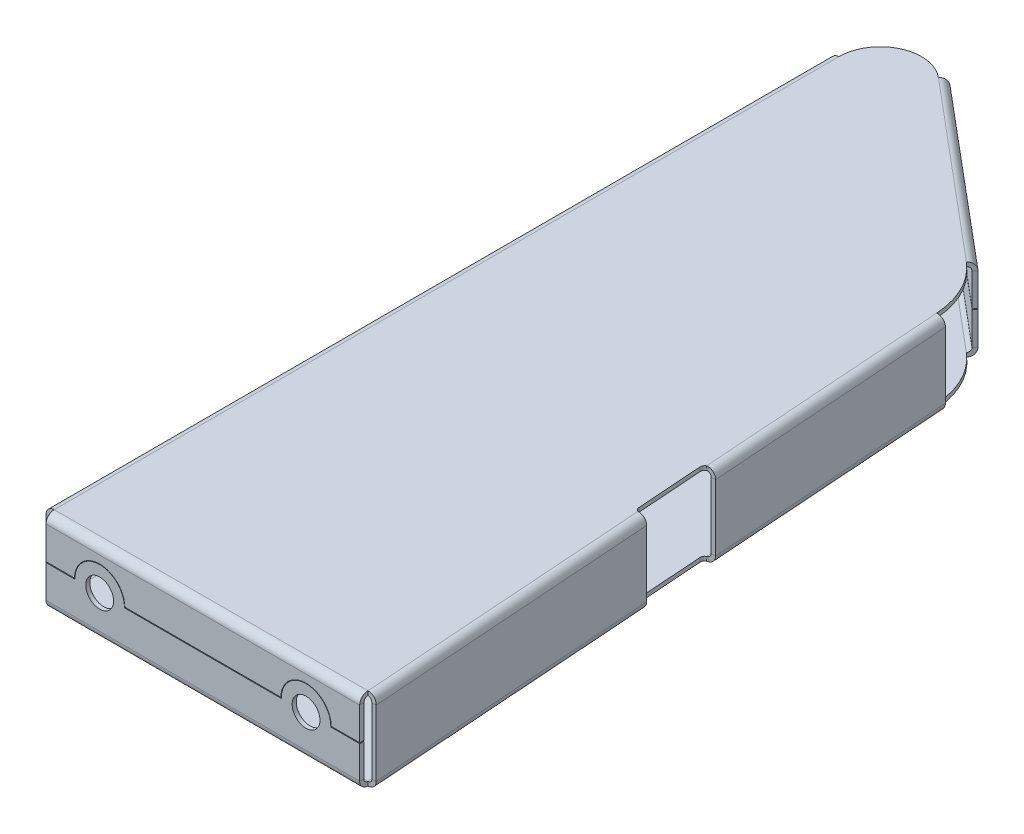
ISO-10303-21;
HEADER;
FILE_DESCRIPTION(('STEP AP214'),'2;1');
FILE_NAME('part.step','',(''),(''),'','','');
FILE_SCHEMA(('AUTOMOTIVE_DESIGN { 1 0 10303 214 1 1 1 1 }'));
ENDSEC;
DATA;
#1=APPLICATION_CONTEXT('core data for automotive mechanical design processes');
#2=APPLICATION_PROTOCOL_DEFINITION('international standard','automotive_design',2000,#1);
#3=PRODUCT_CONTEXT('',#1,'mechanical');
#4=PRODUCT('Part','Part','',(#3));
#5=PRODUCT_RELATED_PRODUCT_CATEGORY('part','',(#4));
#6=PRODUCT_DEFINITION_FORMATION('','',#4);
#7=PRODUCT_DEFINITION_CONTEXT('part definition',#1,'design');
#8=PRODUCT_DEFINITION('design','',#6,#7);
#9=PRODUCT_DEFINITION_SHAPE('','',#8);
#10=(LENGTH_UNIT() NAMED_UNIT(*) SI_UNIT(.MILLI.,.METRE.));
#11=(NAMED_UNIT(*) PLANE_ANGLE_UNIT() SI_UNIT($,.RADIAN.));
#12=(NAMED_UNIT(*) SI_UNIT($,.STERADIAN.) SOLID_ANGLE_UNIT());
#13=UNCERTAINTY_MEASURE_WITH_UNIT(LENGTH_MEASURE(1.E-05),#10,'distance_accuracy_value','');
#14=(GEOMETRIC_REPRESENTATION_CONTEXT(3) GLOBAL_UNCERTAINTY_ASSIGNED_CONTEXT((#13)) GLOBAL_UNIT_ASSIGNED_CONTEXT((#10,
#11,#12)) REPRESENTATION_CONTEXT('',''));
#15=CARTESIAN_POINT('',(0.,0.,0.));
#16=DIRECTION('',(0.,0.,1.));
#17=DIRECTION('',(1.,0.,0.));
#18=AXIS2_PLACEMENT_3D('',#15,#16,#17);
#19=CARTESIAN_POINT('',(2.,-0.100000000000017,2.00000000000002));
#20=DIRECTION('',(0.,1.,0.));
#21=DIRECTION('',(0.,0.,1.));
#22=AXIS2_PLACEMENT_3D('',#19,#20,#21);
#23=PLANE('',#22);
#24=DIRECTION('',(-1.,0.,0.));
#25=VECTOR('',#24,1.);
#26=CARTESIAN_POINT('',(2.,-0.100000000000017,2.00000000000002));
#27=LINE('',#26,#25);
#28=CARTESIAN_POINT('',(20.9991666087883,-0.100000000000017,2.00000000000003));
#29=VERTEX_POINT('',#28);
#30=CARTESIAN_POINT('',(59.0008333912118,-0.100000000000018,1.9999999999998));
#31=VERTEX_POINT('',#30);
#32=EDGE_CURVE('E621',#29,#31,#27,.F.);
#33=ORIENTED_EDGE('',*,*,#32,.T.);
#34=DIRECTION('',(0.,0.,1.));
#35=VECTOR('',#34,1.);
#36=CARTESIAN_POINT('',(59.0008333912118,-0.100000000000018,1.00000000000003));
#37=LINE('',#36,#35);
#38=CARTESIAN_POINT('',(59.0008333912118,-0.100000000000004,0.999999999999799));
#39=VERTEX_POINT('',#38);
#40=EDGE_CURVE('E210',#39,#31,#37,.T.);
#41=ORIENTED_EDGE('',*,*,#40,.F.);
#42=DIRECTION('',(1.,0.,0.));
#43=VECTOR('',#42,1.);
#44=CARTESIAN_POINT('',(0.,-0.100000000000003,1.00000000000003));
#45=LINE('',#44,#43);
#46=CARTESIAN_POINT('',(20.9991666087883,-0.100000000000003,0.999999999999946));
#47=VERTEX_POINT('',#46);
#48=EDGE_CURVE('E1349',#47,#39,#45,.T.);
#49=ORIENTED_EDGE('',*,*,#48,.F.);
#50=DIRECTION('',(0.,0.,1.));
#51=VECTOR('',#50,1.);
#52=CARTESIAN_POINT('',(20.9991666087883,-0.100000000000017,1.00000000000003));
#53=LINE('',#52,#51);
#54=EDGE_CURVE('E648',#47,#29,#53,.T.);
#55=ORIENTED_EDGE('',*,*,#54,.T.);
#56=EDGE_LOOP('',(#33,#41,#49,#55));
#57=FACE_BOUND('',#56,.T.);
#58=ADVANCED_FACE('F187',(#57),#23,.T.);
#59=CARTESIAN_POINT('',(70.9991666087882,-0.100000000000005,0.999999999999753));
#60=VERTEX_POINT('',#59);
#61=CARTESIAN_POINT('',(77.9951162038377,-0.100000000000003,0.999999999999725));
#62=VERTEX_POINT('',#61);
#63=EDGE_CURVE('E202',#60,#62,#45,.T.);
#64=ORIENTED_EDGE('',*,*,#63,.F.);
#65=DIRECTION('',(0.,0.,1.));
#66=VECTOR('',#65,1.);
#67=CARTESIAN_POINT('',(70.9991666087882,-0.100000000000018,1.00000000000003));
#68=LINE('',#67,#66);
#69=CARTESIAN_POINT('',(70.9991666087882,-0.100000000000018,2.00000000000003));
#70=VERTEX_POINT('',#69);
#71=EDGE_CURVE('E626',#60,#70,#68,.T.);
#72=ORIENTED_EDGE('',*,*,#71,.T.);
#73=CARTESIAN_POINT('',(77.9951162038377,-0.100000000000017,1.99999999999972));
#74=VERTEX_POINT('',#73);
#75=EDGE_CURVE('E613',#70,#74,#27,.F.);
#76=ORIENTED_EDGE('',*,*,#75,.T.);
#77=DIRECTION('',(0.,0.,-1.));
#78=VECTOR('',#77,1.);
#79=CARTESIAN_POINT('',(77.9951162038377,-0.100000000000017,1.99999999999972));
#80=LINE('',#79,#78);
#81=EDGE_CURVE('E1355',#74,#62,#80,.T.);
#82=ORIENTED_EDGE('',*,*,#81,.T.);
#83=EDGE_LOOP('',(#64,#72,#76,#82));
#84=FACE_BOUND('',#83,.T.);
#85=ADVANCED_FACE('F627',(#84),#23,.T.);
#86=DIRECTION('',(0.,0.,1.));
#87=VECTOR('',#86,1.);
#88=CARTESIAN_POINT('',(9.00083339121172,-0.100000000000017,1.00000000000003));
#89=LINE('',#88,#87);
#90=CARTESIAN_POINT('',(9.00083339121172,-0.100000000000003,0.999999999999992));
#91=VERTEX_POINT('',#90);
#92=CARTESIAN_POINT('',(9.00083339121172,-0.100000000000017,1.99999999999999));
#93=VERTEX_POINT('',#92);
#94=EDGE_CURVE('E645',#91,#93,#89,.T.);
#95=ORIENTED_EDGE('',*,*,#94,.F.);
#96=CARTESIAN_POINT('',(2.,-0.099999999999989,1.00000000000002));
#97=VERTEX_POINT('',#96);
#98=EDGE_CURVE('E1346',#97,#91,#45,.T.);
#99=ORIENTED_EDGE('',*,*,#98,.F.);
#100=DIRECTION('',(0.,0.,-1.));
#101=VECTOR('',#100,1.);
#102=CARTESIAN_POINT('',(2.,-0.100000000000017,2.00000000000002));
#103=LINE('',#102,#101);
#104=CARTESIAN_POINT('',(2.,-0.100000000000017,2.00000000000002));
#105=VERTEX_POINT('',#104);
#106=EDGE_CURVE('E622',#105,#97,#103,.T.);
#107=ORIENTED_EDGE('',*,*,#106,.F.);
#108=EDGE_CURVE('E624',#105,#93,#27,.F.);
#109=ORIENTED_EDGE('',*,*,#108,.T.);
#110=EDGE_LOOP('',(#95,#99,#107,#109));
#111=FACE_BOUND('',#110,.T.);
#112=ADVANCED_FACE('F1880',(#111),#23,.T.);
#113=CARTESIAN_POINT('',(2.,0.100000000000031,2.00000000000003));
#114=DIRECTION('',(0.,-1.,0.));
#115=DIRECTION('',(0.,0.,-1.));
#116=AXIS2_PLACEMENT_3D('',#113,#114,#115);
#117=PLANE('',#116);
#118=DIRECTION('',(-1.,0.,0.));
#119=VECTOR('',#118,1.);
#120=CARTESIAN_POINT('',(2.,0.100000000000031,2.00000000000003));
#121=LINE('',#120,#119);
#122=CARTESIAN_POINT('',(58.9008197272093,0.100000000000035,1.99999999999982));
#123=VERTEX_POINT('',#122);
#124=CARTESIAN_POINT('',(21.0991802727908,0.100000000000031,1.99999999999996));
#125=VERTEX_POINT('',#124);
#126=EDGE_CURVE('E1778',#123,#125,#121,.T.);
#127=ORIENTED_EDGE('',*,*,#126,.T.);
#128=DIRECTION('',(0.,0.,-1.));
#129=VECTOR('',#128,1.);
#130=CARTESIAN_POINT('',(21.0991802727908,0.100000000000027,0.999999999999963));
#131=LINE('',#130,#129);
#132=CARTESIAN_POINT('',(21.0991802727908,0.100000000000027,0.999999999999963));
#133=VERTEX_POINT('',#132);
#134=EDGE_CURVE('E656',#133,#125,#131,.F.);
#135=ORIENTED_EDGE('',*,*,#134,.F.);
#136=DIRECTION('',(1.,0.,0.));
#137=VECTOR('',#136,1.);
#138=CARTESIAN_POINT('',(0.,0.100000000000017,1.00000000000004));
#139=LINE('',#138,#137);
#140=CARTESIAN_POINT('',(58.9008197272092,0.100000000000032,0.999999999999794));
#141=VERTEX_POINT('',#140);
#142=EDGE_CURVE('E1765',#141,#133,#139,.F.);
#143=ORIENTED_EDGE('',*,*,#142,.F.);
#144=DIRECTION('',(0.,0.,-1.));
#145=VECTOR('',#144,1.);
#146=CARTESIAN_POINT('',(58.9008197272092,0.100000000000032,0.999999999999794));
#147=LINE('',#146,#145);
#148=EDGE_CURVE('E667',#141,#123,#147,.F.);
#149=ORIENTED_EDGE('',*,*,#148,.T.);
#150=EDGE_LOOP('',(#127,#135,#143,#149));
#151=FACE_BOUND('',#150,.T.);
#152=ADVANCED_FACE('F1887',(#151),#117,.T.);
#153=CARTESIAN_POINT('',(8.90081972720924,0.100000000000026,0.999999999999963));
#154=VERTEX_POINT('',#153);
#155=CARTESIAN_POINT('',(1.99999999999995,0.100000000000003,1.00000000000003));
#156=VERTEX_POINT('',#155);
#157=EDGE_CURVE('E1766',#154,#156,#139,.F.);
#158=ORIENTED_EDGE('',*,*,#157,.F.);
#159=DIRECTION('',(0.,0.,-1.));
#160=VECTOR('',#159,1.);
#161=CARTESIAN_POINT('',(8.90081972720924,0.100000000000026,0.999999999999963));
#162=LINE('',#161,#160);
#163=CARTESIAN_POINT('',(8.90081972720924,0.10000000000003,2.00000000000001));
#164=VERTEX_POINT('',#163);
#165=EDGE_CURVE('E659',#154,#164,#162,.F.);
#166=ORIENTED_EDGE('',*,*,#165,.T.);
#167=CARTESIAN_POINT('',(2.,0.100000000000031,2.00000000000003));
#168=VERTEX_POINT('',#167);
#169=EDGE_CURVE('E1779',#164,#168,#121,.T.);
#170=ORIENTED_EDGE('',*,*,#169,.T.);
#171=DIRECTION('',(0.,0.,-1.));
#172=VECTOR('',#171,1.);
#173=CARTESIAN_POINT('',(2.,0.100000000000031,2.00000000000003));
#174=LINE('',#173,#172);
#175=EDGE_CURVE('E1772',#168,#156,#174,.T.);
#176=ORIENTED_EDGE('',*,*,#175,.T.);
#177=EDGE_LOOP('',(#158,#166,#170,#176));
#178=FACE_BOUND('',#177,.T.);
#179=ADVANCED_FACE('F1892',(#178),#117,.T.);
#180=CARTESIAN_POINT('',(0.,0.,1.00000000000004));
#181=DIRECTION('',(0.,0.,1.));
#182=DIRECTION('',(1.,0.,0.));
#183=AXIS2_PLACEMENT_3D('',#180,#181,#182);
#184=PLANE('',#183);
#185=CARTESIAN_POINT('',(15.,0.,0.999999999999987));
#186=DIRECTION('',(0.,0.,1.));
#187=DIRECTION('',(1.,0.,0.));
#188=AXIS2_PLACEMENT_3D('',#185,#186,#187);
#189=CIRCLE('',#188,6.1);
#190=EDGE_CURVE('E651',#133,#154,#189,.T.);
#191=ORIENTED_EDGE('',*,*,#190,.T.);
#192=ORIENTED_EDGE('',*,*,#157,.T.);
#193=DIRECTION('',(0.,-1.,0.));
#194=VECTOR('',#193,1.);
#195=CARTESIAN_POINT('',(1.99999999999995,0.,1.00000000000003));
#196=LINE('',#195,#194);
#197=CARTESIAN_POINT('',(1.99999999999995,8.00000000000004,1.00000000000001));
#198=VERTEX_POINT('',#197);
#199=EDGE_CURVE('E1759',#156,#198,#196,.F.);
#200=ORIENTED_EDGE('',*,*,#199,.T.);
#201=DIRECTION('',(1.,0.,0.));
#202=VECTOR('',#201,1.);
#203=CARTESIAN_POINT('',(77.9951162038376,8.00000000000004,0.999999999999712));
#204=LINE('',#203,#202);
#205=CARTESIAN_POINT('',(77.9951162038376,8.00000000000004,0.999999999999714));
#206=VERTEX_POINT('',#205);
#207=EDGE_CURVE('E1704',#206,#198,#204,.F.);
#208=ORIENTED_EDGE('',*,*,#207,.F.);
#209=DIRECTION('',(0.,1.,0.));
#210=VECTOR('',#209,1.);
#211=CARTESIAN_POINT('',(77.9951162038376,0.,0.999999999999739));
#212=LINE('',#211,#210);
#213=CARTESIAN_POINT('',(77.9951162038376,0.100000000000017,0.999999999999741));
#214=VERTEX_POINT('',#213);
#215=EDGE_CURVE('E1767',#206,#214,#212,.F.);
#216=ORIENTED_EDGE('',*,*,#215,.T.);
#217=CARTESIAN_POINT('',(71.0991802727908,0.100000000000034,0.999999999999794));
#218=VERTEX_POINT('',#217);
#219=EDGE_CURVE('E1762',#214,#218,#139,.F.);
#220=ORIENTED_EDGE('',*,*,#219,.T.);
#221=CARTESIAN_POINT('',(65.,0.,0.999999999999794));
#222=DIRECTION('',(0.,0.,1.));
#223=DIRECTION('',(1.,0.,0.));
#224=AXIS2_PLACEMENT_3D('',#221,#222,#223);
#225=CIRCLE('',#224,6.10000000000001);
#226=EDGE_CURVE('E662',#141,#218,#225,.F.);
#227=ORIENTED_EDGE('',*,*,#226,.F.);
#228=ORIENTED_EDGE('',*,*,#142,.T.);
#229=EDGE_LOOP('',(#191,#192,#200,#208,#216,#220,#227,#228));
#230=FACE_BOUND('',#229,.T.);
#231=ADVANCED_FACE('F2297',(#230),#184,.F.);
#232=CARTESIAN_POINT('',(0.,0.,2.00000000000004));
#233=DIRECTION('',(0.,0.,1.));
#234=DIRECTION('',(1.,0.,0.));
#235=AXIS2_PLACEMENT_3D('',#232,#233,#234);
#236=PLANE('',#235);
#237=ORIENTED_EDGE('',*,*,#169,.F.);
#238=CARTESIAN_POINT('',(15.,0.,1.99999999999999));
#239=DIRECTION('',(0.,0.,1.));
#240=DIRECTION('',(1.,0.,0.));
#241=AXIS2_PLACEMENT_3D('',#238,#239,#240);
#242=CIRCLE('',#241,6.1);
#243=EDGE_CURVE('E654',#125,#164,#242,.T.);
#244=ORIENTED_EDGE('',*,*,#243,.F.);
#245=ORIENTED_EDGE('',*,*,#126,.F.);
#246=CARTESIAN_POINT('',(65.,0.,1.99999999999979));
#247=DIRECTION('',(0.,0.,1.));
#248=DIRECTION('',(1.,0.,0.));
#249=AXIS2_PLACEMENT_3D('',#246,#247,#248);
#250=CIRCLE('',#249,6.10000000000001);
#251=CARTESIAN_POINT('',(71.0991802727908,0.100000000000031,1.99999999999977));
#252=VERTEX_POINT('',#251);
#253=EDGE_CURVE('E664',#123,#252,#250,.F.);
#254=ORIENTED_EDGE('',*,*,#253,.T.);
#255=CARTESIAN_POINT('',(77.9951162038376,0.100000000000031,1.99999999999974));
#256=VERTEX_POINT('',#255);
#257=EDGE_CURVE('E1775',#256,#252,#121,.T.);
#258=ORIENTED_EDGE('',*,*,#257,.F.);
#259=DIRECTION('',(0.,-1.,0.));
#260=VECTOR('',#259,1.);
#261=CARTESIAN_POINT('',(77.9951162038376,0.100000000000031,1.99999999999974));
#262=LINE('',#261,#260);
#263=CARTESIAN_POINT('',(77.9951162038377,8.00000000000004,1.99999999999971));
#264=VERTEX_POINT('',#263);
#265=EDGE_CURVE('E1725',#264,#256,#262,.T.);
#266=ORIENTED_EDGE('',*,*,#265,.F.);
#267=DIRECTION('',(-1.,0.,0.));
#268=VECTOR('',#267,1.);
#269=CARTESIAN_POINT('',(0.,8.00000000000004,2.00000000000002));
#270=LINE('',#269,#268);
#271=CARTESIAN_POINT('',(2.,8.00000000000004,2.00000000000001));
#272=VERTEX_POINT('',#271);
#273=EDGE_CURVE('E1756',#264,#272,#270,.T.);
#274=ORIENTED_EDGE('',*,*,#273,.T.);
#275=DIRECTION('',(0.,1.,0.));
#276=VECTOR('',#275,1.);
#277=CARTESIAN_POINT('',(2.,9.00000000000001,2.));
#278=LINE('',#277,#276);
#279=EDGE_CURVE('E1794',#168,#272,#278,.T.);
#280=ORIENTED_EDGE('',*,*,#279,.F.);
#281=EDGE_LOOP('',(#237,#244,#245,#254,#258,#266,#274,#280));
#282=FACE_BOUND('',#281,.T.);
#283=ADVANCED_FACE('F2292',(#282),#236,.T.);
#284=ORIENTED_EDGE('',*,*,#257,.T.);
#285=DIRECTION('',(0.,0.,-1.));
#286=VECTOR('',#285,1.);
#287=CARTESIAN_POINT('',(71.0991802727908,0.100000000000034,0.999999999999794));
#288=LINE('',#287,#286);
#289=EDGE_CURVE('E669',#218,#252,#288,.F.);
#290=ORIENTED_EDGE('',*,*,#289,.F.);
#291=ORIENTED_EDGE('',*,*,#219,.F.);
#292=DIRECTION('',(0.,0.,-1.));
#293=VECTOR('',#292,1.);
#294=CARTESIAN_POINT('',(77.9951162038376,0.100000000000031,1.99999999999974));
#295=LINE('',#294,#293);
#296=EDGE_CURVE('E1722',#256,#214,#295,.T.);
#297=ORIENTED_EDGE('',*,*,#296,.F.);
#298=EDGE_LOOP('',(#284,#290,#291,#297));
#299=FACE_BOUND('',#298,.T.);
#300=ADVANCED_FACE('F1895',(#299),#117,.T.);
#301=CARTESIAN_POINT('',(80.,10.,-3.08710030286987E-13));
#302=DIRECTION('',(-0.997564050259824,0.,0.0697564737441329));
#303=DIRECTION('',(0.0697564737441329,0.,0.997564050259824));
#304=AXIS2_PLACEMENT_3D('',#301,#302,#303);
#305=PLANE('',#304);
#306=DIRECTION('',(-0.0697564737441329,0.,-0.997564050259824));
#307=VECTOR('',#306,1.);
#308=CARTESIAN_POINT('',(80.,-8.,-3.08710030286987E-13));
#309=LINE('',#308,#307);
#310=CARTESIAN_POINT('',(80.,-8.,-3.08710030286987E-13));
#311=VERTEX_POINT('',#310);
#312=CARTESIAN_POINT('',(75.0735201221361,-8.,-70.4519445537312));
#313=VERTEX_POINT('',#312);
#314=EDGE_CURVE('E1242',#311,#313,#309,.T.);
#315=ORIENTED_EDGE('',*,*,#314,.T.);
#316=DIRECTION('',(0.,-1.,0.));
#317=VECTOR('',#316,1.);
#318=CARTESIAN_POINT('',(75.0735201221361,11.,-70.4519445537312));
#319=LINE('',#318,#317);
#320=CARTESIAN_POINT('',(75.0735201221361,8.,-70.4519445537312));
#321=VERTEX_POINT('',#320);
#322=EDGE_CURVE('E1272',#321,#313,#319,.T.);
#323=ORIENTED_EDGE('',*,*,#322,.F.);
#324=DIRECTION('',(0.0697564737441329,0.,0.997564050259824));
#325=VECTOR('',#324,1.);
#326=CARTESIAN_POINT('',(80.,8.,-3.07512695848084E-13));
#327=LINE('',#326,#325);
#328=CARTESIAN_POINT('',(80.,8.,-2.52863051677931E-13));
#329=VERTEX_POINT('',#328);
#330=EDGE_CURVE('E1419',#321,#329,#327,.T.);
#331=ORIENTED_EDGE('',*,*,#330,.T.);
#332=DIRECTION('',(0.,-1.,0.));
#333=VECTOR('',#332,1.);
#334=CARTESIAN_POINT('',(80.,10.,-3.08710030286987E-13));
#335=LINE('',#334,#333);
#336=EDGE_CURVE('E2233',#329,#311,#335,.T.);
#337=ORIENTED_EDGE('',*,*,#336,.T.);
#338=EDGE_LOOP('',(#315,#323,#331,#337));
#339=FACE_BOUND('',#338,.T.);
#340=ADVANCED_FACE('F2283',(#339),#305,.F.);
#341=CARTESIAN_POINT('',(79.0024359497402,10.,0.0697564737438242));
#342=DIRECTION('',(-0.997564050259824,0.,0.0697564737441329));
#343=DIRECTION('',(0.0697564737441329,0.,0.997564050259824));
#344=AXIS2_PLACEMENT_3D('',#341,#342,#343);
#345=PLANE('',#344);
#346=DIRECTION('',(0.,1.,0.));
#347=VECTOR('',#346,1.);
#348=CARTESIAN_POINT('',(74.0759560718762,10.,-70.3821880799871));
#349=LINE('',#348,#347);
#350=CARTESIAN_POINT('',(74.0759560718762,-8.00000000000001,-70.3821880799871));
#351=VERTEX_POINT('',#350);
#352=CARTESIAN_POINT('',(74.0759560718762,8.00000000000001,-70.3821880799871));
#353=VERTEX_POINT('',#352);
#354=EDGE_CURVE('E2223',#351,#353,#349,.T.);
#355=ORIENTED_EDGE('',*,*,#354,.F.);
#356=DIRECTION('',(-0.0697564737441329,0.,-0.997564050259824));
#357=VECTOR('',#356,1.);
#358=CARTESIAN_POINT('',(79.0024359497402,-8.00000000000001,0.0697564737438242));
#359=LINE('',#358,#357);
#360=CARTESIAN_POINT('',(79.0024359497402,-8.00000000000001,0.0697564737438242));
#361=VERTEX_POINT('',#360);
#362=EDGE_CURVE('E1248',#361,#351,#359,.T.);
#363=ORIENTED_EDGE('',*,*,#362,.F.);
#364=DIRECTION('',(0.,1.,0.));
#365=VECTOR('',#364,1.);
#366=CARTESIAN_POINT('',(79.0024359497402,10.,0.0697564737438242));
#367=LINE('',#366,#365);
#368=CARTESIAN_POINT('',(79.0024359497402,8.,0.0697564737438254));
#369=VERTEX_POINT('',#368);
#370=EDGE_CURVE('E2231',#369,#361,#367,.F.);
#371=ORIENTED_EDGE('',*,*,#370,.F.);
#372=DIRECTION('',(0.0697564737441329,0.,0.997564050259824));
#373=VECTOR('',#372,1.);
#374=CARTESIAN_POINT('',(79.0024359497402,8.00000000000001,0.0697564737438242));
#375=LINE('',#374,#373);
#376=EDGE_CURVE('E1494',#353,#369,#375,.T.);
#377=ORIENTED_EDGE('',*,*,#376,.F.);
#378=EDGE_LOOP('',(#355,#363,#371,#377));
#379=FACE_BOUND('',#378,.T.);
#380=ADVANCED_FACE('F2250',(#379),#345,.T.);
#381=CARTESIAN_POINT('',(80.,10.,-3.08710030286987E-13));
#382=DIRECTION('',(-0.0697564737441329,0.,-0.997564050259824));
#383=DIRECTION('',(0.,-1.,0.));
#384=AXIS2_PLACEMENT_3D('',#381,#382,#383);
#385=PLANE('',#384);
#386=CARTESIAN_POINT('',(79.0024359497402,8.,0.0697564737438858));
#387=CARTESIAN_POINT('',(80.,8.,-2.52863051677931E-13));
#388=B_SPLINE_CURVE_WITH_KNOTS('',1,(#386,#387),.UNSPECIFIED.,.F.,.F.,(2,2),(0.,1.),.UNSPECIFIED.);
#389=EDGE_CURVE('E1808',#369,#329,#388,.T.);
#390=ORIENTED_EDGE('',*,*,#389,.F.);
#391=ORIENTED_EDGE('',*,*,#370,.T.);
#392=CARTESIAN_POINT('',(80.,-8.,-2.8758462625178E-13));
#393=CARTESIAN_POINT('',(79.0024359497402,-8.,0.0697564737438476));
#394=B_SPLINE_CURVE_WITH_KNOTS('',1,(#392,#393),.UNSPECIFIED.,.F.,.F.,(2,2),(0.,1.),.UNSPECIFIED.);
#395=EDGE_CURVE('E1244',#361,#311,#394,.F.);
#396=ORIENTED_EDGE('',*,*,#395,.T.);
#397=ORIENTED_EDGE('',*,*,#336,.F.);
#398=EDGE_LOOP('',(#390,#391,#396,#397));
#399=FACE_BOUND('',#398,.T.);
#400=ADVANCED_FACE('F2253',(#399),#385,.F.);
#401=DIRECTION('',(0.0697564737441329,0.,0.997564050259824));
#402=VECTOR('',#401,1.);
#403=CARTESIAN_POINT('',(80.,8.,-3.07512695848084E-13));
#404=LINE('',#403,#402);
#405=CARTESIAN_POINT('',(69.6325151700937,8.,-148.261940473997));
#406=VERTEX_POINT('',#405);
#407=CARTESIAN_POINT('',(73.8179035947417,8.,-88.4080974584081));
#408=VERTEX_POINT('',#407);
#409=EDGE_CURVE('E1805',#406,#408,#404,.T.);
#410=ORIENTED_EDGE('',*,*,#409,.T.);
#411=DIRECTION('',(0.,1.,0.));
#412=VECTOR('',#411,1.);
#413=CARTESIAN_POINT('',(73.8179035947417,11.,-88.4080974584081));
#414=LINE('',#413,#412);
#415=CARTESIAN_POINT('',(73.8179035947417,-8.,-88.4080974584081));
#416=VERTEX_POINT('',#415);
#417=EDGE_CURVE('E1268',#416,#408,#414,.T.);
#418=ORIENTED_EDGE('',*,*,#417,.F.);
#419=DIRECTION('',(-0.0697564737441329,0.,-0.997564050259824));
#420=VECTOR('',#419,1.);
#421=CARTESIAN_POINT('',(80.,-8.,-3.08710030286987E-13));
#422=LINE('',#421,#420);
#423=CARTESIAN_POINT('',(69.6325151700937,-8.,-148.261940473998));
#424=VERTEX_POINT('',#423);
#425=EDGE_CURVE('E1256',#416,#424,#422,.T.);
#426=ORIENTED_EDGE('',*,*,#425,.T.);
#427=DIRECTION('',(0.,-1.,0.));
#428=VECTOR('',#427,1.);
#429=CARTESIAN_POINT('',(69.6325151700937,10.3561944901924,-148.261940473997));
#430=LINE('',#429,#428);
#431=EDGE_CURVE('E2222',#406,#424,#430,.T.);
#432=ORIENTED_EDGE('',*,*,#431,.F.);
#433=EDGE_LOOP('',(#410,#418,#426,#432));
#434=FACE_BOUND('',#433,.T.);
#435=ADVANCED_FACE('F2225',(#434),#305,.F.);
#436=DIRECTION('',(0.,-1.,0.));
#437=VECTOR('',#436,1.);
#438=CARTESIAN_POINT('',(72.8203395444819,10.,-88.338340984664));
#439=LINE('',#438,#437);
#440=CARTESIAN_POINT('',(72.8203395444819,8.00000000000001,-88.3383409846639));
#441=VERTEX_POINT('',#440);
#442=CARTESIAN_POINT('',(72.8203395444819,-8.00000000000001,-88.338340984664));
#443=VERTEX_POINT('',#442);
#444=EDGE_CURVE('E1271',#441,#443,#439,.T.);
#445=ORIENTED_EDGE('',*,*,#444,.F.);
#446=DIRECTION('',(0.0697564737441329,0.,0.997564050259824));
#447=VECTOR('',#446,1.);
#448=CARTESIAN_POINT('',(79.0024359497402,8.00000000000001,0.0697564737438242));
#449=LINE('',#448,#447);
#450=CARTESIAN_POINT('',(68.6349511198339,8.00000000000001,-148.192184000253));
#451=VERTEX_POINT('',#450);
#452=EDGE_CURVE('E1810',#451,#441,#449,.T.);
#453=ORIENTED_EDGE('',*,*,#452,.F.);
#454=DIRECTION('',(0.,1.,0.));
#455=VECTOR('',#454,1.);
#456=CARTESIAN_POINT('',(68.6349511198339,10.,-148.192184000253));
#457=LINE('',#456,#455);
#458=CARTESIAN_POINT('',(68.6349511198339,-8.00000000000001,-148.192184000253));
#459=VERTEX_POINT('',#458);
#460=EDGE_CURVE('E2220',#459,#451,#457,.T.);
#461=ORIENTED_EDGE('',*,*,#460,.F.);
#462=DIRECTION('',(-0.0697564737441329,0.,-0.997564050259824));
#463=VECTOR('',#462,1.);
#464=CARTESIAN_POINT('',(79.0024359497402,-8.00000000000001,0.0697564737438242));
#465=LINE('',#464,#463);
#466=EDGE_CURVE('E1262',#443,#459,#465,.T.);
#467=ORIENTED_EDGE('',*,*,#466,.F.);
#468=EDGE_LOOP('',(#445,#453,#461,#467));
#469=FACE_BOUND('',#468,.T.);
#470=ADVANCED_FACE('F2230',(#469),#345,.T.);
#471=CARTESIAN_POINT('',(51.5018621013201,10.3561944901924,-146.994121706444));
#472=DIRECTION('',(0.069756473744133,0.,0.997564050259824));
#473=DIRECTION('',(0.997564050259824,0.,-0.069756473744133));
#474=AXIS2_PLACEMENT_3D('',#471,#472,#473);
#475=PLANE('',#474);
#476=DIRECTION('',(0.997564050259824,0.,-0.069756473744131));
#477=VECTOR('',#476,1.);
#478=CARTESIAN_POINT('',(68.6349511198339,-8.00000000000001,-148.192184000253));
#479=LINE('',#478,#477);
#480=EDGE_CURVE('E1265',#459,#424,#479,.T.);
#481=ORIENTED_EDGE('',*,*,#480,.F.);
#482=ORIENTED_EDGE('',*,*,#460,.T.);
#483=DIRECTION('',(-0.997564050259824,0.,0.069756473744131));
#484=VECTOR('',#483,1.);
#485=CARTESIAN_POINT('',(69.6325151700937,8.,-148.261940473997));
#486=LINE('',#485,#484);
#487=EDGE_CURVE('E1807',#406,#451,#486,.T.);
#488=ORIENTED_EDGE('',*,*,#487,.F.);
#489=ORIENTED_EDGE('',*,*,#431,.T.);
#490=EDGE_LOOP('',(#481,#482,#488,#489));
#491=FACE_BOUND('',#490,.T.);
#492=ADVANCED_FACE('F2218',(#491),#475,.F.);
#493=CARTESIAN_POINT('',(59.7158083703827,11.,-69.3780287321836));
#494=DIRECTION('',(0.069756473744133,0.,0.997564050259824));
#495=DIRECTION('',(0.997564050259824,0.,-0.069756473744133));
#496=AXIS2_PLACEMENT_3D('',#493,#494,#495);
#497=PLANE('',#496);
#498=DIRECTION('',(0.997564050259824,0.,-0.06975647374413));
#499=VECTOR('',#498,1.);
#500=CARTESIAN_POINT('',(74.0759560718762,-8.00000000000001,-70.3821880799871));
#501=LINE('',#500,#499);
#502=EDGE_CURVE('E1251',#351,#313,#501,.T.);
#503=ORIENTED_EDGE('',*,*,#502,.F.);
#504=ORIENTED_EDGE('',*,*,#354,.T.);
#505=DIRECTION('',(-0.997564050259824,0.,0.069756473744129));
#506=VECTOR('',#505,1.);
#507=CARTESIAN_POINT('',(75.0735201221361,8.,-70.4519445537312));
#508=LINE('',#507,#506);
#509=EDGE_CURVE('E2242',#321,#353,#508,.T.);
#510=ORIENTED_EDGE('',*,*,#509,.F.);
#511=ORIENTED_EDGE('',*,*,#322,.T.);
#512=EDGE_LOOP('',(#503,#504,#510,#511));
#513=FACE_BOUND('',#512,.T.);
#514=ADVANCED_FACE('F189',(#513),#497,.F.);
#515=CARTESIAN_POINT('',(58.4601918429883,11.,-87.3341816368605));
#516=DIRECTION('',(-0.069756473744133,0.,-0.997564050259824));
#517=DIRECTION('',(-0.997564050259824,0.,0.069756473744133));
#518=AXIS2_PLACEMENT_3D('',#515,#516,#517);
#519=PLANE('',#518);
#520=DIRECTION('',(-0.997564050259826,0.,0.0697564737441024));
#521=VECTOR('',#520,1.);
#522=CARTESIAN_POINT('',(73.8179035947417,-8.,-88.4080974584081));
#523=LINE('',#522,#521);
#524=EDGE_CURVE('E1259',#416,#443,#523,.T.);
#525=ORIENTED_EDGE('',*,*,#524,.F.);
#526=ORIENTED_EDGE('',*,*,#417,.T.);
#527=DIRECTION('',(0.997564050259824,0.,-0.069756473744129));
#528=VECTOR('',#527,1.);
#529=CARTESIAN_POINT('',(72.8203395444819,8.00000000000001,-88.3383409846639));
#530=LINE('',#529,#528);
#531=EDGE_CURVE('E1245',#441,#408,#530,.T.);
#532=ORIENTED_EDGE('',*,*,#531,.F.);
#533=ORIENTED_EDGE('',*,*,#444,.T.);
#534=EDGE_LOOP('',(#525,#526,#532,#533));
#535=FACE_BOUND('',#534,.T.);
#536=ADVANCED_FACE('F2272',(#535),#519,.F.);
#537=CARTESIAN_POINT('',(73.0783920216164,8.,-70.312431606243));
#538=DIRECTION('',(-0.069756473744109,0.,-0.997564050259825));
#539=DIRECTION('',(-0.997564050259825,0.,0.069756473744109));
#540=AXIS2_PLACEMENT_3D('',#537,#538,#539);
#541=PLANE('',#540);
#542=ORIENTED_EDGE('',*,*,#509,.T.);
#543=CARTESIAN_POINT('',(73.0783920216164,8.,-70.312431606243));
#544=DIRECTION('',(0.0697564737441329,0.,0.997564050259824));
#545=DIRECTION('',(0.997564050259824,0.,-0.0697564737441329));
#546=AXIS2_PLACEMENT_3D('',#543,#544,#545);
#547=CIRCLE('',#546,1.);
#548=CARTESIAN_POINT('',(73.3130565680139,8.97193790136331,-70.3288409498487));
#549=VERTEX_POINT('',#548);
#550=EDGE_CURVE('E1408',#353,#549,#547,.T.);
#551=ORIENTED_EDGE('',*,*,#550,.T.);
#552=CARTESIAN_POINT('',(73.5477211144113,9.94387580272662,-70.3452502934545));
#553=CARTESIAN_POINT('',(73.3130565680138,8.97193790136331,-70.3288409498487));
#554=B_SPLINE_CURVE_WITH_KNOTS('',1,(#552,#553),.UNSPECIFIED.,.F.,.F.,(2,2),(0.,1.),.UNSPECIFIED.);
#555=CARTESIAN_POINT('',(73.5477211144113,9.94387580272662,-70.3452502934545));
#556=VERTEX_POINT('',#555);
#557=EDGE_CURVE('E1275',#549,#556,#554,.F.);
#558=ORIENTED_EDGE('',*,*,#557,.T.);
#559=CARTESIAN_POINT('',(73.0783920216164,8.,-70.312431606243));
#560=DIRECTION('',(0.069756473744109,0.,0.997564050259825));
#561=DIRECTION('',(-0.997564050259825,0.,0.069756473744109));
#562=AXIS2_PLACEMENT_3D('',#559,#560,#561);
#563=CIRCLE('',#562,2.);
#564=EDGE_CURVE('E1392',#321,#556,#563,.T.);
#565=ORIENTED_EDGE('',*,*,#564,.F.);
#566=EDGE_LOOP('',(#542,#551,#558,#565));
#567=FACE_BOUND('',#566,.T.);
#568=ADVANCED_FACE('F1406',(#567),#541,.T.);
#569=CARTESIAN_POINT('',(73.5477211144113,9.94387580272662,-70.3452502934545));
#570=CARTESIAN_POINT('',(73.3926909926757,9.98111923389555,-70.3563275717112));
#571=CARTESIAN_POINT('',(73.2332789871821,10.,-70.3670926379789));
#572=CARTESIAN_POINT('',(73.0738168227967,10.,-70.3778599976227));
#573=CARTESIAN_POINT('',(73.3130565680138,8.97193790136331,-70.3288409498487));
#574=CARTESIAN_POINT('',(73.2347792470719,8.99055953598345,-70.3452852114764));
#575=CARTESIAN_POINT('',(73.1543101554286,9.,-70.3615706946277));
#576=CARTESIAN_POINT('',(73.0738168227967,9.,-70.3778599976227));
#577=B_SPLINE_SURFACE_WITH_KNOTS('',1,3,((#569,#570,#571,#572),(#573,#574,#575,#576)),
.UNSPECIFIED.,.F.,.F.,.F.,(2,2),(4,4),(0.,1.),(0.,1.),.UNSPECIFIED.);
#578=CARTESIAN_POINT('',(73.3130565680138,8.97193790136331,-70.3288409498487));
#579=CARTESIAN_POINT('',(73.2347792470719,8.99055953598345,-70.3452852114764));
#580=CARTESIAN_POINT('',(73.1543101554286,9.,-70.3615706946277));
#581=CARTESIAN_POINT('',(73.0738168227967,9.,-70.3778599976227));
#582=B_SPLINE_CURVE_WITH_KNOTS('',3,(#578,#579,#580,#581),.UNSPECIFIED.,.F.,.F.,(4,4),(0.,1.),.UNSPECIFIED.);
#583=CARTESIAN_POINT('',(73.0738168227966,9.00000000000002,-70.3778599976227));
#584=VERTEX_POINT('',#583);
#585=EDGE_CURVE('E1495',#549,#584,#582,.T.);
#586=CARTESIAN_POINT('',(73.0738168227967,9.,-70.3778599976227));
#587=CARTESIAN_POINT('',(73.0738168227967,10.,-70.3778599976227));
#588=B_SPLINE_CURVE_WITH_KNOTS('',1,(#586,#587),.UNSPECIFIED.,.F.,.F.,(2,2),(0.,1.),.UNSPECIFIED.);
#589=CARTESIAN_POINT('',(73.0738168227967,10.,-70.3778599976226));
#590=VERTEX_POINT('',#589);
#591=EDGE_CURVE('E1226',#584,#590,#588,.T.);
#592=CARTESIAN_POINT('',(73.0738168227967,10.,-70.3778599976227));
#593=CARTESIAN_POINT('',(73.2332789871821,10.,-70.3670926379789));
#594=CARTESIAN_POINT('',(73.3926909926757,9.98111923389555,-70.3563275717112));
#595=CARTESIAN_POINT('',(73.5477211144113,9.94387580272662,-70.3452502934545));
#596=B_SPLINE_CURVE_WITH_KNOTS('',3,(#592,#593,#594,#595),.UNSPECIFIED.,.F.,.F.,(4,4),(0.,1.),.UNSPECIFIED.);
#597=EDGE_CURVE('E1387',#556,#590,#596,.F.);
#598=ORIENTED_EDGE('',*,*,#557,.F.);
#599=ORIENTED_EDGE('',*,*,#585,.T.);
#600=ORIENTED_EDGE('',*,*,#591,.T.);
#601=ORIENTED_EDGE('',*,*,#597,.F.);
#602=EDGE_LOOP('',(#598,#599,#600,#601));
#603=FACE_BOUND('',#602,.T.);
#604=ADVANCED_FACE('F1423',(#603),#577,.T.);
#605=CARTESIAN_POINT('',(77.9951162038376,10.,-2.62416409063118E-13));
#606=CARTESIAN_POINT('',(78.2571379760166,10.,-0.00663731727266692));
#607=CARTESIAN_POINT('',(78.5189627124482,9.94794535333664,-0.0132650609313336));
#608=CARTESIAN_POINT('',(79.0031524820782,9.74757277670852,-0.0237570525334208));
#609=CARTESIAN_POINT('',(79.2252805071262,9.59933368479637,-0.0276068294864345));
#610=CARTESIAN_POINT('',(79.5962448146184,9.22909343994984,-0.0301813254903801));
#611=CARTESIAN_POINT('',(79.74493577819,9.0072379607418,-0.0288958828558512));
#612=CARTESIAN_POINT('',(79.9464462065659,8.52349576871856,-0.0196210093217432));
#613=CARTESIAN_POINT('',(79.9991868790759,8.26184649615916,-0.0116281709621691));
#614=CARTESIAN_POINT('',(80.,8.,-2.52863051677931E-13));
#615=CARTESIAN_POINT('',(77.9951162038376,9.,-2.55477515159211E-13));
#616=CARTESIAN_POINT('',(78.1265335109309,9.,0.00249542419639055));
#617=CARTESIAN_POINT('',(78.2578524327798,8.97397267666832,0.0049935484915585));
#618=CARTESIAN_POINT('',(78.5007602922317,8.87378638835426,0.0113736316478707));
#619=CARTESIAN_POINT('',(78.6122307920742,8.79966684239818,0.0152617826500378));
#620=CARTESIAN_POINT('',(78.7985259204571,8.61454671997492,0.0256006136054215));
#621=CARTESIAN_POINT('',(78.8732778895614,8.5036189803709,0.0320563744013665));
#622=CARTESIAN_POINT('',(78.9748460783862,8.26174788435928,0.0483198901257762));
#623=CARTESIAN_POINT('',(79.0016228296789,8.13092310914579,0.0581283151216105));
#624=CARTESIAN_POINT('',(79.0024359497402,8.,0.0697564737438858));
#625=B_SPLINE_SURFACE_WITH_KNOTS('',1,3,((#605,#606,#607,#608,#609,#610,#611,#612,#613,#614),
(#615,#616,#617,#618,#619,#620,#621,#622,#623,#624)),.UNSPECIFIED.,.F.,.F.,.F.,(2,2),(4,2,2,2,
4),(0.,1.),(0.,0.25,0.5,0.75,1.),.UNSPECIFIED.);
#626=CARTESIAN_POINT('',(77.9951162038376,10.,-2.62416409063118E-13));
#627=CARTESIAN_POINT('',(77.9951162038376,9.,-2.55477515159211E-13));
#628=B_SPLINE_CURVE_WITH_KNOTS('',1,(#626,#627),.UNSPECIFIED.,.F.,.F.,(2,2),(0.,1.),.UNSPECIFIED.);
#629=CARTESIAN_POINT('',(77.9951162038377,9.00000000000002,-2.91433543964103E-13));
#630=VERTEX_POINT('',#629);
#631=CARTESIAN_POINT('',(77.9951162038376,10.,-2.76635287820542E-13));
#632=VERTEX_POINT('',#631);
#633=EDGE_CURVE('E1139',#630,#632,#628,.F.);
#634=CARTESIAN_POINT('',(77.9951162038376,9.,-2.55477515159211E-13));
#635=CARTESIAN_POINT('',(78.1265335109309,9.,0.00249542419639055));
#636=CARTESIAN_POINT('',(78.2578524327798,8.97397267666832,0.0049935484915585));
#637=CARTESIAN_POINT('',(78.5007602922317,8.87378638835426,0.0113736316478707));
#638=CARTESIAN_POINT('',(78.6122307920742,8.79966684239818,0.0152617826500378));
#639=CARTESIAN_POINT('',(78.7985259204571,8.61454671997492,0.0256006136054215));
#640=CARTESIAN_POINT('',(78.8732778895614,8.5036189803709,0.0320563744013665));
#641=CARTESIAN_POINT('',(78.9748460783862,8.26174788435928,0.0483198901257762));
#642=CARTESIAN_POINT('',(79.0016228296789,8.13092310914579,0.0581283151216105));
#643=CARTESIAN_POINT('',(79.0024359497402,8.,0.0697564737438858));
#644=B_SPLINE_CURVE_WITH_KNOTS('',3,(#634,#635,#636,#637,#638,#639,#640,#641,#642,#643),
.UNSPECIFIED.,.F.,.F.,(4,2,2,2,4),(0.,0.25,0.5,0.75,1.),.UNSPECIFIED.);
#645=EDGE_CURVE('E1420',#630,#369,#644,.T.);
#646=CARTESIAN_POINT('',(80.,8.,-2.52863051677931E-13));
#647=CARTESIAN_POINT('',(79.9991868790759,8.26184649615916,-0.0116281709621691));
#648=CARTESIAN_POINT('',(79.9464462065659,8.52349576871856,-0.0196210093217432));
#649=CARTESIAN_POINT('',(79.74493577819,9.0072379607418,-0.0288958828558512));
#650=CARTESIAN_POINT('',(79.5962448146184,9.22909343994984,-0.0301813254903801));
#651=CARTESIAN_POINT('',(79.2252805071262,9.59933368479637,-0.0276068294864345));
#652=CARTESIAN_POINT('',(79.0031524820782,9.74757277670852,-0.0237570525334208));
#653=CARTESIAN_POINT('',(78.5189627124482,9.94794535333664,-0.0132650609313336));
#654=CARTESIAN_POINT('',(78.2571379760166,10.,-0.00663731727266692));
#655=CARTESIAN_POINT('',(77.9951162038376,10.,-2.62416409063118E-13));
#656=B_SPLINE_CURVE_WITH_KNOTS('',3,(#646,#647,#648,#649,#650,#651,#652,#653,#654,#655),
.UNSPECIFIED.,.F.,.F.,(4,2,2,2,4),(0.,0.25,0.5,0.75,1.),.UNSPECIFIED.);
#657=EDGE_CURVE('E1391',#632,#329,#656,.F.);
#658=ORIENTED_EDGE('',*,*,#633,.F.);
#659=ORIENTED_EDGE('',*,*,#645,.T.);
#660=ORIENTED_EDGE('',*,*,#389,.T.);
#661=ORIENTED_EDGE('',*,*,#657,.F.);
#662=EDGE_LOOP('',(#658,#659,#660,#661));
#663=FACE_BOUND('',#662,.T.);
#664=ADVANCED_FACE('F1445',(#663),#625,.T.);
#665=CARTESIAN_POINT('',(70.5976530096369,8.,-105.788652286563));
#666=DIRECTION('',(0.0697564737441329,0.,0.997564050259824));
#667=DIRECTION('',(0.997564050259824,0.,-0.0697564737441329));
#668=AXIS2_PLACEMENT_3D('',#665,#666,#667);
#669=CYLINDRICAL_SURFACE('',#668,2.);
#670=ORIENTED_EDGE('',*,*,#657,.T.);
#671=ORIENTED_EDGE('',*,*,#330,.F.);
#672=ORIENTED_EDGE('',*,*,#564,.T.);
#673=ORIENTED_EDGE('',*,*,#597,.T.);
#674=DIRECTION('',(-0.069756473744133,0.,-0.997564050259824));
#675=VECTOR('',#674,1.);
#676=CARTESIAN_POINT('',(67.1513735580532,10.,-155.072744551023));
#677=LINE('',#676,#675);
#678=EDGE_CURVE('E1217',#632,#590,#677,.T.);
#679=ORIENTED_EDGE('',*,*,#678,.F.);
#680=EDGE_LOOP('',(#670,#671,#672,#673,#679));
#681=FACE_BOUND('',#680,.T.);
#682=ADVANCED_FACE('F1416',(#681),#669,.T.);
#683=CARTESIAN_POINT('',(70.5976530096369,8.,-105.788652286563));
#684=DIRECTION('',(0.0697564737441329,0.,0.997564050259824));
#685=DIRECTION('',(0.997564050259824,0.,-0.0697564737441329));
#686=AXIS2_PLACEMENT_3D('',#683,#684,#685);
#687=CYLINDRICAL_SURFACE('',#686,1.);
#688=ORIENTED_EDGE('',*,*,#645,.F.);
#689=DIRECTION('',(-0.069756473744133,0.,-0.997564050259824));
#690=VECTOR('',#689,1.);
#691=CARTESIAN_POINT('',(77.6155946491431,9.00000000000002,-5.42741109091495));
#692=LINE('',#691,#690);
#693=EDGE_CURVE('E1492',#630,#584,#692,.T.);
#694=ORIENTED_EDGE('',*,*,#693,.T.);
#695=ORIENTED_EDGE('',*,*,#585,.F.);
#696=ORIENTED_EDGE('',*,*,#550,.F.);
#697=ORIENTED_EDGE('',*,*,#376,.T.);
#698=EDGE_LOOP('',(#688,#694,#695,#696,#697));
#699=FACE_BOUND('',#698,.T.);
#700=ADVANCED_FACE('F1490',(#699),#687,.F.);
#701=CARTESIAN_POINT('',(71.822775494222,8.,-88.2685845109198));
#702=DIRECTION('',(0.0697564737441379,0.,0.997564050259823));
#703=DIRECTION('',(0.997564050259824,0.,-0.0697564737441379));
#704=AXIS2_PLACEMENT_3D('',#701,#702,#703);
#705=PLANE('',#704);
#706=CARTESIAN_POINT('',(72.0574400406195,8.97193790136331,-88.2849938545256));
#707=CARTESIAN_POINT('',(72.2921045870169,9.94387580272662,-88.3014031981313));
#708=B_SPLINE_CURVE_WITH_KNOTS('',1,(#706,#707),.UNSPECIFIED.,.F.,.F.,(2,2),(0.,1.),.UNSPECIFIED.);
#709=CARTESIAN_POINT('',(72.0574400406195,8.97193790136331,-88.2849938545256));
#710=VERTEX_POINT('',#709);
#711=CARTESIAN_POINT('',(72.2921045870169,9.94387580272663,-88.3014031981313));
#712=VERTEX_POINT('',#711);
#713=EDGE_CURVE('E1385',#710,#712,#708,.T.);
#714=ORIENTED_EDGE('',*,*,#713,.F.);
#715=CARTESIAN_POINT('',(71.8227754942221,8.,-88.2685845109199));
#716=DIRECTION('',(0.0697564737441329,0.,0.997564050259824));
#717=DIRECTION('',(0.997564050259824,0.,-0.0697564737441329));
#718=AXIS2_PLACEMENT_3D('',#715,#716,#717);
#719=CIRCLE('',#718,1.);
#720=EDGE_CURVE('E1622',#710,#441,#719,.F.);
#721=ORIENTED_EDGE('',*,*,#720,.T.);
#722=ORIENTED_EDGE('',*,*,#531,.T.);
#723=CARTESIAN_POINT('',(71.822775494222,8.,-88.2685845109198));
#724=DIRECTION('',(-0.0697564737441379,0.,-0.997564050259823));
#725=DIRECTION('',(0.997564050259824,0.,-0.0697564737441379));
#726=AXIS2_PLACEMENT_3D('',#723,#724,#725);
#727=CIRCLE('',#726,2.00000000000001);
#728=EDGE_CURVE('E1542',#712,#408,#727,.T.);
#729=ORIENTED_EDGE('',*,*,#728,.F.);
#730=EDGE_LOOP('',(#714,#721,#722,#729));
#731=FACE_BOUND('',#730,.T.);
#732=ADVANCED_FACE('F1509',(#731),#705,.T.);
#733=CARTESIAN_POINT('',(67.637387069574,8.,-148.122427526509));
#734=DIRECTION('',(-0.0697564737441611,0.,-0.997564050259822));
#735=DIRECTION('',(-0.997564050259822,0.,0.0697564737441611));
#736=AXIS2_PLACEMENT_3D('',#733,#734,#735);
#737=PLANE('',#736);
#738=ORIENTED_EDGE('',*,*,#487,.T.);
#739=CARTESIAN_POINT('',(67.637387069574,8.,-148.122427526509));
#740=DIRECTION('',(0.0697564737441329,0.,0.997564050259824));
#741=DIRECTION('',(0.997564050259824,0.,-0.0697564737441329));
#742=AXIS2_PLACEMENT_3D('',#739,#740,#741);
#743=CIRCLE('',#742,1.);
#744=CARTESIAN_POINT('',(67.637387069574,9.00000000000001,-148.122427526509));
#745=VERTEX_POINT('',#744);
#746=EDGE_CURVE('E1619',#451,#745,#743,.T.);
#747=ORIENTED_EDGE('',*,*,#746,.T.);
#748=DIRECTION('',(0.,1.,0.));
#749=VECTOR('',#748,1.);
#750=CARTESIAN_POINT('',(67.637387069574,-8.17492627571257,-148.122427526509));
#751=LINE('',#750,#749);
#752=CARTESIAN_POINT('',(67.637387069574,10.,-148.122427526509));
#753=VERTEX_POINT('',#752);
#754=EDGE_CURVE('E1610',#745,#753,#751,.T.);
#755=ORIENTED_EDGE('',*,*,#754,.T.);
#756=CARTESIAN_POINT('',(67.637387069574,8.,-148.122427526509));
#757=DIRECTION('',(0.0697564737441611,0.,0.997564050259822));
#758=DIRECTION('',(-0.997564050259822,0.,0.0697564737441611));
#759=AXIS2_PLACEMENT_3D('',#756,#757,#758);
#760=CIRCLE('',#759,2.);
#761=EDGE_CURVE('E1386',#406,#753,#760,.T.);
#762=ORIENTED_EDGE('',*,*,#761,.F.);
#763=EDGE_LOOP('',(#738,#747,#755,#762));
#764=FACE_BOUND('',#763,.T.);
#765=ADVANCED_FACE('F1574',(#764),#737,.T.);
#766=CARTESIAN_POINT('',(71.8273506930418,10.,-88.2031561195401));
#767=CARTESIAN_POINT('',(71.9837624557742,10.,-88.2360115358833));
#768=CARTESIAN_POINT('',(72.1401248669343,9.98111923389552,-88.268857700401));
#769=CARTESIAN_POINT('',(72.2921045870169,9.94387580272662,-88.3014031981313));
#770=CARTESIAN_POINT('',(71.8273506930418,9.,-88.2031561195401));
#771=CARTESIAN_POINT('',(71.9047936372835,9.,-88.2304894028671));
#772=CARTESIAN_POINT('',(71.9822131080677,8.99055953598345,-88.2578155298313));
#773=CARTESIAN_POINT('',(72.0574400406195,8.97193790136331,-88.2849938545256));
#774=B_SPLINE_SURFACE_WITH_KNOTS('',1,3,((#766,#767,#768,#769),(#770,#771,#772,#773)),
.UNSPECIFIED.,.F.,.F.,.F.,(2,2),(4,4),(0.,1.),(0.,1.),.UNSPECIFIED.);
#775=CARTESIAN_POINT('',(71.8273506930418,9.,-88.2031561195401));
#776=CARTESIAN_POINT('',(71.9047936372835,9.,-88.2304894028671));
#777=CARTESIAN_POINT('',(71.9822131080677,8.99055953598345,-88.2578155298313));
#778=CARTESIAN_POINT('',(72.0574400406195,8.97193790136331,-88.2849938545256));
#779=B_SPLINE_CURVE_WITH_KNOTS('',3,(#775,#776,#777,#778),.UNSPECIFIED.,.F.,.F.,(4,4),(0.,1.),.UNSPECIFIED.);
#780=CARTESIAN_POINT('',(71.8273506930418,9.00000000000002,-88.2031561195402));
#781=VERTEX_POINT('',#780);
#782=EDGE_CURVE('E1532',#781,#710,#779,.T.);
#783=CARTESIAN_POINT('',(72.2921045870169,9.94387580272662,-88.3014031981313));
#784=CARTESIAN_POINT('',(72.1401248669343,9.98111923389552,-88.268857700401));
#785=CARTESIAN_POINT('',(71.9837624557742,10.,-88.2360115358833));
#786=CARTESIAN_POINT('',(71.8273506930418,10.,-88.2031561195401));
#787=B_SPLINE_CURVE_WITH_KNOTS('',3,(#783,#784,#785,#786),.UNSPECIFIED.,.F.,.F.,(4,4),(0.,1.),.UNSPECIFIED.);
#788=CARTESIAN_POINT('',(71.8273506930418,10.,-88.2031561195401));
#789=VERTEX_POINT('',#788);
#790=EDGE_CURVE('E1381',#789,#712,#787,.F.);
#791=CARTESIAN_POINT('',(71.8273506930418,10.,-88.2031561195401));
#792=CARTESIAN_POINT('',(71.8273506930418,9.,-88.2031561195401));
#793=B_SPLINE_CURVE_WITH_KNOTS('',1,(#791,#792),.UNSPECIFIED.,.F.,.F.,(2,2),(0.,1.),.UNSPECIFIED.);
#794=EDGE_CURVE('E1593',#789,#781,#793,.T.);
#795=ORIENTED_EDGE('',*,*,#782,.T.);
#796=ORIENTED_EDGE('',*,*,#713,.T.);
#797=ORIENTED_EDGE('',*,*,#790,.F.);
#798=ORIENTED_EDGE('',*,*,#794,.T.);
#799=EDGE_LOOP('',(#795,#796,#797,#798));
#800=FACE_BOUND('',#799,.T.);
#801=ADVANCED_FACE('F1528',(#800),#774,.T.);
#802=CARTESIAN_POINT('',(65.5266268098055,8.,-178.307705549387));
#803=DIRECTION('',(0.0697564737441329,0.,0.997564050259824));
#804=DIRECTION('',(0.997564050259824,0.,-0.0697564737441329));
#805=AXIS2_PLACEMENT_3D('',#802,#803,#804);
#806=CYLINDRICAL_SURFACE('',#805,2.);
#807=DIRECTION('',(-0.069756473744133,0.,-0.997564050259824));
#808=VECTOR('',#807,1.);
#809=CARTESIAN_POINT('',(67.1513735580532,10.,-155.072744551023));
#810=LINE('',#809,#808);
#811=EDGE_CURVE('E1551',#789,#753,#810,.T.);
#812=ORIENTED_EDGE('',*,*,#811,.F.);
#813=ORIENTED_EDGE('',*,*,#790,.T.);
#814=ORIENTED_EDGE('',*,*,#728,.T.);
#815=ORIENTED_EDGE('',*,*,#409,.F.);
#816=ORIENTED_EDGE('',*,*,#761,.T.);
#817=EDGE_LOOP('',(#812,#813,#814,#815,#816));
#818=FACE_BOUND('',#817,.T.);
#819=ADVANCED_FACE('F1549',(#818),#806,.T.);
#820=CARTESIAN_POINT('',(65.5266268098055,8.,-178.307705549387));
#821=DIRECTION('',(0.0697564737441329,0.,0.997564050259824));
#822=DIRECTION('',(0.997564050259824,0.,-0.0697564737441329));
#823=AXIS2_PLACEMENT_3D('',#820,#821,#822);
#824=CYLINDRICAL_SURFACE('',#823,1.);
#825=DIRECTION('',(-0.069756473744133,0.,-0.997564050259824));
#826=VECTOR('',#825,1.);
#827=CARTESIAN_POINT('',(77.6155946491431,9.00000000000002,-5.42741109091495));
#828=LINE('',#827,#826);
#829=EDGE_CURVE('E1609',#781,#745,#828,.T.);
#830=ORIENTED_EDGE('',*,*,#829,.T.);
#831=ORIENTED_EDGE('',*,*,#746,.F.);
#832=ORIENTED_EDGE('',*,*,#452,.T.);
#833=ORIENTED_EDGE('',*,*,#720,.F.);
#834=ORIENTED_EDGE('',*,*,#782,.F.);
#835=EDGE_LOOP('',(#830,#831,#832,#833,#834));
#836=FACE_BOUND('',#835,.T.);
#837=ADVANCED_FACE('F1564',(#836),#824,.F.);
#838=CARTESIAN_POINT('',(2.,9.00000000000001,2.));
#839=DIRECTION('',(-1.,0.,0.));
#840=DIRECTION('',(0.,0.,1.));
#841=AXIS2_PLACEMENT_3D('',#838,#839,#840);
#842=PLANE('',#841);
#843=ORIENTED_EDGE('',*,*,#279,.T.);
#844=DIRECTION('',(0.,0.,1.));
#845=VECTOR('',#844,1.);
#846=CARTESIAN_POINT('',(1.99999999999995,8.00000000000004,1.00000000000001));
#847=LINE('',#846,#845);
#848=EDGE_CURVE('E1753',#198,#272,#847,.T.);
#849=ORIENTED_EDGE('',*,*,#848,.F.);
#850=ORIENTED_EDGE('',*,*,#199,.F.);
#851=ORIENTED_EDGE('',*,*,#175,.F.);
#852=EDGE_LOOP('',(#843,#849,#850,#851));
#853=FACE_BOUND('',#852,.T.);
#854=ADVANCED_FACE('F1089',(#853),#842,.T.);
#855=CARTESIAN_POINT('',(0.,9.99999999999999,0.));
#856=DIRECTION('',(0.,0.,1.));
#857=DIRECTION('',(0.,-1.,0.));
#858=AXIS2_PLACEMENT_3D('',#855,#856,#857);
#859=PLANE('',#858);
#860=DIRECTION('',(-1.,0.,0.));
#861=VECTOR('',#860,1.);
#862=CARTESIAN_POINT('',(0.,0.249999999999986,0.));
#863=LINE('',#862,#861);
#864=CARTESIAN_POINT('',(0.999999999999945,0.25,0.));
#865=VERTEX_POINT('',#864);
#866=CARTESIAN_POINT('',(0.,0.249999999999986,0.));
#867=VERTEX_POINT('',#866);
#868=EDGE_CURVE('E1782',#865,#867,#863,.T.);
#869=ORIENTED_EDGE('',*,*,#868,.F.);
#870=DIRECTION('',(0.,1.,0.));
#871=VECTOR('',#870,1.);
#872=CARTESIAN_POINT('',(0.999999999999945,10.,0.));
#873=LINE('',#872,#871);
#874=CARTESIAN_POINT('',(0.999999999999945,8.00000000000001,0.));
#875=VERTEX_POINT('',#874);
#876=EDGE_CURVE('E1769',#875,#865,#873,.F.);
#877=ORIENTED_EDGE('',*,*,#876,.F.);
#878=DIRECTION('',(-1.,0.,0.));
#879=VECTOR('',#878,1.);
#880=CARTESIAN_POINT('',(0.,7.99999999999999,0.));
#881=LINE('',#880,#879);
#882=CARTESIAN_POINT('',(0.,7.99999999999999,0.));
#883=VERTEX_POINT('',#882);
#884=EDGE_CURVE('E1793',#875,#883,#881,.T.);
#885=ORIENTED_EDGE('',*,*,#884,.T.);
#886=DIRECTION('',(0.,-1.,0.));
#887=VECTOR('',#886,1.);
#888=CARTESIAN_POINT('',(0.,9.99999999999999,0.));
#889=LINE('',#888,#887);
#890=EDGE_CURVE('E1790',#883,#867,#889,.T.);
#891=ORIENTED_EDGE('',*,*,#890,.T.);
#892=EDGE_LOOP('',(#869,#877,#885,#891));
#893=FACE_BOUND('',#892,.T.);
#894=ADVANCED_FACE('F1853',(#893),#859,.T.);
#895=CARTESIAN_POINT('',(0.,0.249999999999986,2.00000000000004));
#896=DIRECTION('',(0.,-1.,0.));
#897=DIRECTION('',(0.,0.,-1.));
#898=AXIS2_PLACEMENT_3D('',#895,#896,#897);
#899=PLANE('',#898);
#900=DIRECTION('',(0.,0.,-1.));
#901=VECTOR('',#900,1.);
#902=CARTESIAN_POINT('',(0.,0.249999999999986,2.00000000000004));
#903=LINE('',#902,#901);
#904=CARTESIAN_POINT('',(0.,0.25,-190.063942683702));
#905=VERTEX_POINT('',#904);
#906=EDGE_CURVE('E1739',#905,#867,#903,.F.);
#907=ORIENTED_EDGE('',*,*,#906,.F.);
#908=DIRECTION('',(-1.,0.,0.));
#909=VECTOR('',#908,1.);
#910=CARTESIAN_POINT('',(0.,0.250000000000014,-190.063942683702));
#911=LINE('',#910,#909);
#912=CARTESIAN_POINT('',(0.999999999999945,0.249999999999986,-190.063942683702));
#913=VERTEX_POINT('',#912);
#914=EDGE_CURVE('E1787',#905,#913,#911,.F.);
#915=ORIENTED_EDGE('',*,*,#914,.T.);
#916=DIRECTION('',(0.,0.,-1.));
#917=VECTOR('',#916,1.);
#918=CARTESIAN_POINT('',(0.999999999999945,0.249999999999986,-215.));
#919=LINE('',#918,#917);
#920=EDGE_CURVE('E1785',#913,#865,#919,.F.);
#921=ORIENTED_EDGE('',*,*,#920,.T.);
#922=ORIENTED_EDGE('',*,*,#868,.T.);
#923=EDGE_LOOP('',(#907,#915,#921,#922));
#924=FACE_BOUND('',#923,.T.);
#925=ADVANCED_FACE('F1870',(#924),#899,.T.);
#926=CARTESIAN_POINT('',(0.,0.250000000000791,-190.063942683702));
#927=DIRECTION('',(0.,0.,1.));
#928=DIRECTION('',(0.,-1.,0.));
#929=AXIS2_PLACEMENT_3D('',#926,#927,#928);
#930=PLANE('',#929);
#931=DIRECTION('',(0.,1.,0.));
#932=VECTOR('',#931,1.);
#933=CARTESIAN_POINT('',(0.,0.250000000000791,-190.063942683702));
#934=LINE('',#933,#932);
#935=CARTESIAN_POINT('',(0.,7.99999999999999,-190.063942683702));
#936=VERTEX_POINT('',#935);
#937=EDGE_CURVE('E1741',#936,#905,#934,.F.);
#938=ORIENTED_EDGE('',*,*,#937,.F.);
#939=DIRECTION('',(-1.,0.,0.));
#940=VECTOR('',#939,1.);
#941=CARTESIAN_POINT('',(0.999999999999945,8.00000000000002,-190.063942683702));
#942=LINE('',#941,#940);
#943=CARTESIAN_POINT('',(0.999999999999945,8.00000000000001,-190.063942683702));
#944=VERTEX_POINT('',#943);
#945=EDGE_CURVE('E1730',#944,#936,#942,.T.);
#946=ORIENTED_EDGE('',*,*,#945,.F.);
#947=DIRECTION('',(0.,1.,0.));
#948=VECTOR('',#947,1.);
#949=CARTESIAN_POINT('',(0.999999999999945,0.250000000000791,-190.063942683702));
#950=LINE('',#949,#948);
#951=EDGE_CURVE('E1780',#944,#913,#950,.F.);
#952=ORIENTED_EDGE('',*,*,#951,.T.);
#953=ORIENTED_EDGE('',*,*,#914,.F.);
#954=EDGE_LOOP('',(#938,#946,#952,#953));
#955=FACE_BOUND('',#954,.T.);
#956=ADVANCED_FACE('F1865',(#955),#930,.F.);
#957=CARTESIAN_POINT('',(0.999999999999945,9.99999999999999,-215.));
#958=DIRECTION('',(1.,0.,0.));
#959=DIRECTION('',(0.,0.,-1.));
#960=AXIS2_PLACEMENT_3D('',#957,#958,#959);
#961=PLANE('',#960);
#962=ORIENTED_EDGE('',*,*,#920,.F.);
#963=ORIENTED_EDGE('',*,*,#951,.F.);
#964=DIRECTION('',(0.,0.,-1.));
#965=VECTOR('',#964,1.);
#966=CARTESIAN_POINT('',(0.999999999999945,8.00000000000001,-215.));
#967=LINE('',#966,#965);
#968=EDGE_CURVE('E1719',#875,#944,#967,.T.);
#969=ORIENTED_EDGE('',*,*,#968,.F.);
#970=ORIENTED_EDGE('',*,*,#876,.T.);
#971=EDGE_LOOP('',(#962,#963,#969,#970));
#972=FACE_BOUND('',#971,.T.);
#973=ADVANCED_FACE('F1868',(#972),#961,.T.);
#974=CARTESIAN_POINT('',(1.99999999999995,8.00000000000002,0.));
#975=DIRECTION('',(1.,0.,0.));
#976=DIRECTION('',(0.,0.,-1.));
#977=AXIS2_PLACEMENT_3D('',#974,#975,#976);
#978=PLANE('',#977);
#979=CARTESIAN_POINT('',(1.99999999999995,8.00000000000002,0.));
#980=DIRECTION('',(-1.,0.,0.));
#981=DIRECTION('',(0.,0.,1.));
#982=AXIS2_PLACEMENT_3D('',#979,#980,#981);
#983=CIRCLE('',#982,1.);
#984=CARTESIAN_POINT('',(1.99999999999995,9.00000000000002,0.));
#985=VERTEX_POINT('',#984);
#986=EDGE_CURVE('E1487',#198,#985,#983,.T.);
#987=ORIENTED_EDGE('',*,*,#986,.F.);
#988=ORIENTED_EDGE('',*,*,#848,.T.);
#989=CARTESIAN_POINT('',(1.99999999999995,8.00000000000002,0.));
#990=DIRECTION('',(-1.,0.,0.));
#991=DIRECTION('',(0.,0.,1.));
#992=AXIS2_PLACEMENT_3D('',#989,#990,#991);
#993=CIRCLE('',#992,2.);
#994=CARTESIAN_POINT('',(1.99999999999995,10.,0.));
#995=VERTEX_POINT('',#994);
#996=EDGE_CURVE('E1750',#272,#995,#993,.T.);
#997=ORIENTED_EDGE('',*,*,#996,.T.);
#998=DIRECTION('',(0.,1.,0.));
#999=VECTOR('',#998,1.);
#1000=CARTESIAN_POINT('',(1.99999999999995,10.,0.));
#1001=LINE('',#1000,#999);
#1002=EDGE_CURVE('E1744',#985,#995,#1001,.T.);
#1003=ORIENTED_EDGE('',*,*,#1002,.F.);
#1004=EDGE_LOOP('',(#987,#988,#997,#1003));
#1005=FACE_BOUND('',#1004,.T.);
#1006=ADVANCED_FACE('F1841',(#1005),#978,.F.);
#1007=CARTESIAN_POINT('',(1.99999999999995,8.00000000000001,0.));
#1008=DIRECTION('',(0.,0.,1.));
#1009=DIRECTION('',(0.999988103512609,-0.00487778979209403,0.));
#1010=AXIS2_PLACEMENT_3D('',#1007,#1008,#1009);
#1011=PLANE('',#1010);
#1012=CARTESIAN_POINT('',(2.,8.00000000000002,0.));
#1013=DIRECTION('',(0.,0.,1.));
#1014=DIRECTION('',(0.999988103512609,-0.0048777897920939,0.));
#1015=AXIS2_PLACEMENT_3D('',#1012,#1013,#1014);
#1016=CIRCLE('',#1015,1.);
#1017=EDGE_CURVE('E1747',#875,#985,#1016,.F.);
#1018=ORIENTED_EDGE('',*,*,#1017,.T.);
#1019=ORIENTED_EDGE('',*,*,#1002,.T.);
#1020=CARTESIAN_POINT('',(1.99999999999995,8.00000000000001,0.));
#1021=DIRECTION('',(0.,0.,-1.));
#1022=DIRECTION('',(-0.999988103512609,0.00487778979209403,0.));
#1023=AXIS2_PLACEMENT_3D('',#1020,#1021,#1022);
#1024=CIRCLE('',#1023,2.);
#1025=EDGE_CURVE('E1696',#883,#995,#1024,.T.);
#1026=ORIENTED_EDGE('',*,*,#1025,.F.);
#1027=ORIENTED_EDGE('',*,*,#884,.F.);
#1028=EDGE_LOOP('',(#1018,#1019,#1026,#1027));
#1029=FACE_BOUND('',#1028,.T.);
#1030=ADVANCED_FACE('F1849',(#1029),#1011,.T.);
#1031=CARTESIAN_POINT('',(0.,10.,-215.));
#1032=DIRECTION('',(1.,0.,0.));
#1033=DIRECTION('',(0.,0.,-1.));
#1034=AXIS2_PLACEMENT_3D('',#1031,#1032,#1033);
#1035=PLANE('',#1034);
#1036=ORIENTED_EDGE('',*,*,#937,.T.);
#1037=ORIENTED_EDGE('',*,*,#906,.T.);
#1038=ORIENTED_EDGE('',*,*,#890,.F.);
#1039=DIRECTION('',(0.,0.,-1.));
#1040=VECTOR('',#1039,1.);
#1041=CARTESIAN_POINT('',(0.,7.99999999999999,-212.263942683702));
#1042=LINE('',#1041,#1040);
#1043=EDGE_CURVE('E1736',#883,#936,#1042,.T.);
#1044=ORIENTED_EDGE('',*,*,#1043,.T.);
#1045=EDGE_LOOP('',(#1036,#1037,#1038,#1044));
#1046=FACE_BOUND('',#1045,.T.);
#1047=ADVANCED_FACE('F1857',(#1046),#1035,.F.);
#1048=CARTESIAN_POINT('',(2.,8.00000000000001,-190.063942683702));
#1049=DIRECTION('',(0.,0.,-1.));
#1050=DIRECTION('',(-0.999988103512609,0.0048777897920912,0.));
#1051=AXIS2_PLACEMENT_3D('',#1048,#1049,#1050);
#1052=PLANE('',#1051);
#1053=DIRECTION('',(0.,1.,0.));
#1054=VECTOR('',#1053,1.);
#1055=CARTESIAN_POINT('',(2.,9.00000000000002,-190.063942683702));
#1056=LINE('',#1055,#1054);
#1057=CARTESIAN_POINT('',(2.,9.00000000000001,-190.063942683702));
#1058=VERTEX_POINT('',#1057);
#1059=CARTESIAN_POINT('',(2.,10.,-190.063942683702));
#1060=VERTEX_POINT('',#1059);
#1061=EDGE_CURVE('E1684',#1058,#1060,#1056,.T.);
#1062=ORIENTED_EDGE('',*,*,#1061,.F.);
#1063=CARTESIAN_POINT('',(2.,8.00000000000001,-190.063942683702));
#1064=DIRECTION('',(0.,0.,1.));
#1065=DIRECTION('',(0.999988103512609,-0.0048777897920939,0.));
#1066=AXIS2_PLACEMENT_3D('',#1063,#1064,#1065);
#1067=CIRCLE('',#1066,1.);
#1068=EDGE_CURVE('E1733',#1058,#944,#1067,.T.);
#1069=ORIENTED_EDGE('',*,*,#1068,.T.);
#1070=ORIENTED_EDGE('',*,*,#945,.T.);
#1071=CARTESIAN_POINT('',(2.,8.00000000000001,-190.063942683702));
#1072=DIRECTION('',(0.,0.,1.));
#1073=DIRECTION('',(0.999988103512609,-0.0048777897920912,0.));
#1074=AXIS2_PLACEMENT_3D('',#1071,#1072,#1073);
#1075=CIRCLE('',#1074,1.99999999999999);
#1076=EDGE_CURVE('E1693',#1060,#936,#1075,.T.);
#1077=ORIENTED_EDGE('',*,*,#1076,.F.);
#1078=EDGE_LOOP('',(#1062,#1069,#1070,#1077));
#1079=FACE_BOUND('',#1078,.T.);
#1080=ADVANCED_FACE('F1862',(#1079),#1052,.T.);
#1081=CARTESIAN_POINT('',(77.9951162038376,0.100000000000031,1.99999999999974));
#1082=DIRECTION('',(1.,0.,0.));
#1083=DIRECTION('',(0.,0.,-1.));
#1084=AXIS2_PLACEMENT_3D('',#1081,#1082,#1083);
#1085=PLANE('',#1084);
#1086=ORIENTED_EDGE('',*,*,#215,.F.);
#1087=DIRECTION('',(0.,0.,1.));
#1088=VECTOR('',#1087,1.);
#1089=CARTESIAN_POINT('',(77.9951162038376,8.00000000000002,1.99999999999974));
#1090=LINE('',#1089,#1088);
#1091=EDGE_CURVE('E1727',#206,#264,#1090,.T.);
#1092=ORIENTED_EDGE('',*,*,#1091,.T.);
#1093=ORIENTED_EDGE('',*,*,#265,.T.);
#1094=ORIENTED_EDGE('',*,*,#296,.T.);
#1095=EDGE_LOOP('',(#1086,#1092,#1093,#1094));
#1096=FACE_BOUND('',#1095,.T.);
#1097=ADVANCED_FACE('F2320',(#1096),#1085,.T.);
#1098=CARTESIAN_POINT('',(2.,8.00000000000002,-285.579407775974));
#1099=DIRECTION('',(0.,0.,1.));
#1100=DIRECTION('',(0.999988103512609,-0.0048777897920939,0.));
#1101=AXIS2_PLACEMENT_3D('',#1098,#1099,#1100);
#1102=CYLINDRICAL_SURFACE('',#1101,1.);
#1103=ORIENTED_EDGE('',*,*,#968,.T.);
#1104=ORIENTED_EDGE('',*,*,#1068,.F.);
#1105=DIRECTION('',(0.,0.,1.));
#1106=VECTOR('',#1105,1.);
#1107=CARTESIAN_POINT('',(2.,9.00000000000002,0.));
#1108=LINE('',#1107,#1106);
#1109=EDGE_CURVE('E1714',#1058,#985,#1108,.T.);
#1110=ORIENTED_EDGE('',*,*,#1109,.T.);
#1111=ORIENTED_EDGE('',*,*,#1017,.F.);
#1112=EDGE_LOOP('',(#1103,#1104,#1110,#1111));
#1113=FACE_BOUND('',#1112,.T.);
#1114=ADVANCED_FACE('F1847',(#1113),#1102,.F.);
#1115=CARTESIAN_POINT('',(1.99999999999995,8.00000000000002,0.));
#1116=DIRECTION('',(-1.,0.,0.));
#1117=DIRECTION('',(0.,0.,1.));
#1118=AXIS2_PLACEMENT_3D('',#1115,#1116,#1117);
#1119=CYLINDRICAL_SURFACE('',#1118,1.);
#1120=DIRECTION('',(1.,0.,0.));
#1121=VECTOR('',#1120,1.);
#1122=CARTESIAN_POINT('',(0.,9.00000000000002,0.));
#1123=LINE('',#1122,#1121);
#1124=EDGE_CURVE('E1709',#985,#630,#1123,.T.);
#1125=ORIENTED_EDGE('',*,*,#1124,.T.);
#1126=CARTESIAN_POINT('',(77.9951162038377,8.00000000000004,-2.8796409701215E-13));
#1127=DIRECTION('',(-1.,0.,0.));
#1128=DIRECTION('',(0.,0.,1.));
#1129=AXIS2_PLACEMENT_3D('',#1126,#1127,#1128);
#1130=CIRCLE('',#1129,1.);
#1131=EDGE_CURVE('E1706',#630,#206,#1130,.F.);
#1132=ORIENTED_EDGE('',*,*,#1131,.T.);
#1133=ORIENTED_EDGE('',*,*,#207,.T.);
#1134=ORIENTED_EDGE('',*,*,#986,.T.);
#1135=EDGE_LOOP('',(#1125,#1132,#1133,#1134));
#1136=FACE_BOUND('',#1135,.T.);
#1137=ADVANCED_FACE('F1158',(#1136),#1119,.F.);
#1138=CARTESIAN_POINT('',(77.9951162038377,8.00000000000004,-2.8796409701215E-13));
#1139=DIRECTION('',(1.,0.,0.));
#1140=DIRECTION('',(0.,0.,-1.));
#1141=AXIS2_PLACEMENT_3D('',#1138,#1139,#1140);
#1142=PLANE('',#1141);
#1143=ORIENTED_EDGE('',*,*,#1091,.F.);
#1144=ORIENTED_EDGE('',*,*,#1131,.F.);
#1145=ORIENTED_EDGE('',*,*,#633,.T.);
#1146=CARTESIAN_POINT('',(77.9951162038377,8.00000000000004,-2.8796409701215E-13));
#1147=DIRECTION('',(-1.,0.,0.));
#1148=DIRECTION('',(0.,0.,1.));
#1149=AXIS2_PLACEMENT_3D('',#1146,#1147,#1148);
#1150=CIRCLE('',#1149,2.);
#1151=EDGE_CURVE('E1486',#632,#264,#1150,.F.);
#1152=ORIENTED_EDGE('',*,*,#1151,.T.);
#1153=EDGE_LOOP('',(#1143,#1144,#1145,#1152));
#1154=FACE_BOUND('',#1153,.T.);
#1155=ADVANCED_FACE('F1147',(#1154),#1142,.T.);
#1156=CARTESIAN_POINT('',(1.99999999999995,8.00000000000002,0.));
#1157=DIRECTION('',(-1.,0.,0.));
#1158=DIRECTION('',(0.,0.,1.));
#1159=AXIS2_PLACEMENT_3D('',#1156,#1157,#1158);
#1160=CYLINDRICAL_SURFACE('',#1159,2.);
#1161=DIRECTION('',(1.,0.,0.));
#1162=VECTOR('',#1161,1.);
#1163=CARTESIAN_POINT('',(0.,10.,0.));
#1164=LINE('',#1163,#1162);
#1165=EDGE_CURVE('E1646',#995,#632,#1164,.T.);
#1166=ORIENTED_EDGE('',*,*,#1165,.F.);
#1167=ORIENTED_EDGE('',*,*,#996,.F.);
#1168=ORIENTED_EDGE('',*,*,#273,.F.);
#1169=ORIENTED_EDGE('',*,*,#1151,.F.);
#1170=EDGE_LOOP('',(#1166,#1167,#1168,#1169));
#1171=FACE_BOUND('',#1170,.T.);
#1172=ADVANCED_FACE('F1157',(#1171),#1160,.T.);
#1173=CARTESIAN_POINT('',(2.,8.00000000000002,-285.579407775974));
#1174=DIRECTION('',(0.,0.,1.));
#1175=DIRECTION('',(0.999988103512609,-0.0048777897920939,0.));
#1176=AXIS2_PLACEMENT_3D('',#1173,#1174,#1175);
#1177=CYLINDRICAL_SURFACE('',#1176,2.);
#1178=ORIENTED_EDGE('',*,*,#1043,.F.);
#1179=ORIENTED_EDGE('',*,*,#1025,.T.);
#1180=DIRECTION('',(0.,0.,1.));
#1181=VECTOR('',#1180,1.);
#1182=CARTESIAN_POINT('',(1.99999999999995,10.,0.));
#1183=LINE('',#1182,#1181);
#1184=EDGE_CURVE('E1649',#1060,#995,#1183,.T.);
#1185=ORIENTED_EDGE('',*,*,#1184,.F.);
#1186=ORIENTED_EDGE('',*,*,#1076,.T.);
#1187=EDGE_LOOP('',(#1178,#1179,#1185,#1186));
#1188=FACE_BOUND('',#1187,.T.);
#1189=ADVANCED_FACE('F1162',(#1188),#1177,.T.);
#1190=CARTESIAN_POINT('',(2.,9.00000000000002,0.));
#1191=DIRECTION('',(-1.,0.,0.));
#1192=DIRECTION('',(0.,0.,1.));
#1193=AXIS2_PLACEMENT_3D('',#1190,#1191,#1192);
#1194=PLANE('',#1193);
#1195=DIRECTION('',(0.,0.,1.));
#1196=VECTOR('',#1195,1.);
#1197=CARTESIAN_POINT('',(1.99999999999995,10.,0.));
#1198=LINE('',#1197,#1196);
#1199=CARTESIAN_POINT('',(2.,10.,-190.109793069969));
#1200=VERTEX_POINT('',#1199);
#1201=EDGE_CURVE('E1654',#1200,#1060,#1198,.T.);
#1202=ORIENTED_EDGE('',*,*,#1201,.F.);
#1203=DIRECTION('',(0.,1.,0.));
#1204=VECTOR('',#1203,1.);
#1205=CARTESIAN_POINT('',(2.,9.00000000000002,-190.109793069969));
#1206=LINE('',#1205,#1204);
#1207=CARTESIAN_POINT('',(2.,9.00000000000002,-190.109793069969));
#1208=VERTEX_POINT('',#1207);
#1209=EDGE_CURVE('E1691',#1200,#1208,#1206,.F.);
#1210=ORIENTED_EDGE('',*,*,#1209,.T.);
#1211=DIRECTION('',(0.,0.,1.));
#1212=VECTOR('',#1211,1.);
#1213=CARTESIAN_POINT('',(2.,9.00000000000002,0.));
#1214=LINE('',#1213,#1212);
#1215=EDGE_CURVE('E1689',#1208,#1058,#1214,.T.);
#1216=ORIENTED_EDGE('',*,*,#1215,.T.);
#1217=ORIENTED_EDGE('',*,*,#1061,.T.);
#1218=EDGE_LOOP('',(#1202,#1210,#1216,#1217));
#1219=FACE_BOUND('',#1218,.T.);
#1220=ADVANCED_FACE('F1166',(#1219),#1194,.T.);
#1221=CARTESIAN_POINT('',(12.,10.,-190.109793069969));
#1222=DIRECTION('',(0.,1.,0.));
#1223=DIRECTION('',(-0.0697564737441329,0.,-0.997564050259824));
#1224=AXIS2_PLACEMENT_3D('',#1221,#1222,#1223);
#1225=CYLINDRICAL_SURFACE('',#1224,10.);
#1226=CARTESIAN_POINT('',(12.,9.00000000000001,-190.109793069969));
#1227=DIRECTION('',(0.,1.,0.));
#1228=DIRECTION('',(-0.0697564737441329,0.,-0.997564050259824));
#1229=AXIS2_PLACEMENT_3D('',#1226,#1227,#1228);
#1230=CIRCLE('',#1229,10.);
#1231=CARTESIAN_POINT('',(18.4278760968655,9.00000000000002,-197.770237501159));
#1232=VERTEX_POINT('',#1231);
#1233=EDGE_CURVE('E1238',#1208,#1232,#1230,.F.);
#1234=ORIENTED_EDGE('',*,*,#1233,.F.);
#1235=ORIENTED_EDGE('',*,*,#1209,.F.);
#1236=CARTESIAN_POINT('',(12.,10.,-190.109793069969));
#1237=DIRECTION('',(0.,1.,0.));
#1238=DIRECTION('',(-0.0697564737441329,0.,-0.997564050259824));
#1239=AXIS2_PLACEMENT_3D('',#1236,#1237,#1238);
#1240=CIRCLE('',#1239,10.);
#1241=CARTESIAN_POINT('',(18.4278760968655,10.,-197.770237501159));
#1242=VERTEX_POINT('',#1241);
#1243=EDGE_CURVE('E1656',#1242,#1200,#1240,.T.);
#1244=ORIENTED_EDGE('',*,*,#1243,.F.);
#1245=DIRECTION('',(0.,1.,0.));
#1246=VECTOR('',#1245,1.);
#1247=CARTESIAN_POINT('',(18.4278760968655,10.,-197.770237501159));
#1248=LINE('',#1247,#1246);
#1249=EDGE_CURVE('E1679',#1232,#1242,#1248,.T.);
#1250=ORIENTED_EDGE('',*,*,#1249,.F.);
#1251=EDGE_LOOP('',(#1234,#1235,#1244,#1250));
#1252=FACE_BOUND('',#1251,.T.);
#1253=ADVANCED_FACE('F1170',(#1252),#1225,.T.);
#1254=CARTESIAN_POINT('',(47.6575637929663,10.,-147.135471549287));
#1255=DIRECTION('',(0.,1.,0.));
#1256=DIRECTION('',(-0.0697564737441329,0.,-0.997564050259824));
#1257=AXIS2_PLACEMENT_3D('',#1254,#1255,#1256);
#1258=CYLINDRICAL_SURFACE('',#1257,20.);
#1259=DIRECTION('',(0.,-1.,0.));
#1260=VECTOR('',#1259,1.);
#1261=CARTESIAN_POINT('',(60.5133159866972,10.,-162.456360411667));
#1262=LINE('',#1261,#1260);
#1263=CARTESIAN_POINT('',(60.5133159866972,10.,-162.456360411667));
#1264=VERTEX_POINT('',#1263);
#1265=CARTESIAN_POINT('',(60.5133159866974,9.00000000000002,-162.456360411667));
#1266=VERTEX_POINT('',#1265);
#1267=EDGE_CURVE('E1677',#1264,#1266,#1262,.T.);
#1268=ORIENTED_EDGE('',*,*,#1267,.F.);
#1269=CARTESIAN_POINT('',(47.6575637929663,10.,-147.135471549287));
#1270=DIRECTION('',(0.,1.,0.));
#1271=DIRECTION('',(-0.0697564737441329,0.,-0.997564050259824));
#1272=AXIS2_PLACEMENT_3D('',#1269,#1270,#1271);
#1273=CIRCLE('',#1272,20.);
#1274=CARTESIAN_POINT('',(67.6088447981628,10.,-148.53060102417));
#1275=VERTEX_POINT('',#1274);
#1276=EDGE_CURVE('E1661',#1275,#1264,#1273,.T.);
#1277=ORIENTED_EDGE('',*,*,#1276,.F.);
#1278=DIRECTION('',(0.,-1.,0.));
#1279=VECTOR('',#1278,1.);
#1280=CARTESIAN_POINT('',(67.6088447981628,10.,-148.53060102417));
#1281=LINE('',#1280,#1279);
#1282=CARTESIAN_POINT('',(67.6088447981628,9.00000000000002,-148.53060102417));
#1283=VERTEX_POINT('',#1282);
#1284=EDGE_CURVE('E1640',#1283,#1275,#1281,.F.);
#1285=ORIENTED_EDGE('',*,*,#1284,.F.);
#1286=CARTESIAN_POINT('',(47.6575637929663,9.00000000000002,-147.135471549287));
#1287=DIRECTION('',(0.,1.,0.));
#1288=DIRECTION('',(-0.0697564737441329,0.,-0.997564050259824));
#1289=AXIS2_PLACEMENT_3D('',#1286,#1287,#1288);
#1290=CIRCLE('',#1289,20.);
#1291=EDGE_CURVE('E1145',#1266,#1283,#1290,.F.);
#1292=ORIENTED_EDGE('',*,*,#1291,.F.);
#1293=EDGE_LOOP('',(#1268,#1277,#1285,#1292));
#1294=FACE_BOUND('',#1293,.T.);
#1295=ADVANCED_FACE('F1174',(#1294),#1258,.T.);
#1296=CARTESIAN_POINT('',(72.4361547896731,-5.39521371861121,-70.2675220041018));
#1297=DIRECTION('',(-0.997564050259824,0.,0.0697564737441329));
#1298=DIRECTION('',(0.0695865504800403,-0.0697564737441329,0.995134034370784));
#1299=AXIS2_PLACEMENT_3D('',#1296,#1297,#1298);
#1300=PLANE('',#1299);
#1301=DIRECTION('',(0.0697564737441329,0.,0.997564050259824));
#1302=VECTOR('',#1301,1.);
#1303=CARTESIAN_POINT('',(76.9733574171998,9.00000000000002,-5.38250148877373));
#1304=LINE('',#1303,#1302);
#1305=CARTESIAN_POINT('',(71.2502947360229,9.00000000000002,-87.2261108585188));
#1306=VERTEX_POINT('',#1305);
#1307=CARTESIAN_POINT('',(72.366398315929,9.00000000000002,-71.2650860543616));
#1308=VERTEX_POINT('',#1307);
#1309=EDGE_CURVE('E1239',#1306,#1308,#1304,.T.);
#1310=ORIENTED_EDGE('',*,*,#1309,.F.);
#1311=DIRECTION('',(0.,1.,0.));
#1312=VECTOR('',#1311,1.);
#1313=CARTESIAN_POINT('',(71.2502947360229,10.,-87.2261108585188));
#1314=LINE('',#1313,#1312);
#1315=CARTESIAN_POINT('',(71.2502947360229,10.,-87.2261108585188));
#1316=VERTEX_POINT('',#1315);
#1317=EDGE_CURVE('E1674',#1306,#1316,#1314,.T.);
#1318=ORIENTED_EDGE('',*,*,#1317,.T.);
#1319=DIRECTION('',(0.0697564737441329,0.,0.997564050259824));
#1320=VECTOR('',#1319,1.);
#1321=CARTESIAN_POINT('',(72.4361547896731,10.,-70.2675220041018));
#1322=LINE('',#1321,#1320);
#1323=CARTESIAN_POINT('',(72.366398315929,10.,-71.2650860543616));
#1324=VERTEX_POINT('',#1323);
#1325=EDGE_CURVE('E1671',#1316,#1324,#1322,.T.);
#1326=ORIENTED_EDGE('',*,*,#1325,.T.);
#1327=DIRECTION('',(0.,1.,0.));
#1328=VECTOR('',#1327,1.);
#1329=CARTESIAN_POINT('',(72.366398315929,9.00000000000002,-71.2650860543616));
#1330=LINE('',#1329,#1328);
#1331=EDGE_CURVE('E1667',#1324,#1308,#1330,.F.);
#1332=ORIENTED_EDGE('',*,*,#1331,.T.);
#1333=EDGE_LOOP('',(#1310,#1318,#1326,#1332));
#1334=FACE_BOUND('',#1333,.T.);
#1335=ADVANCED_FACE('F1178',(#1334),#1300,.F.);
#1336=CARTESIAN_POINT('',(0.,10.,0.));
#1337=DIRECTION('',(0.,1.,0.));
#1338=DIRECTION('',(0.,0.,1.));
#1339=AXIS2_PLACEMENT_3D('',#1336,#1337,#1338);
#1340=PLANE('',#1339);
#1341=ORIENTED_EDGE('',*,*,#678,.T.);
#1342=CARTESIAN_POINT('',(73.3639623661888,10.,-71.3348425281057));
#1343=DIRECTION('',(0.,1.,0.));
#1344=DIRECTION('',(-0.0697564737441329,0.,-0.997564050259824));
#1345=AXIS2_PLACEMENT_3D('',#1342,#1343,#1344);
#1346=CIRCLE('',#1345,1.);
#1347=EDGE_CURVE('E1209',#590,#1324,#1346,.F.);
#1348=ORIENTED_EDGE('',*,*,#1347,.T.);
#1349=ORIENTED_EDGE('',*,*,#1325,.F.);
#1350=CARTESIAN_POINT('',(72.2478587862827,10.,-87.2958673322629));
#1351=DIRECTION('',(0.,1.,0.));
#1352=DIRECTION('',(-0.0697564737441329,0.,-0.997564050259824));
#1353=AXIS2_PLACEMENT_3D('',#1350,#1351,#1352);
#1354=CIRCLE('',#1353,1.);
#1355=EDGE_CURVE('E1216',#1316,#789,#1354,.F.);
#1356=ORIENTED_EDGE('',*,*,#1355,.T.);
#1357=ORIENTED_EDGE('',*,*,#811,.T.);
#1358=DIRECTION('',(0.0697564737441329,0.,0.997564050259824));
#1359=VECTOR('',#1358,1.);
#1360=CARTESIAN_POINT('',(68.8232471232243,10.,-131.163838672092));
#1361=LINE('',#1360,#1359);
#1362=EDGE_CURVE('E1637',#1275,#753,#1361,.T.);
#1363=ORIENTED_EDGE('',*,*,#1362,.F.);
#1364=ORIENTED_EDGE('',*,*,#1276,.T.);
#1365=DIRECTION('',(-0.766044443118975,0.,-0.642787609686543));
#1366=VECTOR('',#1365,1.);
#1367=CARTESIAN_POINT('',(-0.870047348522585,10.,-213.963117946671));
#1368=LINE('',#1367,#1366);
#1369=EDGE_CURVE('E1658',#1264,#1242,#1368,.T.);
#1370=ORIENTED_EDGE('',*,*,#1369,.T.);
#1371=ORIENTED_EDGE('',*,*,#1243,.T.);
#1372=ORIENTED_EDGE('',*,*,#1201,.T.);
#1373=ORIENTED_EDGE('',*,*,#1184,.T.);
#1374=ORIENTED_EDGE('',*,*,#1165,.T.);
#1375=EDGE_LOOP('',(#1341,#1348,#1349,#1356,#1357,#1363,#1364,#1370,#1371,#1372,#1373,#1374));
#1376=FACE_BOUND('',#1375,.T.);
#1377=ADVANCED_FACE('F1182',(#1376),#1340,.T.);
#1378=CARTESIAN_POINT('',(68.8232471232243,-8.17492627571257,-131.163838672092));
#1379=DIRECTION('',(-0.997564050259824,0.,0.0697564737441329));
#1380=DIRECTION('',(0.0695865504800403,-0.0697564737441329,0.995134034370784));
#1381=AXIS2_PLACEMENT_3D('',#1378,#1379,#1380);
#1382=PLANE('',#1381);
#1383=DIRECTION('',(-0.069756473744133,0.,-0.997564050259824));
#1384=VECTOR('',#1383,1.);
#1385=CARTESIAN_POINT('',(77.6155946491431,9.00000000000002,-5.42741109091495));
#1386=LINE('',#1385,#1384);
#1387=EDGE_CURVE('E1643',#745,#1283,#1386,.T.);
#1388=ORIENTED_EDGE('',*,*,#1387,.T.);
#1389=ORIENTED_EDGE('',*,*,#1284,.T.);
#1390=ORIENTED_EDGE('',*,*,#1362,.T.);
#1391=ORIENTED_EDGE('',*,*,#754,.F.);
#1392=EDGE_LOOP('',(#1388,#1389,#1390,#1391));
#1393=FACE_BOUND('',#1392,.T.);
#1394=ADVANCED_FACE('F1186',(#1393),#1382,.F.);
#1395=CARTESIAN_POINT('',(0.,9.00000000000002,0.));
#1396=DIRECTION('',(0.,1.,0.));
#1397=DIRECTION('',(0.,0.,1.));
#1398=AXIS2_PLACEMENT_3D('',#1395,#1396,#1397);
#1399=PLANE('',#1398);
#1400=ORIENTED_EDGE('',*,*,#829,.F.);
#1401=CARTESIAN_POINT('',(72.2478587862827,9.00000000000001,-87.2958673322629));
#1402=DIRECTION('',(0.,1.,0.));
#1403=DIRECTION('',(-0.0697564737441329,0.,-0.997564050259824));
#1404=AXIS2_PLACEMENT_3D('',#1401,#1402,#1403);
#1405=CIRCLE('',#1404,1.);
#1406=EDGE_CURVE('E1636',#781,#1306,#1405,.T.);
#1407=ORIENTED_EDGE('',*,*,#1406,.T.);
#1408=ORIENTED_EDGE('',*,*,#1309,.T.);
#1409=CARTESIAN_POINT('',(73.3639623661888,9.00000000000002,-71.3348425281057));
#1410=DIRECTION('',(0.,1.,0.));
#1411=DIRECTION('',(-0.0697564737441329,0.,-0.997564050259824));
#1412=AXIS2_PLACEMENT_3D('',#1409,#1410,#1411);
#1413=CIRCLE('',#1412,1.);
#1414=EDGE_CURVE('E1231',#1308,#584,#1413,.T.);
#1415=ORIENTED_EDGE('',*,*,#1414,.T.);
#1416=ORIENTED_EDGE('',*,*,#693,.F.);
#1417=ORIENTED_EDGE('',*,*,#1124,.F.);
#1418=ORIENTED_EDGE('',*,*,#1109,.F.);
#1419=ORIENTED_EDGE('',*,*,#1215,.F.);
#1420=ORIENTED_EDGE('',*,*,#1233,.T.);
#1421=DIRECTION('',(-0.766044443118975,0.,-0.642787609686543));
#1422=VECTOR('',#1421,1.);
#1423=CARTESIAN_POINT('',(-0.870047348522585,9.00000000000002,-213.963117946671));
#1424=LINE('',#1423,#1422);
#1425=EDGE_CURVE('E1682',#1266,#1232,#1424,.T.);
#1426=ORIENTED_EDGE('',*,*,#1425,.F.);
#1427=ORIENTED_EDGE('',*,*,#1291,.T.);
#1428=ORIENTED_EDGE('',*,*,#1387,.F.);
#1429=EDGE_LOOP('',(#1400,#1407,#1408,#1415,#1416,#1417,#1418,#1419,#1420,#1426,#1427,#1428));
#1430=FACE_BOUND('',#1429,.T.);
#1431=ADVANCED_FACE('F1190',(#1430),#1399,.F.);
#1432=CARTESIAN_POINT('',(72.2478587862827,-5.39521371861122,-87.2958673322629));
#1433=DIRECTION('',(0.,-1.,0.));
#1434=DIRECTION('',(0.0697564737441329,0.,0.997564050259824));
#1435=AXIS2_PLACEMENT_3D('',#1432,#1433,#1434);
#1436=CYLINDRICAL_SURFACE('',#1435,1.);
#1437=ORIENTED_EDGE('',*,*,#794,.F.);
#1438=ORIENTED_EDGE('',*,*,#1355,.F.);
#1439=ORIENTED_EDGE('',*,*,#1317,.F.);
#1440=ORIENTED_EDGE('',*,*,#1406,.F.);
#1441=EDGE_LOOP('',(#1437,#1438,#1439,#1440));
#1442=FACE_BOUND('',#1441,.T.);
#1443=ADVANCED_FACE('F1194',(#1442),#1436,.F.);
#1444=CARTESIAN_POINT('',(73.3639623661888,-5.39521371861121,-71.3348425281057));
#1445=DIRECTION('',(0.,-1.,0.));
#1446=DIRECTION('',(0.0697564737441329,0.,0.997564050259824));
#1447=AXIS2_PLACEMENT_3D('',#1444,#1445,#1446);
#1448=CYLINDRICAL_SURFACE('',#1447,1.);
#1449=ORIENTED_EDGE('',*,*,#591,.F.);
#1450=ORIENTED_EDGE('',*,*,#1414,.F.);
#1451=ORIENTED_EDGE('',*,*,#1331,.F.);
#1452=ORIENTED_EDGE('',*,*,#1347,.F.);
#1453=EDGE_LOOP('',(#1449,#1450,#1451,#1452));
#1454=FACE_BOUND('',#1453,.T.);
#1455=ADVANCED_FACE('F1199',(#1454),#1448,.F.);
#1456=CARTESIAN_POINT('',(73.0783920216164,-8.,-70.312431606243));
#1457=DIRECTION('',(-0.0697564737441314,0.,-0.997564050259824));
#1458=DIRECTION('',(-0.997564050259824,0.,0.0697564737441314));
#1459=AXIS2_PLACEMENT_3D('',#1456,#1457,#1458);
#1460=PLANE('',#1459);
#1461=CARTESIAN_POINT('',(73.3130565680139,-8.97193790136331,-70.3288409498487));
#1462=CARTESIAN_POINT('',(73.5477211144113,-9.94387580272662,-70.3452502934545));
#1463=B_SPLINE_CURVE_WITH_KNOTS('',1,(#1461,#1462),.UNSPECIFIED.,.F.,.F.,(2,2),(0.,1.),.UNSPECIFIED.);
#1464=CARTESIAN_POINT('',(73.3130565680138,-8.97193790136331,-70.3288409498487));
#1465=VERTEX_POINT('',#1464);
#1466=CARTESIAN_POINT('',(73.5477211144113,-9.94387580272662,-70.3452502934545));
#1467=VERTEX_POINT('',#1466);
#1468=EDGE_CURVE('E1118',#1465,#1467,#1463,.T.);
#1469=ORIENTED_EDGE('',*,*,#1468,.F.);
#1470=CARTESIAN_POINT('',(73.0783920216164,-8.,-70.312431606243));
#1471=DIRECTION('',(-0.0697564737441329,0.,-0.997564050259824));
#1472=DIRECTION('',(-0.997564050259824,0.,0.0697564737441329));
#1473=AXIS2_PLACEMENT_3D('',#1470,#1471,#1472);
#1474=CIRCLE('',#1473,1.);
#1475=EDGE_CURVE('E1371',#1465,#351,#1474,.F.);
#1476=ORIENTED_EDGE('',*,*,#1475,.T.);
#1477=ORIENTED_EDGE('',*,*,#502,.T.);
#1478=CARTESIAN_POINT('',(73.0783920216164,-8.,-70.312431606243));
#1479=DIRECTION('',(0.0697564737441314,0.,0.997564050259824));
#1480=DIRECTION('',(-0.997564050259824,0.,0.0697564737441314));
#1481=AXIS2_PLACEMENT_3D('',#1478,#1479,#1480);
#1482=CIRCLE('',#1481,2.);
#1483=EDGE_CURVE('E1378',#1467,#313,#1482,.T.);
#1484=ORIENTED_EDGE('',*,*,#1483,.F.);
#1485=EDGE_LOOP('',(#1469,#1476,#1477,#1484));
#1486=FACE_BOUND('',#1485,.T.);
#1487=ADVANCED_FACE('F1087',(#1486),#1460,.T.);
#1488=CARTESIAN_POINT('',(80.,-8.,-2.8758462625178E-13));
#1489=CARTESIAN_POINT('',(79.9991868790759,-8.26184649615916,-0.011628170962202));
#1490=CARTESIAN_POINT('',(79.9464462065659,-8.52349576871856,-0.019621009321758));
#1491=CARTESIAN_POINT('',(79.74493577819,-9.0072379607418,-0.0288958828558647));
#1492=CARTESIAN_POINT('',(79.5962448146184,-9.22909343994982,-0.030181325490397));
#1493=CARTESIAN_POINT('',(79.2252805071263,-9.59933368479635,-0.0276068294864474));
#1494=CARTESIAN_POINT('',(79.0031524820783,-9.74757277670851,-0.0237570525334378));
#1495=CARTESIAN_POINT('',(78.5189627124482,-9.94794535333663,-0.0132650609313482));
#1496=CARTESIAN_POINT('',(78.2571379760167,-10.,-0.00663731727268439));
#1497=CARTESIAN_POINT('',(77.9951162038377,-10.,-2.7906833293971E-13));
#1498=CARTESIAN_POINT('',(79.0024359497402,-8.,0.0697564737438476));
#1499=CARTESIAN_POINT('',(79.0016228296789,-8.13092310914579,0.0581283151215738));
#1500=CARTESIAN_POINT('',(78.9748460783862,-8.26174788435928,0.0483198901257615));
#1501=CARTESIAN_POINT('',(78.8732778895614,-8.5036189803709,0.0320563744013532));
#1502=CARTESIAN_POINT('',(78.7985259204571,-8.61454671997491,0.0256006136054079));
#1503=CARTESIAN_POINT('',(78.6122307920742,-8.79966684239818,0.0152617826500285));
#1504=CARTESIAN_POINT('',(78.5007602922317,-8.87378638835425,0.0113736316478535));
#1505=CARTESIAN_POINT('',(78.2578524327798,-8.97397267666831,0.00499354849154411));
#1506=CARTESIAN_POINT('',(78.126533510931,-9.,0.00249542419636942));
#1507=CARTESIAN_POINT('',(77.9951162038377,-9.,-2.75598885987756E-13));
#1508=B_SPLINE_SURFACE_WITH_KNOTS('',1,3,((#1488,#1489,#1490,#1491,#1492,#1493,#1494,#1495,
#1496,#1497),(#1498,#1499,#1500,#1501,#1502,#1503,#1504,#1505,#1506,#1507)),.UNSPECIFIED.,.F.,
.F.,.F.,(2,2),(4,2,2,2,4),(0.,1.),(0.,0.25,0.5,0.75,1.),.UNSPECIFIED.);
#1509=CARTESIAN_POINT('',(79.0024359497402,-8.,0.0697564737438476));
#1510=CARTESIAN_POINT('',(79.0016228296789,-8.13092310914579,0.0581283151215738));
#1511=CARTESIAN_POINT('',(78.9748460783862,-8.26174788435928,0.0483198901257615));
#1512=CARTESIAN_POINT('',(78.8732778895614,-8.5036189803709,0.0320563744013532));
#1513=CARTESIAN_POINT('',(78.7985259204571,-8.61454671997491,0.0256006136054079));
#1514=CARTESIAN_POINT('',(78.6122307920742,-8.79966684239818,0.0152617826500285));
#1515=CARTESIAN_POINT('',(78.5007602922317,-8.87378638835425,0.0113736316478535));
#1516=CARTESIAN_POINT('',(78.2578524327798,-8.97397267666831,0.00499354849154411));
#1517=CARTESIAN_POINT('',(78.126533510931,-9.,0.00249542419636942));
#1518=CARTESIAN_POINT('',(77.9951162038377,-9.,-2.75598885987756E-13));
#1519=B_SPLINE_CURVE_WITH_KNOTS('',3,(#1509,#1510,#1511,#1512,#1513,#1514,#1515,#1516,#1517,
#1518),.UNSPECIFIED.,.F.,.F.,(4,2,2,2,4),(0.,0.25,0.5,0.75,1.),.UNSPECIFIED.);
#1520=CARTESIAN_POINT('',(77.9951162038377,-9.00000000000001,-3.04443970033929E-13));
#1521=VERTEX_POINT('',#1520);
#1522=EDGE_CURVE('E2181',#361,#1521,#1519,.T.);
#1523=CARTESIAN_POINT('',(77.9951162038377,-9.,-2.75598885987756E-13));
#1524=CARTESIAN_POINT('',(77.9951162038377,-10.,-2.7906833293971E-13));
#1525=B_SPLINE_CURVE_WITH_KNOTS('',1,(#1523,#1524),.UNSPECIFIED.,.F.,.F.,(2,2),(0.,1.),.UNSPECIFIED.);
#1526=CARTESIAN_POINT('',(77.9951162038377,-10.,-3.02709246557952E-13));
#1527=VERTEX_POINT('',#1526);
#1528=EDGE_CURVE('E809',#1521,#1527,#1525,.T.);
#1529=CARTESIAN_POINT('',(77.9951162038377,-10.,-2.7906833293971E-13));
#1530=CARTESIAN_POINT('',(78.2571379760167,-10.,-0.00663731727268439));
#1531=CARTESIAN_POINT('',(78.5189627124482,-9.94794535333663,-0.0132650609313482));
#1532=CARTESIAN_POINT('',(79.0031524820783,-9.74757277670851,-0.0237570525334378));
#1533=CARTESIAN_POINT('',(79.2252805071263,-9.59933368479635,-0.0276068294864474));
#1534=CARTESIAN_POINT('',(79.5962448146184,-9.22909343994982,-0.030181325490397));
#1535=CARTESIAN_POINT('',(79.74493577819,-9.0072379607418,-0.0288958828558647));
#1536=CARTESIAN_POINT('',(79.9464462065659,-8.52349576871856,-0.019621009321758));
#1537=CARTESIAN_POINT('',(79.9991868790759,-8.26184649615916,-0.011628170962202));
#1538=CARTESIAN_POINT('',(80.,-8.,-2.8758462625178E-13));
#1539=B_SPLINE_CURVE_WITH_KNOTS('',3,(#1529,#1530,#1531,#1532,#1533,#1534,#1535,#1536,#1537,
#1538),.UNSPECIFIED.,.F.,.F.,(4,2,2,2,4),(0.,0.25,0.5,0.75,1.),.UNSPECIFIED.);
#1540=EDGE_CURVE('E1375',#311,#1527,#1539,.F.);
#1541=ORIENTED_EDGE('',*,*,#395,.F.);
#1542=ORIENTED_EDGE('',*,*,#1522,.T.);
#1543=ORIENTED_EDGE('',*,*,#1528,.T.);
#1544=ORIENTED_EDGE('',*,*,#1540,.F.);
#1545=EDGE_LOOP('',(#1541,#1542,#1543,#1544));
#1546=FACE_BOUND('',#1545,.T.);
#1547=ADVANCED_FACE('F1086',(#1546),#1508,.T.);
#1548=CARTESIAN_POINT('',(73.0738168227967,-10.,-70.3778599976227));
#1549=CARTESIAN_POINT('',(73.233278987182,-10.,-70.3670926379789));
#1550=CARTESIAN_POINT('',(73.3926909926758,-9.98111923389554,-70.3563275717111));
#1551=CARTESIAN_POINT('',(73.5477211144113,-9.94387580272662,-70.3452502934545));
#1552=CARTESIAN_POINT('',(73.0738168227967,-9.,-70.3778599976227));
#1553=CARTESIAN_POINT('',(73.1543101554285,-9.,-70.3615706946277));
#1554=CARTESIAN_POINT('',(73.234779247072,-8.99055953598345,-70.3452852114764));
#1555=CARTESIAN_POINT('',(73.3130565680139,-8.97193790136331,-70.3288409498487));
#1556=B_SPLINE_SURFACE_WITH_KNOTS('',1,3,((#1548,#1549,#1550,#1551),(#1552,#1553,#1554,#1555)),
.UNSPECIFIED.,.F.,.F.,.F.,(2,2),(4,4),(0.,1.),(0.,1.),.UNSPECIFIED.);
#1557=CARTESIAN_POINT('',(73.0738168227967,-9.,-70.3778599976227));
#1558=CARTESIAN_POINT('',(73.1543101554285,-9.,-70.3615706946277));
#1559=CARTESIAN_POINT('',(73.234779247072,-8.99055953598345,-70.3452852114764));
#1560=CARTESIAN_POINT('',(73.3130565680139,-8.97193790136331,-70.3288409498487));
#1561=B_SPLINE_CURVE_WITH_KNOTS('',3,(#1557,#1558,#1559,#1560),.UNSPECIFIED.,.F.,.F.,(4,4),(0.,
1.),.UNSPECIFIED.);
#1562=CARTESIAN_POINT('',(73.0738168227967,-9.00000000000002,-70.3778599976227));
#1563=VERTEX_POINT('',#1562);
#1564=EDGE_CURVE('E1059',#1563,#1465,#1561,.T.);
#1565=CARTESIAN_POINT('',(73.5477211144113,-9.94387580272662,-70.3452502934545));
#1566=CARTESIAN_POINT('',(73.3926909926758,-9.98111923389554,-70.3563275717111));
#1567=CARTESIAN_POINT('',(73.233278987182,-10.,-70.3670926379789));
#1568=CARTESIAN_POINT('',(73.0738168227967,-10.,-70.3778599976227));
#1569=B_SPLINE_CURVE_WITH_KNOTS('',3,(#1565,#1566,#1567,#1568),.UNSPECIFIED.,.F.,.F.,(4,4),(0.,
1.),.UNSPECIFIED.);
#1570=CARTESIAN_POINT('',(73.0738168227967,-10.,-70.3778599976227));
#1571=VERTEX_POINT('',#1570);
#1572=EDGE_CURVE('E1053',#1571,#1467,#1569,.F.);
#1573=CARTESIAN_POINT('',(73.0738168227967,-10.,-70.3778599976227));
#1574=CARTESIAN_POINT('',(73.0738168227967,-9.,-70.3778599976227));
#1575=B_SPLINE_CURVE_WITH_KNOTS('',1,(#1573,#1574),.UNSPECIFIED.,.F.,.F.,(2,2),(0.,1.),.UNSPECIFIED.);
#1576=EDGE_CURVE('E798',#1571,#1563,#1575,.T.);
#1577=ORIENTED_EDGE('',*,*,#1564,.T.);
#1578=ORIENTED_EDGE('',*,*,#1468,.T.);
#1579=ORIENTED_EDGE('',*,*,#1572,.F.);
#1580=ORIENTED_EDGE('',*,*,#1576,.T.);
#1581=EDGE_LOOP('',(#1577,#1578,#1579,#1580));
#1582=FACE_BOUND('',#1581,.T.);
#1583=ADVANCED_FACE('F1031',(#1582),#1556,.T.);
#1584=CARTESIAN_POINT('',(80.4856109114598,-8.,35.6157336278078));
#1585=DIRECTION('',(-0.0697564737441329,0.,-0.997564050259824));
#1586=DIRECTION('',(-0.997564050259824,0.,0.0697564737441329));
#1587=AXIS2_PLACEMENT_3D('',#1584,#1585,#1586);
#1588=CYLINDRICAL_SURFACE('',#1587,2.);
#1589=DIRECTION('',(0.069756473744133,0.,0.997564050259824));
#1590=VECTOR('',#1589,1.);
#1591=CARTESIAN_POINT('',(77.6155946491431,-10.,-5.42741109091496));
#1592=LINE('',#1591,#1590);
#1593=EDGE_CURVE('E875',#1571,#1527,#1592,.T.);
#1594=ORIENTED_EDGE('',*,*,#1593,.F.);
#1595=ORIENTED_EDGE('',*,*,#1572,.T.);
#1596=ORIENTED_EDGE('',*,*,#1483,.T.);
#1597=ORIENTED_EDGE('',*,*,#314,.F.);
#1598=ORIENTED_EDGE('',*,*,#1540,.T.);
#1599=EDGE_LOOP('',(#1594,#1595,#1596,#1597,#1598));
#1600=FACE_BOUND('',#1599,.T.);
#1601=ADVANCED_FACE('F1021',(#1600),#1588,.T.);
#1602=CARTESIAN_POINT('',(80.4856109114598,-8.,35.6157336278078));
#1603=DIRECTION('',(-0.0697564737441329,0.,-0.997564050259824));
#1604=DIRECTION('',(-0.997564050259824,0.,0.0697564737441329));
#1605=AXIS2_PLACEMENT_3D('',#1602,#1603,#1604);
#1606=CYLINDRICAL_SURFACE('',#1605,1.);
#1607=DIRECTION('',(0.069756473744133,0.,0.997564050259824));
#1608=VECTOR('',#1607,1.);
#1609=CARTESIAN_POINT('',(78.0048718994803,-9.00000000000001,0.139512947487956));
#1610=LINE('',#1609,#1608);
#1611=EDGE_CURVE('E1364',#1563,#1521,#1610,.T.);
#1612=ORIENTED_EDGE('',*,*,#1611,.T.);
#1613=ORIENTED_EDGE('',*,*,#1522,.F.);
#1614=ORIENTED_EDGE('',*,*,#362,.T.);
#1615=ORIENTED_EDGE('',*,*,#1475,.F.);
#1616=ORIENTED_EDGE('',*,*,#1564,.F.);
#1617=EDGE_LOOP('',(#1612,#1613,#1614,#1615,#1616));
#1618=FACE_BOUND('',#1617,.T.);
#1619=ADVANCED_FACE('F1030',(#1618),#1606,.F.);
#1620=CARTESIAN_POINT('',(71.822775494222,-8.,-88.2685845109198));
#1621=DIRECTION('',(0.069756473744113,0.,0.997564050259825));
#1622=DIRECTION('',(0.997564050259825,0.,-0.069756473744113));
#1623=AXIS2_PLACEMENT_3D('',#1620,#1621,#1622);
#1624=PLANE('',#1623);
#1625=ORIENTED_EDGE('',*,*,#524,.T.);
#1626=CARTESIAN_POINT('',(71.8227754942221,-8.,-88.2685845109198));
#1627=DIRECTION('',(-0.0697564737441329,0.,-0.997564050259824));
#1628=DIRECTION('',(-0.997564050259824,0.,0.0697564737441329));
#1629=AXIS2_PLACEMENT_3D('',#1626,#1627,#1628);
#1630=CIRCLE('',#1629,1.);
#1631=CARTESIAN_POINT('',(72.0574400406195,-8.97193790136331,-88.2849938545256));
#1632=VERTEX_POINT('',#1631);
#1633=EDGE_CURVE('E944',#443,#1632,#1630,.T.);
#1634=ORIENTED_EDGE('',*,*,#1633,.T.);
#1635=CARTESIAN_POINT('',(72.2921045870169,-9.94387580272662,-88.3014031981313));
#1636=CARTESIAN_POINT('',(72.0574400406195,-8.97193790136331,-88.2849938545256));
#1637=B_SPLINE_CURVE_WITH_KNOTS('',1,(#1635,#1636),.UNSPECIFIED.,.F.,.F.,(2,2),(0.,1.),.UNSPECIFIED.);
#1638=CARTESIAN_POINT('',(72.2921045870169,-9.94387580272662,-88.3014031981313));
#1639=VERTEX_POINT('',#1638);
#1640=EDGE_CURVE('E999',#1632,#1639,#1637,.F.);
#1641=ORIENTED_EDGE('',*,*,#1640,.T.);
#1642=CARTESIAN_POINT('',(71.822775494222,-8.,-88.2685845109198));
#1643=DIRECTION('',(-0.069756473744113,0.,-0.997564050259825));
#1644=DIRECTION('',(0.997564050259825,0.,-0.069756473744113));
#1645=AXIS2_PLACEMENT_3D('',#1642,#1643,#1644);
#1646=CIRCLE('',#1645,2.);
#1647=EDGE_CURVE('E930',#416,#1639,#1646,.T.);
#1648=ORIENTED_EDGE('',*,*,#1647,.F.);
#1649=EDGE_LOOP('',(#1625,#1634,#1641,#1648));
#1650=FACE_BOUND('',#1649,.T.);
#1651=ADVANCED_FACE('F972',(#1650),#1624,.T.);
#1652=CARTESIAN_POINT('',(72.2921045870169,-9.94387580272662,-88.3014031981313));
#1653=CARTESIAN_POINT('',(72.1401248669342,-9.98111923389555,-88.268857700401));
#1654=CARTESIAN_POINT('',(71.9837624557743,-10.,-88.2360115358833));
#1655=CARTESIAN_POINT('',(71.8273506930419,-10.,-88.2031561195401));
#1656=CARTESIAN_POINT('',(72.0574400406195,-8.97193790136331,-88.2849938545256));
#1657=CARTESIAN_POINT('',(71.9822131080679,-8.99055953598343,-88.2578155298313));
#1658=CARTESIAN_POINT('',(71.9047936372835,-9.,-88.2304894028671));
#1659=CARTESIAN_POINT('',(71.8273506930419,-9.,-88.2031561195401));
#1660=B_SPLINE_SURFACE_WITH_KNOTS('',1,3,((#1652,#1653,#1654,#1655),(#1656,#1657,#1658,#1659)),
.UNSPECIFIED.,.F.,.F.,.F.,(2,2),(4,4),(0.,1.),(0.,1.),.UNSPECIFIED.);
#1661=CARTESIAN_POINT('',(72.0574400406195,-8.97193790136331,-88.2849938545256));
#1662=CARTESIAN_POINT('',(71.9822131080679,-8.99055953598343,-88.2578155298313));
#1663=CARTESIAN_POINT('',(71.9047936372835,-9.,-88.2304894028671));
#1664=CARTESIAN_POINT('',(71.8273506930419,-9.,-88.2031561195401));
#1665=B_SPLINE_CURVE_WITH_KNOTS('',3,(#1661,#1662,#1663,#1664),.UNSPECIFIED.,.F.,.F.,(4,4),(0.,
1.),.UNSPECIFIED.);
#1666=CARTESIAN_POINT('',(71.8273506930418,-9.00000000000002,-88.2031561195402));
#1667=VERTEX_POINT('',#1666);
#1668=EDGE_CURVE('E939',#1632,#1667,#1665,.T.);
#1669=CARTESIAN_POINT('',(71.8273506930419,-9.,-88.2031561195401));
#1670=CARTESIAN_POINT('',(71.8273506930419,-10.,-88.2031561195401));
#1671=B_SPLINE_CURVE_WITH_KNOTS('',1,(#1669,#1670),.UNSPECIFIED.,.F.,.F.,(2,2),(0.,1.),.UNSPECIFIED.);
#1672=CARTESIAN_POINT('',(71.8273506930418,-10.,-88.2031561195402));
#1673=VERTEX_POINT('',#1672);
#1674=EDGE_CURVE('E863',#1667,#1673,#1671,.T.);
#1675=CARTESIAN_POINT('',(71.8273506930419,-10.,-88.2031561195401));
#1676=CARTESIAN_POINT('',(71.9837624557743,-10.,-88.2360115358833));
#1677=CARTESIAN_POINT('',(72.1401248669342,-9.98111923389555,-88.268857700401));
#1678=CARTESIAN_POINT('',(72.2921045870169,-9.94387580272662,-88.3014031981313));
#1679=B_SPLINE_CURVE_WITH_KNOTS('',3,(#1675,#1676,#1677,#1678),.UNSPECIFIED.,.F.,.F.,(4,4),(0.,
1.),.UNSPECIFIED.);
#1680=EDGE_CURVE('E929',#1639,#1673,#1679,.F.);
#1681=ORIENTED_EDGE('',*,*,#1640,.F.);
#1682=ORIENTED_EDGE('',*,*,#1668,.T.);
#1683=ORIENTED_EDGE('',*,*,#1674,.T.);
#1684=ORIENTED_EDGE('',*,*,#1680,.F.);
#1685=EDGE_LOOP('',(#1681,#1682,#1683,#1684));
#1686=FACE_BOUND('',#1685,.T.);
#1687=ADVANCED_FACE('F961',(#1686),#1660,.T.);
#1688=CARTESIAN_POINT('',(67.637387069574,-8.,-148.122427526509));
#1689=DIRECTION('',(-0.0697564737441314,-1.82235753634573E-13,-0.997564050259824));
#1690=DIRECTION('',(-0.997564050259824,0.,0.0697564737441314));
#1691=AXIS2_PLACEMENT_3D('',#1688,#1689,#1690);
#1692=PLANE('',#1691);
#1693=DIRECTION('',(0.,-1.,0.));
#1694=VECTOR('',#1693,1.);
#1695=CARTESIAN_POINT('',(67.6373870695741,8.17492627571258,-148.122427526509));
#1696=LINE('',#1695,#1694);
#1697=CARTESIAN_POINT('',(67.637387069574,-9.00000000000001,-148.122427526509));
#1698=VERTEX_POINT('',#1697);
#1699=CARTESIAN_POINT('',(67.637387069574,-10.,-148.122427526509));
#1700=VERTEX_POINT('',#1699);
#1701=EDGE_CURVE('E815',#1698,#1700,#1696,.T.);
#1702=ORIENTED_EDGE('',*,*,#1701,.F.);
#1703=CARTESIAN_POINT('',(67.637387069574,-8.,-148.122427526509));
#1704=DIRECTION('',(-0.0697564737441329,0.,-0.997564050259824));
#1705=DIRECTION('',(-0.997564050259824,0.,0.0697564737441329));
#1706=AXIS2_PLACEMENT_3D('',#1703,#1704,#1705);
#1707=CIRCLE('',#1706,1.);
#1708=EDGE_CURVE('E917',#1698,#459,#1707,.F.);
#1709=ORIENTED_EDGE('',*,*,#1708,.T.);
#1710=ORIENTED_EDGE('',*,*,#480,.T.);
#1711=CARTESIAN_POINT('',(67.637387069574,-8.,-148.122427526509));
#1712=DIRECTION('',(0.0697564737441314,1.82235753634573E-13,0.997564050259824));
#1713=DIRECTION('',(-0.997564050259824,0.,0.0697564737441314));
#1714=AXIS2_PLACEMENT_3D('',#1711,#1712,#1713);
#1715=CIRCLE('',#1714,2.);
#1716=EDGE_CURVE('E1367',#1700,#424,#1715,.T.);
#1717=ORIENTED_EDGE('',*,*,#1716,.F.);
#1718=EDGE_LOOP('',(#1702,#1709,#1710,#1717));
#1719=FACE_BOUND('',#1718,.T.);
#1720=ADVANCED_FACE('F908',(#1719),#1692,.T.);
#1721=CARTESIAN_POINT('',(73.9335357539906,-8.,-58.0833064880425));
#1722=DIRECTION('',(-0.0697564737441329,0.,-0.997564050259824));
#1723=DIRECTION('',(-0.997564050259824,0.,0.0697564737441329));
#1724=AXIS2_PLACEMENT_3D('',#1721,#1722,#1723);
#1725=CYLINDRICAL_SURFACE('',#1724,2.);
#1726=ORIENTED_EDGE('',*,*,#1716,.T.);
#1727=ORIENTED_EDGE('',*,*,#425,.F.);
#1728=ORIENTED_EDGE('',*,*,#1647,.T.);
#1729=ORIENTED_EDGE('',*,*,#1680,.T.);
#1730=DIRECTION('',(0.069756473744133,0.,0.997564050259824));
#1731=VECTOR('',#1730,1.);
#1732=CARTESIAN_POINT('',(77.6155946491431,-10.,-5.42741109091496));
#1733=LINE('',#1732,#1731);
#1734=EDGE_CURVE('E1276',#1700,#1673,#1733,.T.);
#1735=ORIENTED_EDGE('',*,*,#1734,.F.);
#1736=EDGE_LOOP('',(#1726,#1727,#1728,#1729,#1735));
#1737=FACE_BOUND('',#1736,.T.);
#1738=ADVANCED_FACE('F903',(#1737),#1725,.T.);
#1739=CARTESIAN_POINT('',(73.9335357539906,-8.,-58.0833064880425));
#1740=DIRECTION('',(-0.0697564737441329,0.,-0.997564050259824));
#1741=DIRECTION('',(-0.997564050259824,0.,0.0697564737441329));
#1742=AXIS2_PLACEMENT_3D('',#1739,#1740,#1741);
#1743=CYLINDRICAL_SURFACE('',#1742,1.);
#1744=ORIENTED_EDGE('',*,*,#1708,.F.);
#1745=DIRECTION('',(0.069756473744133,0.,0.997564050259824));
#1746=VECTOR('',#1745,1.);
#1747=CARTESIAN_POINT('',(78.0048718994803,-9.00000000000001,0.139512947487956));
#1748=LINE('',#1747,#1746);
#1749=EDGE_CURVE('E855',#1698,#1667,#1748,.T.);
#1750=ORIENTED_EDGE('',*,*,#1749,.T.);
#1751=ORIENTED_EDGE('',*,*,#1668,.F.);
#1752=ORIENTED_EDGE('',*,*,#1633,.F.);
#1753=ORIENTED_EDGE('',*,*,#466,.T.);
#1754=EDGE_LOOP('',(#1744,#1750,#1751,#1752,#1753));
#1755=FACE_BOUND('',#1754,.T.);
#1756=ADVANCED_FACE('F907',(#1755),#1743,.F.);
#1757=CARTESIAN_POINT('',(2.,-8.99999999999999,1.99999999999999));
#1758=DIRECTION('',(-1.,0.,0.));
#1759=DIRECTION('',(0.,0.,1.));
#1760=AXIS2_PLACEMENT_3D('',#1757,#1758,#1759);
#1761=PLANE('',#1760);
#1762=DIRECTION('',(0.,1.,0.));
#1763=VECTOR('',#1762,1.);
#1764=CARTESIAN_POINT('',(2.,0.,1.00000000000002));
#1765=LINE('',#1764,#1763);
#1766=CARTESIAN_POINT('',(2.,-8.00000000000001,0.99999999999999));
#1767=VERTEX_POINT('',#1766);
#1768=EDGE_CURVE('E1350',#1767,#97,#1765,.T.);
#1769=ORIENTED_EDGE('',*,*,#1768,.F.);
#1770=DIRECTION('',(0.,0.,1.));
#1771=VECTOR('',#1770,1.);
#1772=CARTESIAN_POINT('',(2.,-8.00000000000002,1.99999999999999));
#1773=LINE('',#1772,#1771);
#1774=CARTESIAN_POINT('',(2.,-8.00000000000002,1.99999999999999));
#1775=VERTEX_POINT('',#1774);
#1776=EDGE_CURVE('E1361',#1767,#1775,#1773,.T.);
#1777=ORIENTED_EDGE('',*,*,#1776,.T.);
#1778=DIRECTION('',(0.,-1.,0.));
#1779=VECTOR('',#1778,1.);
#1780=CARTESIAN_POINT('',(2.,-8.99999999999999,1.99999999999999));
#1781=LINE('',#1780,#1779);
#1782=EDGE_CURVE('E1359',#1775,#105,#1781,.F.);
#1783=ORIENTED_EDGE('',*,*,#1782,.T.);
#1784=ORIENTED_EDGE('',*,*,#106,.T.);
#1785=EDGE_LOOP('',(#1769,#1777,#1783,#1784));
#1786=FACE_BOUND('',#1785,.T.);
#1787=ADVANCED_FACE('F1921',(#1786),#1761,.T.);
#1788=CARTESIAN_POINT('',(0.,0.,1.00000000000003));
#1789=DIRECTION('',(0.,0.,-1.));
#1790=DIRECTION('',(-1.,0.,0.));
#1791=AXIS2_PLACEMENT_3D('',#1788,#1789,#1790);
#1792=PLANE('',#1791);
#1793=CARTESIAN_POINT('',(15.,0.,0.999999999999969));
#1794=DIRECTION('',(0.,0.,-1.));
#1795=DIRECTION('',(-1.,0.,0.));
#1796=AXIS2_PLACEMENT_3D('',#1793,#1794,#1795);
#1797=CIRCLE('',#1796,3.37350099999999);
#1798=CARTESIAN_POINT('',(11.626499,0.,0.999999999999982));
#1799=VERTEX_POINT('',#1798);
#1800=EDGE_CURVE('E2060',#1799,#1799,#1797,.T.);
#1801=ORIENTED_EDGE('',*,*,#1800,.F.);
#1802=EDGE_LOOP('',(#1801));
#1803=FACE_BOUND('',#1802,.T.);
#1804=CARTESIAN_POINT('',(65.,0.,0.999999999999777));
#1805=DIRECTION('',(0.,0.,-1.));
#1806=DIRECTION('',(-1.,0.,0.));
#1807=AXIS2_PLACEMENT_3D('',#1804,#1805,#1806);
#1808=CIRCLE('',#1807,3.37350099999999);
#1809=CARTESIAN_POINT('',(61.626499,0.,0.99999999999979));
#1810=VERTEX_POINT('',#1809);
#1811=EDGE_CURVE('E634',#1810,#1810,#1808,.T.);
#1812=ORIENTED_EDGE('',*,*,#1811,.F.);
#1813=EDGE_LOOP('',(#1812));
#1814=FACE_BOUND('',#1813,.T.);
#1815=DIRECTION('',(0.,-1.,0.));
#1816=VECTOR('',#1815,1.);
#1817=CARTESIAN_POINT('',(77.9951162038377,-1.24900090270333E-13,0.999999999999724));
#1818=LINE('',#1817,#1816);
#1819=CARTESIAN_POINT('',(77.9951162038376,-8.00000000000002,0.999999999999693));
#1820=VERTEX_POINT('',#1819);
#1821=EDGE_CURVE('E1352',#62,#1820,#1818,.T.);
#1822=ORIENTED_EDGE('',*,*,#1821,.T.);
#1823=DIRECTION('',(1.,0.,0.));
#1824=VECTOR('',#1823,1.);
#1825=CARTESIAN_POINT('',(2.,-8.00000000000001,0.999999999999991));
#1826=LINE('',#1825,#1824);
#1827=EDGE_CURVE('E1335',#1767,#1820,#1826,.T.);
#1828=ORIENTED_EDGE('',*,*,#1827,.F.);
#1829=ORIENTED_EDGE('',*,*,#1768,.T.);
#1830=ORIENTED_EDGE('',*,*,#98,.T.);
#1831=CARTESIAN_POINT('',(15.,0.,1.00000000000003));
#1832=DIRECTION('',(0.,0.,1.));
#1833=DIRECTION('',(1.,0.,0.));
#1834=AXIS2_PLACEMENT_3D('',#1831,#1832,#1833);
#1835=CIRCLE('',#1834,6.);
#1836=EDGE_CURVE('E642',#47,#91,#1835,.T.);
#1837=ORIENTED_EDGE('',*,*,#1836,.F.);
#1838=ORIENTED_EDGE('',*,*,#48,.T.);
#1839=CARTESIAN_POINT('',(65.,0.,1.00000000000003));
#1840=DIRECTION('',(0.,0.,1.));
#1841=DIRECTION('',(1.,0.,0.));
#1842=AXIS2_PLACEMENT_3D('',#1839,#1840,#1841);
#1843=CIRCLE('',#1842,6.);
#1844=EDGE_CURVE('E633',#39,#60,#1843,.F.);
#1845=ORIENTED_EDGE('',*,*,#1844,.T.);
#1846=ORIENTED_EDGE('',*,*,#63,.T.);
#1847=EDGE_LOOP('',(#1822,#1828,#1829,#1830,#1837,#1838,#1845,#1846));
#1848=FACE_BOUND('',#1847,.T.);
#1849=ADVANCED_FACE('F1903',(#1803,#1814,#1848),#1792,.T.);
#1850=CARTESIAN_POINT('',(2.,-8.00000000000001,0.));
#1851=DIRECTION('',(-1.,0.,0.));
#1852=DIRECTION('',(0.,0.,1.));
#1853=AXIS2_PLACEMENT_3D('',#1850,#1851,#1852);
#1854=PLANE('',#1853);
#1855=ORIENTED_EDGE('',*,*,#1776,.F.);
#1856=CARTESIAN_POINT('',(2.,-8.00000000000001,0.));
#1857=DIRECTION('',(1.,0.,0.));
#1858=DIRECTION('',(0.,0.,-1.));
#1859=AXIS2_PLACEMENT_3D('',#1856,#1857,#1858);
#1860=CIRCLE('',#1859,0.999999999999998);
#1861=CARTESIAN_POINT('',(2.,-9.00000000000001,0.));
#1862=VERTEX_POINT('',#1861);
#1863=EDGE_CURVE('E1339',#1862,#1767,#1860,.F.);
#1864=ORIENTED_EDGE('',*,*,#1863,.F.);
#1865=DIRECTION('',(0.,-1.,0.));
#1866=VECTOR('',#1865,1.);
#1867=CARTESIAN_POINT('',(2.,-9.99999999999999,0.));
#1868=LINE('',#1867,#1866);
#1869=CARTESIAN_POINT('',(2.,-9.99999999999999,0.));
#1870=VERTEX_POINT('',#1869);
#1871=EDGE_CURVE('E1918',#1862,#1870,#1868,.T.);
#1872=ORIENTED_EDGE('',*,*,#1871,.T.);
#1873=CARTESIAN_POINT('',(2.,-8.00000000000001,0.));
#1874=DIRECTION('',(1.,0.,0.));
#1875=DIRECTION('',(0.,0.,-1.));
#1876=AXIS2_PLACEMENT_3D('',#1873,#1874,#1875);
#1877=CIRCLE('',#1876,2.);
#1878=EDGE_CURVE('E1343',#1870,#1775,#1877,.F.);
#1879=ORIENTED_EDGE('',*,*,#1878,.T.);
#1880=EDGE_LOOP('',(#1855,#1864,#1872,#1879));
#1881=FACE_BOUND('',#1880,.T.);
#1882=ADVANCED_FACE('F1916',(#1881),#1854,.T.);
#1883=CARTESIAN_POINT('',(0.,0.,2.00000000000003));
#1884=DIRECTION('',(0.,0.,-1.));
#1885=DIRECTION('',(-1.,0.,0.));
#1886=AXIS2_PLACEMENT_3D('',#1883,#1884,#1885);
#1887=PLANE('',#1886);
#1888=CARTESIAN_POINT('',(15.,0.,2.00000000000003));
#1889=DIRECTION('',(0.,0.,1.));
#1890=DIRECTION('',(1.,0.,0.));
#1891=AXIS2_PLACEMENT_3D('',#1888,#1889,#1890);
#1892=CIRCLE('',#1891,3.37350099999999);
#1893=CARTESIAN_POINT('',(18.373501,0.,2.00000000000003));
#1894=VERTEX_POINT('',#1893);
#1895=EDGE_CURVE('E2063',#1894,#1894,#1892,.T.);
#1896=ORIENTED_EDGE('',*,*,#1895,.F.);
#1897=EDGE_LOOP('',(#1896));
#1898=FACE_BOUND('',#1897,.T.);
#1899=CARTESIAN_POINT('',(65.,0.,2.00000000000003));
#1900=DIRECTION('',(0.,0.,1.));
#1901=DIRECTION('',(1.,0.,0.));
#1902=AXIS2_PLACEMENT_3D('',#1899,#1900,#1901);
#1903=CIRCLE('',#1902,3.37350099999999);
#1904=CARTESIAN_POINT('',(68.373501,0.,2.00000000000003));
#1905=VERTEX_POINT('',#1904);
#1906=EDGE_CURVE('E638',#1905,#1905,#1903,.T.);
#1907=ORIENTED_EDGE('',*,*,#1906,.F.);
#1908=EDGE_LOOP('',(#1907));
#1909=FACE_BOUND('',#1908,.T.);
#1910=DIRECTION('',(1.,0.,0.));
#1911=VECTOR('',#1910,1.);
#1912=CARTESIAN_POINT('',(2.,-8.00000000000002,1.99999999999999));
#1913=LINE('',#1912,#1911);
#1914=CARTESIAN_POINT('',(77.9951162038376,-8.00000000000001,1.9999999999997));
#1915=VERTEX_POINT('',#1914);
#1916=EDGE_CURVE('E1303',#1915,#1775,#1913,.F.);
#1917=ORIENTED_EDGE('',*,*,#1916,.F.);
#1918=DIRECTION('',(0.,1.,0.));
#1919=VECTOR('',#1918,1.);
#1920=CARTESIAN_POINT('',(77.9951162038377,-0.100000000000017,1.99999999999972));
#1921=LINE('',#1920,#1919);
#1922=EDGE_CURVE('E619',#74,#1915,#1921,.F.);
#1923=ORIENTED_EDGE('',*,*,#1922,.F.);
#1924=ORIENTED_EDGE('',*,*,#75,.F.);
#1925=CARTESIAN_POINT('',(65.,0.,2.00000000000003));
#1926=DIRECTION('',(0.,0.,1.));
#1927=DIRECTION('',(1.,0.,0.));
#1928=AXIS2_PLACEMENT_3D('',#1925,#1926,#1927);
#1929=CIRCLE('',#1928,6.);
#1930=EDGE_CURVE('E617',#31,#70,#1929,.F.);
#1931=ORIENTED_EDGE('',*,*,#1930,.F.);
#1932=ORIENTED_EDGE('',*,*,#32,.F.);
#1933=CARTESIAN_POINT('',(15.,0.,2.00000000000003));
#1934=DIRECTION('',(0.,0.,1.));
#1935=DIRECTION('',(1.,0.,0.));
#1936=AXIS2_PLACEMENT_3D('',#1933,#1934,#1935);
#1937=CIRCLE('',#1936,6.);
#1938=EDGE_CURVE('E630',#29,#93,#1937,.T.);
#1939=ORIENTED_EDGE('',*,*,#1938,.T.);
#1940=ORIENTED_EDGE('',*,*,#108,.F.);
#1941=ORIENTED_EDGE('',*,*,#1782,.F.);
#1942=EDGE_LOOP('',(#1917,#1923,#1924,#1931,#1932,#1939,#1940,#1941));
#1943=FACE_BOUND('',#1942,.T.);
#1944=ADVANCED_FACE('F615',(#1898,#1909,#1943),#1887,.F.);
#1945=CARTESIAN_POINT('',(77.9951162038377,-0.100000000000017,1.99999999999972));
#1946=DIRECTION('',(1.,0.,0.));
#1947=DIRECTION('',(0.,0.,-1.));
#1948=AXIS2_PLACEMENT_3D('',#1945,#1946,#1947);
#1949=PLANE('',#1948);
#1950=ORIENTED_EDGE('',*,*,#1922,.T.);
#1951=DIRECTION('',(0.,0.,1.));
#1952=VECTOR('',#1951,1.);
#1953=CARTESIAN_POINT('',(77.9951162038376,-8.00000000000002,0.999999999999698));
#1954=LINE('',#1953,#1952);
#1955=EDGE_CURVE('E1312',#1820,#1915,#1954,.T.);
#1956=ORIENTED_EDGE('',*,*,#1955,.F.);
#1957=ORIENTED_EDGE('',*,*,#1821,.F.);
#1958=ORIENTED_EDGE('',*,*,#81,.F.);
#1959=EDGE_LOOP('',(#1950,#1956,#1957,#1958));
#1960=FACE_BOUND('',#1959,.T.);
#1961=ADVANCED_FACE('F1911',(#1960),#1949,.T.);
#1962=CARTESIAN_POINT('',(77.9951162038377,-8.00000000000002,-3.06178693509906E-13));
#1963=DIRECTION('',(1.,0.,0.));
#1964=DIRECTION('',(0.,0.,1.));
#1965=AXIS2_PLACEMENT_3D('',#1962,#1963,#1964);
#1966=CYLINDRICAL_SURFACE('',#1965,0.999999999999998);
#1967=DIRECTION('',(1.,0.,0.));
#1968=VECTOR('',#1967,1.);
#1969=CARTESIAN_POINT('',(0.,-9.00000000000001,0.));
#1970=LINE('',#1969,#1968);
#1971=EDGE_CURVE('E2101',#1862,#1521,#1970,.T.);
#1972=ORIENTED_EDGE('',*,*,#1971,.F.);
#1973=ORIENTED_EDGE('',*,*,#1863,.T.);
#1974=ORIENTED_EDGE('',*,*,#1827,.T.);
#1975=CARTESIAN_POINT('',(77.9951162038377,-8.00000000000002,-3.06178693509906E-13));
#1976=DIRECTION('',(1.,0.,0.));
#1977=DIRECTION('',(0.,0.,-1.));
#1978=AXIS2_PLACEMENT_3D('',#1975,#1976,#1977);
#1979=CIRCLE('',#1978,0.999999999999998);
#1980=EDGE_CURVE('E1332',#1820,#1521,#1979,.T.);
#1981=ORIENTED_EDGE('',*,*,#1980,.T.);
#1982=EDGE_LOOP('',(#1972,#1973,#1974,#1981));
#1983=FACE_BOUND('',#1982,.T.);
#1984=ADVANCED_FACE('F2078',(#1983),#1966,.F.);
#1985=CARTESIAN_POINT('',(47.6575637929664,8.17492627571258,-147.135471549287));
#1986=DIRECTION('',(0.,1.,0.));
#1987=DIRECTION('',(0.0697564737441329,0.,0.997564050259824));
#1988=AXIS2_PLACEMENT_3D('',#1985,#1986,#1987);
#1989=CYLINDRICAL_SURFACE('',#1988,20.);
#1990=DIRECTION('',(0.,-1.,0.));
#1991=VECTOR('',#1990,1.);
#1992=CARTESIAN_POINT('',(67.6088447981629,8.17492627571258,-148.53060102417));
#1993=LINE('',#1992,#1991);
#1994=CARTESIAN_POINT('',(67.6088447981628,-10.,-148.53060102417));
#1995=VERTEX_POINT('',#1994);
#1996=CARTESIAN_POINT('',(67.6088447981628,-9.00000000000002,-148.53060102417));
#1997=VERTEX_POINT('',#1996);
#1998=EDGE_CURVE('E2103',#1995,#1997,#1993,.F.);
#1999=ORIENTED_EDGE('',*,*,#1998,.F.);
#2000=CARTESIAN_POINT('',(47.6575637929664,-10.,-147.135471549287));
#2001=DIRECTION('',(0.,1.,0.));
#2002=DIRECTION('',(0.0697564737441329,0.,0.997564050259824));
#2003=AXIS2_PLACEMENT_3D('',#2000,#2001,#2002);
#2004=CIRCLE('',#2003,20.);
#2005=CARTESIAN_POINT('',(60.5133159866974,-10.,-162.456360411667));
#2006=VERTEX_POINT('',#2005);
#2007=EDGE_CURVE('E2111',#2006,#1995,#2004,.F.);
#2008=ORIENTED_EDGE('',*,*,#2007,.F.);
#2009=DIRECTION('',(0.,1.,0.));
#2010=VECTOR('',#2009,1.);
#2011=CARTESIAN_POINT('',(60.5133159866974,8.17492627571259,-162.456360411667));
#2012=LINE('',#2011,#2010);
#2013=CARTESIAN_POINT('',(60.5133159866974,-9.00000000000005,-162.456360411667));
#2014=VERTEX_POINT('',#2013);
#2015=EDGE_CURVE('E1323',#2014,#2006,#2012,.F.);
#2016=ORIENTED_EDGE('',*,*,#2015,.F.);
#2017=CARTESIAN_POINT('',(47.6575637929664,-9.00000000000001,-147.135471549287));
#2018=DIRECTION('',(0.,1.,0.));
#2019=DIRECTION('',(0.0697564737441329,0.,0.997564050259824));
#2020=AXIS2_PLACEMENT_3D('',#2017,#2018,#2019);
#2021=CIRCLE('',#2020,20.);
#2022=EDGE_CURVE('E868',#1997,#2014,#2021,.T.);
#2023=ORIENTED_EDGE('',*,*,#2022,.F.);
#2024=EDGE_LOOP('',(#1999,#2008,#2016,#2023));
#2025=FACE_BOUND('',#2024,.T.);
#2026=ADVANCED_FACE('F2084',(#2025),#1989,.T.);
#2027=CARTESIAN_POINT('',(12.,-9.00000000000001,-190.109793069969));
#2028=DIRECTION('',(0.,1.,0.));
#2029=DIRECTION('',(0.0697564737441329,0.,0.997564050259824));
#2030=AXIS2_PLACEMENT_3D('',#2027,#2028,#2029);
#2031=CYLINDRICAL_SURFACE('',#2030,10.);
#2032=CARTESIAN_POINT('',(12.,-9.00000000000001,-190.109793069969));
#2033=DIRECTION('',(0.,1.,0.));
#2034=DIRECTION('',(0.0697564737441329,0.,0.997564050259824));
#2035=AXIS2_PLACEMENT_3D('',#2032,#2033,#2034);
#2036=CIRCLE('',#2035,10.);
#2037=CARTESIAN_POINT('',(18.4278760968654,-9.00000000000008,-197.770237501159));
#2038=VERTEX_POINT('',#2037);
#2039=CARTESIAN_POINT('',(2.,-9.00000000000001,-190.109793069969));
#2040=VERTEX_POINT('',#2039);
#2041=EDGE_CURVE('E2098',#2038,#2040,#2036,.T.);
#2042=ORIENTED_EDGE('',*,*,#2041,.F.);
#2043=DIRECTION('',(0.,-1.,0.));
#2044=VECTOR('',#2043,1.);
#2045=CARTESIAN_POINT('',(18.4278760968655,-10.,-197.770237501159));
#2046=LINE('',#2045,#2044);
#2047=CARTESIAN_POINT('',(18.4278760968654,-10.0000000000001,-197.770237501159));
#2048=VERTEX_POINT('',#2047);
#2049=EDGE_CURVE('E1328',#2048,#2038,#2046,.F.);
#2050=ORIENTED_EDGE('',*,*,#2049,.F.);
#2051=CARTESIAN_POINT('',(12.,-9.99999999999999,-190.109793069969));
#2052=DIRECTION('',(0.,1.,0.));
#2053=DIRECTION('',(0.0697564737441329,0.,0.997564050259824));
#2054=AXIS2_PLACEMENT_3D('',#2051,#2052,#2053);
#2055=CIRCLE('',#2054,10.);
#2056=CARTESIAN_POINT('',(2.,-10.,-190.109793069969));
#2057=VERTEX_POINT('',#2056);
#2058=EDGE_CURVE('E2116',#2057,#2048,#2055,.F.);
#2059=ORIENTED_EDGE('',*,*,#2058,.F.);
#2060=DIRECTION('',(0.,1.,0.));
#2061=VECTOR('',#2060,1.);
#2062=CARTESIAN_POINT('',(2.,-9.00000000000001,-190.109793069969));
#2063=LINE('',#2062,#2061);
#2064=EDGE_CURVE('E1317',#2040,#2057,#2063,.F.);
#2065=ORIENTED_EDGE('',*,*,#2064,.F.);
#2066=EDGE_LOOP('',(#2042,#2050,#2059,#2065));
#2067=FACE_BOUND('',#2066,.T.);
#2068=ADVANCED_FACE('F2087',(#2067),#2031,.T.);
#2069=CARTESIAN_POINT('',(2.,-9.00000000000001,0.));
#2070=DIRECTION('',(-1.,0.,0.));
#2071=DIRECTION('',(0.,0.,-1.));
#2072=AXIS2_PLACEMENT_3D('',#2069,#2070,#2071);
#2073=PLANE('',#2072);
#2074=DIRECTION('',(0.,0.,-1.));
#2075=VECTOR('',#2074,1.);
#2076=CARTESIAN_POINT('',(2.,-9.00000000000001,0.));
#2077=LINE('',#2076,#2075);
#2078=CARTESIAN_POINT('',(2.,-8.99999999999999,-190.063942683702));
#2079=VERTEX_POINT('',#2078);
#2080=EDGE_CURVE('E1320',#2079,#2040,#2077,.T.);
#2081=ORIENTED_EDGE('',*,*,#2080,.T.);
#2082=ORIENTED_EDGE('',*,*,#2064,.T.);
#2083=DIRECTION('',(0.,0.,-1.));
#2084=VECTOR('',#2083,1.);
#2085=CARTESIAN_POINT('',(2.,-10.,0.));
#2086=LINE('',#2085,#2084);
#2087=CARTESIAN_POINT('',(2.,-9.99999999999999,-190.063942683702));
#2088=VERTEX_POINT('',#2087);
#2089=EDGE_CURVE('E2121',#2088,#2057,#2086,.T.);
#2090=ORIENTED_EDGE('',*,*,#2089,.F.);
#2091=DIRECTION('',(0.,-1.,0.));
#2092=VECTOR('',#2091,1.);
#2093=CARTESIAN_POINT('',(2.,-9.00000000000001,-190.063942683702));
#2094=LINE('',#2093,#2092);
#2095=EDGE_CURVE('E14',#2079,#2088,#2094,.T.);
#2096=ORIENTED_EDGE('',*,*,#2095,.F.);
#2097=EDGE_LOOP('',(#2081,#2082,#2090,#2096));
#2098=FACE_BOUND('',#2097,.T.);
#2099=ADVANCED_FACE('F828',(#2098),#2073,.T.);
#2100=CARTESIAN_POINT('',(77.9951162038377,-8.00000000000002,-3.06178693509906E-13));
#2101=DIRECTION('',(-1.,0.,0.));
#2102=DIRECTION('',(0.,0.,1.));
#2103=AXIS2_PLACEMENT_3D('',#2100,#2101,#2102);
#2104=PLANE('',#2103);
#2105=ORIENTED_EDGE('',*,*,#1980,.F.);
#2106=ORIENTED_EDGE('',*,*,#1955,.T.);
#2107=CARTESIAN_POINT('',(77.9951162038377,-8.00000000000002,-3.06178693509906E-13));
#2108=DIRECTION('',(1.,0.,0.));
#2109=DIRECTION('',(0.,0.,-1.));
#2110=AXIS2_PLACEMENT_3D('',#2107,#2108,#2109);
#2111=CIRCLE('',#2110,2.);
#2112=EDGE_CURVE('E1308',#1915,#1527,#2111,.T.);
#2113=ORIENTED_EDGE('',*,*,#2112,.T.);
#2114=ORIENTED_EDGE('',*,*,#1528,.F.);
#2115=EDGE_LOOP('',(#2105,#2106,#2113,#2114));
#2116=FACE_BOUND('',#2115,.T.);
#2117=ADVANCED_FACE('F817',(#2116),#2104,.F.);
#2118=CARTESIAN_POINT('',(77.9951162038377,-8.00000000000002,-3.06178693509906E-13));
#2119=DIRECTION('',(1.,0.,0.));
#2120=DIRECTION('',(0.,0.,1.));
#2121=AXIS2_PLACEMENT_3D('',#2118,#2119,#2120);
#2122=CYLINDRICAL_SURFACE('',#2121,2.);
#2123=DIRECTION('',(1.,0.,0.));
#2124=VECTOR('',#2123,1.);
#2125=CARTESIAN_POINT('',(0.,-9.99999999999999,0.));
#2126=LINE('',#2125,#2124);
#2127=EDGE_CURVE('E1305',#1870,#1527,#2126,.T.);
#2128=ORIENTED_EDGE('',*,*,#2127,.T.);
#2129=ORIENTED_EDGE('',*,*,#2112,.F.);
#2130=ORIENTED_EDGE('',*,*,#1916,.T.);
#2131=ORIENTED_EDGE('',*,*,#1878,.F.);
#2132=EDGE_LOOP('',(#2128,#2129,#2130,#2131));
#2133=FACE_BOUND('',#2132,.T.);
#2134=ADVANCED_FACE('F827',(#2133),#2122,.T.);
#2135=CARTESIAN_POINT('',(72.4361547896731,5.39521371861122,-70.2675220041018));
#2136=DIRECTION('',(-0.997564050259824,0.,0.0697564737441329));
#2137=DIRECTION('',(-0.0695865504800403,-0.0697564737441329,-0.995134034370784));
#2138=AXIS2_PLACEMENT_3D('',#2135,#2136,#2137);
#2139=PLANE('',#2138);
#2140=DIRECTION('',(0.0697564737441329,0.,0.997564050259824));
#2141=VECTOR('',#2140,1.);
#2142=CARTESIAN_POINT('',(76.9733574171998,-9.00000000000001,-5.38250148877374));
#2143=LINE('',#2142,#2141);
#2144=CARTESIAN_POINT('',(71.2502947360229,-9.00000000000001,-87.2261108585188));
#2145=VERTEX_POINT('',#2144);
#2146=CARTESIAN_POINT('',(72.366398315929,-9.00000000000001,-71.2650860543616));
#2147=VERTEX_POINT('',#2146);
#2148=EDGE_CURVE('E1301',#2145,#2147,#2143,.T.);
#2149=ORIENTED_EDGE('',*,*,#2148,.T.);
#2150=DIRECTION('',(0.,-1.,0.));
#2151=VECTOR('',#2150,1.);
#2152=CARTESIAN_POINT('',(72.366398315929,-10.,-71.2650860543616));
#2153=LINE('',#2152,#2151);
#2154=CARTESIAN_POINT('',(72.366398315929,-10.,-71.2650860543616));
#2155=VERTEX_POINT('',#2154);
#2156=EDGE_CURVE('E1292',#2147,#2155,#2153,.T.);
#2157=ORIENTED_EDGE('',*,*,#2156,.T.);
#2158=DIRECTION('',(-0.0697564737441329,0.,-0.997564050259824));
#2159=VECTOR('',#2158,1.);
#2160=CARTESIAN_POINT('',(72.4361547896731,-10.,-70.2675220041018));
#2161=LINE('',#2160,#2159);
#2162=CARTESIAN_POINT('',(71.2502947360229,-10.,-87.2261108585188));
#2163=VERTEX_POINT('',#2162);
#2164=EDGE_CURVE('E1285',#2155,#2163,#2161,.T.);
#2165=ORIENTED_EDGE('',*,*,#2164,.T.);
#2166=DIRECTION('',(0.,-1.,0.));
#2167=VECTOR('',#2166,1.);
#2168=CARTESIAN_POINT('',(71.2502947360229,-8.99999999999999,-87.2261108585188));
#2169=LINE('',#2168,#2167);
#2170=EDGE_CURVE('E876',#2163,#2145,#2169,.F.);
#2171=ORIENTED_EDGE('',*,*,#2170,.T.);
#2172=EDGE_LOOP('',(#2149,#2157,#2165,#2171));
#2173=FACE_BOUND('',#2172,.T.);
#2174=ADVANCED_FACE('F832',(#2173),#2139,.F.);
#2175=CARTESIAN_POINT('',(0.,-9.99999999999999,0.));
#2176=DIRECTION('',(0.,1.,0.));
#2177=DIRECTION('',(0.,0.,1.));
#2178=AXIS2_PLACEMENT_3D('',#2175,#2176,#2177);
#2179=PLANE('',#2178);
#2180=ORIENTED_EDGE('',*,*,#2164,.F.);
#2181=CARTESIAN_POINT('',(73.3639623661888,-10.,-71.3348425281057));
#2182=DIRECTION('',(0.,1.,0.));
#2183=DIRECTION('',(0.0697564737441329,0.,0.997564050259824));
#2184=AXIS2_PLACEMENT_3D('',#2181,#2182,#2183);
#2185=CIRCLE('',#2184,1.);
#2186=EDGE_CURVE('E872',#2155,#1571,#2185,.T.);
#2187=ORIENTED_EDGE('',*,*,#2186,.T.);
#2188=ORIENTED_EDGE('',*,*,#1593,.T.);
#2189=ORIENTED_EDGE('',*,*,#2127,.F.);
#2190=DIRECTION('',(0.,0.,-1.));
#2191=VECTOR('',#2190,1.);
#2192=CARTESIAN_POINT('',(2.,-9.99999999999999,0.));
#2193=LINE('',#2192,#2191);
#2194=EDGE_CURVE('E890',#1870,#2088,#2193,.T.);
#2195=ORIENTED_EDGE('',*,*,#2194,.T.);
#2196=ORIENTED_EDGE('',*,*,#2089,.T.);
#2197=ORIENTED_EDGE('',*,*,#2058,.T.);
#2198=DIRECTION('',(0.766044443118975,0.,0.642787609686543));
#2199=VECTOR('',#2198,1.);
#2200=CARTESIAN_POINT('',(104.99678610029,-10.,-125.130297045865));
#2201=LINE('',#2200,#2199);
#2202=EDGE_CURVE('E2113',#2048,#2006,#2201,.T.);
#2203=ORIENTED_EDGE('',*,*,#2202,.T.);
#2204=ORIENTED_EDGE('',*,*,#2007,.T.);
#2205=DIRECTION('',(0.069756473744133,0.,0.997564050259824));
#2206=VECTOR('',#2205,1.);
#2207=CARTESIAN_POINT('',(77.6155946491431,-10.,-5.42741109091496));
#2208=LINE('',#2207,#2206);
#2209=EDGE_CURVE('E1278',#1995,#1700,#2208,.T.);
#2210=ORIENTED_EDGE('',*,*,#2209,.T.);
#2211=ORIENTED_EDGE('',*,*,#1734,.T.);
#2212=CARTESIAN_POINT('',(72.2478587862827,-10.,-87.2958673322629));
#2213=DIRECTION('',(0.,1.,0.));
#2214=DIRECTION('',(0.0697564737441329,0.,0.997564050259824));
#2215=AXIS2_PLACEMENT_3D('',#2212,#2213,#2214);
#2216=CIRCLE('',#2215,1.);
#2217=EDGE_CURVE('E880',#1673,#2163,#2216,.T.);
#2218=ORIENTED_EDGE('',*,*,#2217,.T.);
#2219=EDGE_LOOP('',(#2180,#2187,#2188,#2189,#2195,#2196,#2197,#2203,#2204,#2210,#2211,#2218));
#2220=FACE_BOUND('',#2219,.T.);
#2221=ADVANCED_FACE('F836',(#2220),#2179,.F.);
#2222=CARTESIAN_POINT('',(72.2478587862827,5.39521371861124,-87.2958673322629));
#2223=DIRECTION('',(0.,1.,0.));
#2224=DIRECTION('',(0.0697564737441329,0.,0.997564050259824));
#2225=AXIS2_PLACEMENT_3D('',#2222,#2223,#2224);
#2226=CYLINDRICAL_SURFACE('',#2225,1.);
#2227=ORIENTED_EDGE('',*,*,#1674,.F.);
#2228=CARTESIAN_POINT('',(72.2478587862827,-9.00000000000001,-87.2958673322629));
#2229=DIRECTION('',(0.,1.,0.));
#2230=DIRECTION('',(0.0697564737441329,0.,0.997564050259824));
#2231=AXIS2_PLACEMENT_3D('',#2228,#2229,#2230);
#2232=CIRCLE('',#2231,1.);
#2233=EDGE_CURVE('E866',#2145,#1667,#2232,.F.);
#2234=ORIENTED_EDGE('',*,*,#2233,.F.);
#2235=ORIENTED_EDGE('',*,*,#2170,.F.);
#2236=ORIENTED_EDGE('',*,*,#2217,.F.);
#2237=EDGE_LOOP('',(#2227,#2234,#2235,#2236));
#2238=FACE_BOUND('',#2237,.T.);
#2239=ADVANCED_FACE('F840',(#2238),#2226,.F.);
#2240=CARTESIAN_POINT('',(0.,-9.00000000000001,0.));
#2241=DIRECTION('',(0.,1.,0.));
#2242=DIRECTION('',(0.,0.,1.));
#2243=AXIS2_PLACEMENT_3D('',#2240,#2241,#2242);
#2244=PLANE('',#2243);
#2245=ORIENTED_EDGE('',*,*,#1611,.F.);
#2246=CARTESIAN_POINT('',(73.3639623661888,-9.00000000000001,-71.3348425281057));
#2247=DIRECTION('',(0.,1.,0.));
#2248=DIRECTION('',(0.0697564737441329,0.,0.997564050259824));
#2249=AXIS2_PLACEMENT_3D('',#2246,#2247,#2248);
#2250=CIRCLE('',#2249,1.);
#2251=EDGE_CURVE('E869',#1563,#2147,#2250,.F.);
#2252=ORIENTED_EDGE('',*,*,#2251,.T.);
#2253=ORIENTED_EDGE('',*,*,#2148,.F.);
#2254=ORIENTED_EDGE('',*,*,#2233,.T.);
#2255=ORIENTED_EDGE('',*,*,#1749,.F.);
#2256=DIRECTION('',(0.069756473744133,0.,0.997564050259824));
#2257=VECTOR('',#2256,1.);
#2258=CARTESIAN_POINT('',(78.0048718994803,-9.00000000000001,0.139512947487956));
#2259=LINE('',#2258,#2257);
#2260=EDGE_CURVE('E2210',#1997,#1698,#2259,.T.);
#2261=ORIENTED_EDGE('',*,*,#2260,.F.);
#2262=ORIENTED_EDGE('',*,*,#2022,.T.);
#2263=DIRECTION('',(0.766044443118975,0.,0.642787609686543));
#2264=VECTOR('',#2263,1.);
#2265=CARTESIAN_POINT('',(104.99678610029,-9.00000000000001,-125.130297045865));
#2266=LINE('',#2265,#2264);
#2267=EDGE_CURVE('E1326',#2038,#2014,#2266,.T.);
#2268=ORIENTED_EDGE('',*,*,#2267,.F.);
#2269=ORIENTED_EDGE('',*,*,#2041,.T.);
#2270=ORIENTED_EDGE('',*,*,#2080,.F.);
#2271=DIRECTION('',(0.,0.,-1.));
#2272=VECTOR('',#2271,1.);
#2273=CARTESIAN_POINT('',(2.,-9.00000000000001,0.));
#2274=LINE('',#2273,#2272);
#2275=EDGE_CURVE('E195',#1862,#2079,#2274,.T.);
#2276=ORIENTED_EDGE('',*,*,#2275,.F.);
#2277=ORIENTED_EDGE('',*,*,#1971,.T.);
#2278=EDGE_LOOP('',(#2245,#2252,#2253,#2254,#2255,#2261,#2262,#2268,#2269,#2270,#2276,#2277));
#2279=FACE_BOUND('',#2278,.T.);
#2280=ADVANCED_FACE('F845',(#2279),#2244,.T.);
#2281=CARTESIAN_POINT('',(68.8232471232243,8.17492627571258,-131.163838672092));
#2282=DIRECTION('',(-0.997564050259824,0.,0.069756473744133));
#2283=DIRECTION('',(-0.0695865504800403,-0.0697564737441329,-0.995134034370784));
#2284=AXIS2_PLACEMENT_3D('',#2281,#2282,#2283);
#2285=PLANE('',#2284);
#2286=ORIENTED_EDGE('',*,*,#2209,.F.);
#2287=ORIENTED_EDGE('',*,*,#1998,.T.);
#2288=ORIENTED_EDGE('',*,*,#2260,.T.);
#2289=ORIENTED_EDGE('',*,*,#1701,.T.);
#2290=EDGE_LOOP('',(#2286,#2287,#2288,#2289));
#2291=FACE_BOUND('',#2290,.T.);
#2292=ADVANCED_FACE('F902',(#2291),#2285,.F.);
#2293=CARTESIAN_POINT('',(73.3639623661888,5.39521371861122,-71.3348425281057));
#2294=DIRECTION('',(0.,1.,0.));
#2295=DIRECTION('',(0.0697564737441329,0.,0.997564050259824));
#2296=AXIS2_PLACEMENT_3D('',#2293,#2294,#2295);
#2297=CYLINDRICAL_SURFACE('',#2296,1.);
#2298=ORIENTED_EDGE('',*,*,#1576,.F.);
#2299=ORIENTED_EDGE('',*,*,#2186,.F.);
#2300=ORIENTED_EDGE('',*,*,#2156,.F.);
#2301=ORIENTED_EDGE('',*,*,#2251,.F.);
#2302=EDGE_LOOP('',(#2298,#2299,#2300,#2301));
#2303=FACE_BOUND('',#2302,.T.);
#2304=ADVANCED_FACE('F892',(#2303),#2297,.F.);
#2305=CARTESIAN_POINT('',(2.,-7.99999999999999,-190.063942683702));
#2306=DIRECTION('',(0.,0.,-1.));
#2307=DIRECTION('',(-1.,0.,0.));
#2308=AXIS2_PLACEMENT_3D('',#2305,#2306,#2307);
#2309=PLANE('',#2308);
#2310=DIRECTION('',(-1.,0.,0.));
#2311=VECTOR('',#2310,1.);
#2312=CARTESIAN_POINT('',(1.00000000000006,-8.00000000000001,-190.063942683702));
#2313=LINE('',#2312,#2311);
#2314=CARTESIAN_POINT('',(1.00000000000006,-8.00000000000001,-190.063942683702));
#2315=VERTEX_POINT('',#2314);
#2316=CARTESIAN_POINT('',(0.,-8.00000000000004,-190.063942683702));
#2317=VERTEX_POINT('',#2316);
#2318=EDGE_CURVE('E760',#2315,#2317,#2313,.T.);
#2319=ORIENTED_EDGE('',*,*,#2318,.F.);
#2320=CARTESIAN_POINT('',(2.,-7.99999999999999,-190.063942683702));
#2321=DIRECTION('',(0.,0.,-1.));
#2322=DIRECTION('',(-1.,0.,0.));
#2323=AXIS2_PLACEMENT_3D('',#2320,#2321,#2322);
#2324=CIRCLE('',#2323,1.);
#2325=EDGE_CURVE('E762',#2315,#2079,#2324,.F.);
#2326=ORIENTED_EDGE('',*,*,#2325,.T.);
#2327=ORIENTED_EDGE('',*,*,#2095,.T.);
#2328=CARTESIAN_POINT('',(2.,-7.99999999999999,-190.063942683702));
#2329=DIRECTION('',(0.,0.,1.));
#2330=DIRECTION('',(-1.,0.,0.));
#2331=AXIS2_PLACEMENT_3D('',#2328,#2329,#2330);
#2332=CIRCLE('',#2331,2.);
#2333=EDGE_CURVE('E791',#2317,#2088,#2332,.T.);
#2334=ORIENTED_EDGE('',*,*,#2333,.F.);
#2335=EDGE_LOOP('',(#2319,#2326,#2327,#2334));
#2336=FACE_BOUND('',#2335,.T.);
#2337=ADVANCED_FACE('F901',(#2336),#2309,.T.);
#2338=CARTESIAN_POINT('',(2.,-7.99999999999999,0.));
#2339=DIRECTION('',(0.,0.,1.));
#2340=DIRECTION('',(1.,0.,0.));
#2341=AXIS2_PLACEMENT_3D('',#2338,#2339,#2340);
#2342=PLANE('',#2341);
#2343=CARTESIAN_POINT('',(2.,-7.99999999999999,0.));
#2344=DIRECTION('',(0.,0.,-1.));
#2345=DIRECTION('',(-1.,0.,0.));
#2346=AXIS2_PLACEMENT_3D('',#2343,#2344,#2345);
#2347=CIRCLE('',#2346,1.);
#2348=CARTESIAN_POINT('',(1.,-7.99999999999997,0.));
#2349=VERTEX_POINT('',#2348);
#2350=EDGE_CURVE('E795',#1862,#2349,#2347,.T.);
#2351=ORIENTED_EDGE('',*,*,#2350,.T.);
#2352=DIRECTION('',(-1.,0.,0.));
#2353=VECTOR('',#2352,1.);
#2354=CARTESIAN_POINT('',(0.,-7.99999999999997,0.));
#2355=LINE('',#2354,#2353);
#2356=CARTESIAN_POINT('',(0.,-7.99999999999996,0.));
#2357=VERTEX_POINT('',#2356);
#2358=EDGE_CURVE('E786',#2349,#2357,#2355,.T.);
#2359=ORIENTED_EDGE('',*,*,#2358,.T.);
#2360=CARTESIAN_POINT('',(2.,-7.99999999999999,0.));
#2361=DIRECTION('',(0.,0.,-1.));
#2362=DIRECTION('',(-1.,0.,0.));
#2363=AXIS2_PLACEMENT_3D('',#2360,#2361,#2362);
#2364=CIRCLE('',#2363,2.);
#2365=EDGE_CURVE('E794',#1870,#2357,#2364,.T.);
#2366=ORIENTED_EDGE('',*,*,#2365,.F.);
#2367=ORIENTED_EDGE('',*,*,#1871,.F.);
#2368=EDGE_LOOP('',(#2351,#2359,#2366,#2367));
#2369=FACE_BOUND('',#2368,.T.);
#2370=ADVANCED_FACE('F1929',(#2369),#2342,.T.);
#2371=CARTESIAN_POINT('',(2.,-7.99999999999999,95.0492059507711));
#2372=DIRECTION('',(0.,0.,-1.));
#2373=DIRECTION('',(-1.,0.,0.));
#2374=AXIS2_PLACEMENT_3D('',#2371,#2372,#2373);
#2375=CYLINDRICAL_SURFACE('',#2374,2.);
#2376=ORIENTED_EDGE('',*,*,#2194,.F.);
#2377=ORIENTED_EDGE('',*,*,#2365,.T.);
#2378=DIRECTION('',(0.,0.,1.));
#2379=VECTOR('',#2378,1.);
#2380=CARTESIAN_POINT('',(0.,-7.99999999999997,-215.));
#2381=LINE('',#2380,#2379);
#2382=EDGE_CURVE('E775',#2317,#2357,#2381,.T.);
#2383=ORIENTED_EDGE('',*,*,#2382,.F.);
#2384=ORIENTED_EDGE('',*,*,#2333,.T.);
#2385=EDGE_LOOP('',(#2376,#2377,#2383,#2384));
#2386=FACE_BOUND('',#2385,.T.);
#2387=ADVANCED_FACE('F1932',(#2386),#2375,.T.);
#2388=CARTESIAN_POINT('',(2.,-7.99999999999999,95.0492059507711));
#2389=DIRECTION('',(0.,0.,-1.));
#2390=DIRECTION('',(-1.,0.,0.));
#2391=AXIS2_PLACEMENT_3D('',#2388,#2389,#2390);
#2392=CYLINDRICAL_SURFACE('',#2391,1.);
#2393=ORIENTED_EDGE('',*,*,#2275,.T.);
#2394=ORIENTED_EDGE('',*,*,#2325,.F.);
#2395=DIRECTION('',(0.,0.,1.));
#2396=VECTOR('',#2395,1.);
#2397=CARTESIAN_POINT('',(1.00000000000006,-7.99999999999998,-215.));
#2398=LINE('',#2397,#2396);
#2399=EDGE_CURVE('E751',#2315,#2349,#2398,.T.);
#2400=ORIENTED_EDGE('',*,*,#2399,.T.);
#2401=ORIENTED_EDGE('',*,*,#2350,.F.);
#2402=EDGE_LOOP('',(#2393,#2394,#2400,#2401));
#2403=FACE_BOUND('',#2402,.T.);
#2404=ADVANCED_FACE('F1937',(#2403),#2392,.F.);
#2405=CARTESIAN_POINT('',(0.,-0.249999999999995,2.));
#2406=DIRECTION('',(0.,-1.,0.));
#2407=DIRECTION('',(0.,0.,-1.));
#2408=AXIS2_PLACEMENT_3D('',#2405,#2406,#2407);
#2409=PLANE('',#2408);
#2410=DIRECTION('',(0.,0.,-1.));
#2411=VECTOR('',#2410,1.);
#2412=CARTESIAN_POINT('',(1.00000000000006,-0.249999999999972,-215.));
#2413=LINE('',#2412,#2411);
#2414=CARTESIAN_POINT('',(1.,-0.249999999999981,0.));
#2415=VERTEX_POINT('',#2414);
#2416=CARTESIAN_POINT('',(1.00000000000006,-0.249999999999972,-190.063942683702));
#2417=VERTEX_POINT('',#2416);
#2418=EDGE_CURVE('E783',#2415,#2417,#2413,.T.);
#2419=ORIENTED_EDGE('',*,*,#2418,.T.);
#2420=DIRECTION('',(-1.,0.,0.));
#2421=VECTOR('',#2420,1.);
#2422=CARTESIAN_POINT('',(0.,-0.249999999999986,-190.063942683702));
#2423=LINE('',#2422,#2421);
#2424=CARTESIAN_POINT('',(0.,-0.249999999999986,-190.063942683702));
#2425=VERTEX_POINT('',#2424);
#2426=EDGE_CURVE('E780',#2417,#2425,#2423,.T.);
#2427=ORIENTED_EDGE('',*,*,#2426,.T.);
#2428=DIRECTION('',(0.,0.,-1.));
#2429=VECTOR('',#2428,1.);
#2430=CARTESIAN_POINT('',(0.,-0.249999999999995,2.));
#2431=LINE('',#2430,#2429);
#2432=CARTESIAN_POINT('',(0.,-0.249999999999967,0.));
#2433=VERTEX_POINT('',#2432);
#2434=EDGE_CURVE('E772',#2433,#2425,#2431,.T.);
#2435=ORIENTED_EDGE('',*,*,#2434,.F.);
#2436=DIRECTION('',(-1.,0.,0.));
#2437=VECTOR('',#2436,1.);
#2438=CARTESIAN_POINT('',(0.,-0.249999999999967,0.));
#2439=LINE('',#2438,#2437);
#2440=EDGE_CURVE('E770',#2415,#2433,#2439,.T.);
#2441=ORIENTED_EDGE('',*,*,#2440,.F.);
#2442=EDGE_LOOP('',(#2419,#2427,#2435,#2441));
#2443=FACE_BOUND('',#2442,.T.);
#2444=ADVANCED_FACE('F1940',(#2443),#2409,.F.);
#2445=CARTESIAN_POINT('',(0.,10.,-215.));
#2446=DIRECTION('',(1.,0.,0.));
#2447=DIRECTION('',(0.,0.,-1.));
#2448=AXIS2_PLACEMENT_3D('',#2445,#2446,#2447);
#2449=PLANE('',#2448);
#2450=DIRECTION('',(0.,1.,0.));
#2451=VECTOR('',#2450,1.);
#2452=CARTESIAN_POINT('',(0.,10.0000000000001,-190.063942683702));
#2453=LINE('',#2452,#2451);
#2454=EDGE_CURVE('E777',#2425,#2317,#2453,.F.);
#2455=ORIENTED_EDGE('',*,*,#2454,.T.);
#2456=ORIENTED_EDGE('',*,*,#2382,.T.);
#2457=DIRECTION('',(0.,-1.,0.));
#2458=VECTOR('',#2457,1.);
#2459=CARTESIAN_POINT('',(0.,10.,0.));
#2460=LINE('',#2459,#2458);
#2461=EDGE_CURVE('E767',#2433,#2357,#2460,.T.);
#2462=ORIENTED_EDGE('',*,*,#2461,.F.);
#2463=ORIENTED_EDGE('',*,*,#2434,.T.);
#2464=EDGE_LOOP('',(#2455,#2456,#2462,#2463));
#2465=FACE_BOUND('',#2464,.T.);
#2466=ADVANCED_FACE('F1957',(#2465),#2449,.F.);
#2467=CARTESIAN_POINT('',(0.,10.,0.));
#2468=DIRECTION('',(0.,0.,1.));
#2469=DIRECTION('',(0.,-1.,0.));
#2470=AXIS2_PLACEMENT_3D('',#2467,#2468,#2469);
#2471=PLANE('',#2470);
#2472=ORIENTED_EDGE('',*,*,#2358,.F.);
#2473=DIRECTION('',(0.,1.,0.));
#2474=VECTOR('',#2473,1.);
#2475=CARTESIAN_POINT('',(1.,10.,0.));
#2476=LINE('',#2475,#2474);
#2477=EDGE_CURVE('E765',#2415,#2349,#2476,.F.);
#2478=ORIENTED_EDGE('',*,*,#2477,.F.);
#2479=ORIENTED_EDGE('',*,*,#2440,.T.);
#2480=ORIENTED_EDGE('',*,*,#2461,.T.);
#2481=EDGE_LOOP('',(#2472,#2478,#2479,#2480));
#2482=FACE_BOUND('',#2481,.T.);
#2483=ADVANCED_FACE('F1953',(#2482),#2471,.T.);
#2484=CARTESIAN_POINT('',(1.,10.,-215.));
#2485=DIRECTION('',(1.,0.,0.));
#2486=DIRECTION('',(0.,0.,-1.));
#2487=AXIS2_PLACEMENT_3D('',#2484,#2485,#2486);
#2488=PLANE('',#2487);
#2489=ORIENTED_EDGE('',*,*,#2399,.F.);
#2490=DIRECTION('',(0.,1.,0.));
#2491=VECTOR('',#2490,1.);
#2492=CARTESIAN_POINT('',(1.,10.0000000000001,-190.063942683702));
#2493=LINE('',#2492,#2491);
#2494=EDGE_CURVE('E763',#2417,#2315,#2493,.F.);
#2495=ORIENTED_EDGE('',*,*,#2494,.F.);
#2496=ORIENTED_EDGE('',*,*,#2418,.F.);
#2497=ORIENTED_EDGE('',*,*,#2477,.T.);
#2498=EDGE_LOOP('',(#2489,#2495,#2496,#2497));
#2499=FACE_BOUND('',#2498,.T.);
#2500=ADVANCED_FACE('F1949',(#2499),#2488,.T.);
#2501=CARTESIAN_POINT('',(1.,10.0000000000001,-190.063942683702));
#2502=DIRECTION('',(0.,0.,1.));
#2503=DIRECTION('',(0.,-1.,0.));
#2504=AXIS2_PLACEMENT_3D('',#2501,#2502,#2503);
#2505=PLANE('',#2504);
#2506=ORIENTED_EDGE('',*,*,#2494,.T.);
#2507=ORIENTED_EDGE('',*,*,#2318,.T.);
#2508=ORIENTED_EDGE('',*,*,#2454,.F.);
#2509=ORIENTED_EDGE('',*,*,#2426,.F.);
#2510=EDGE_LOOP('',(#2506,#2507,#2508,#2509));
#2511=FACE_BOUND('',#2510,.T.);
#2512=ADVANCED_FACE('F1945',(#2511),#2505,.F.);
#2513=CARTESIAN_POINT('',(60.5133159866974,-7.99999999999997,-162.456360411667));
#2514=DIRECTION('',(0.766044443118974,0.,0.642787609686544));
#2515=DIRECTION('',(0.642787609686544,0.,-0.766044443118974));
#2516=AXIS2_PLACEMENT_3D('',#2513,#2514,#2515);
#2517=PLANE('',#2516);
#2518=DIRECTION('',(0.642787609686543,0.,-0.766044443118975));
#2519=VECTOR('',#2518,1.);
#2520=CARTESIAN_POINT('',(61.7988912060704,-7.99999999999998,-163.988449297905));
#2521=LINE('',#2520,#2519);
#2522=CARTESIAN_POINT('',(61.156103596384,-7.99999999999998,-163.222404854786));
#2523=VERTEX_POINT('',#2522);
#2524=CARTESIAN_POINT('',(61.7988912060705,-7.99999999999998,-163.988449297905));
#2525=VERTEX_POINT('',#2524);
#2526=EDGE_CURVE('E708',#2523,#2525,#2521,.T.);
#2527=ORIENTED_EDGE('',*,*,#2526,.F.);
#2528=CARTESIAN_POINT('',(60.5133159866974,-7.99999999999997,-162.456360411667));
#2529=DIRECTION('',(-0.766044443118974,0.,-0.642787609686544));
#2530=DIRECTION('',(-0.642787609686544,0.,0.766044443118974));
#2531=AXIS2_PLACEMENT_3D('',#2528,#2529,#2530);
#2532=CIRCLE('',#2531,1.00000000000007);
#2533=EDGE_CURVE('E755',#2014,#2523,#2532,.F.);
#2534=ORIENTED_EDGE('',*,*,#2533,.F.);
#2535=ORIENTED_EDGE('',*,*,#2015,.T.);
#2536=CARTESIAN_POINT('',(60.5133159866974,-7.99999999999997,-162.456360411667));
#2537=DIRECTION('',(-0.766044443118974,0.,-0.642787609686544));
#2538=DIRECTION('',(-0.642787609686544,0.,0.766044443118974));
#2539=AXIS2_PLACEMENT_3D('',#2536,#2537,#2538);
#2540=CIRCLE('',#2539,2.00000000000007);
#2541=EDGE_CURVE('E748',#2006,#2525,#2540,.F.);
#2542=ORIENTED_EDGE('',*,*,#2541,.T.);
#2543=EDGE_LOOP('',(#2527,#2534,#2535,#2542));
#2544=FACE_BOUND('',#2543,.T.);
#2545=ADVANCED_FACE('F1948',(#2544),#2517,.T.);
#2546=CARTESIAN_POINT('',(18.4278760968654,-8.00000000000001,-197.770237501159));
#2547=DIRECTION('',(0.766044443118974,0.,0.642787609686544));
#2548=DIRECTION('',(0.642787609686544,0.,-0.766044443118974));
#2549=AXIS2_PLACEMENT_3D('',#2546,#2547,#2548);
#2550=PLANE('',#2549);
#2551=CARTESIAN_POINT('',(18.4278760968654,-8.00000000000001,-197.770237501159));
#2552=DIRECTION('',(-0.766044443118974,0.,-0.642787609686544));
#2553=DIRECTION('',(-0.642787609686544,0.,0.766044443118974));
#2554=AXIS2_PLACEMENT_3D('',#2551,#2552,#2553);
#2555=CIRCLE('',#2554,1.00000000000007);
#2556=CARTESIAN_POINT('',(19.070663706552,-8.00000000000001,-198.536281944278));
#2557=VERTEX_POINT('',#2556);
#2558=EDGE_CURVE('E719',#2557,#2038,#2555,.T.);
#2559=ORIENTED_EDGE('',*,*,#2558,.F.);
#2560=DIRECTION('',(0.642787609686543,0.,-0.766044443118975));
#2561=VECTOR('',#2560,1.);
#2562=CARTESIAN_POINT('',(19.070663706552,-8.00000000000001,-198.536281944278));
#2563=LINE('',#2562,#2561);
#2564=CARTESIAN_POINT('',(19.7134513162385,-8.00000000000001,-199.302326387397));
#2565=VERTEX_POINT('',#2564);
#2566=EDGE_CURVE('E741',#2557,#2565,#2563,.T.);
#2567=ORIENTED_EDGE('',*,*,#2566,.T.);
#2568=CARTESIAN_POINT('',(18.4278760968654,-8.00000000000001,-197.770237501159));
#2569=DIRECTION('',(-0.766044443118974,0.,-0.642787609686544));
#2570=DIRECTION('',(-0.642787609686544,0.,0.766044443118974));
#2571=AXIS2_PLACEMENT_3D('',#2568,#2569,#2570);
#2572=CIRCLE('',#2571,2.00000000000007);
#2573=EDGE_CURVE('E752',#2565,#2048,#2572,.T.);
#2574=ORIENTED_EDGE('',*,*,#2573,.T.);
#2575=ORIENTED_EDGE('',*,*,#2049,.T.);
#2576=EDGE_LOOP('',(#2559,#2567,#2574,#2575));
#2577=FACE_BOUND('',#2576,.T.);
#2578=ADVANCED_FACE('F1965',(#2577),#2550,.F.);
#2579=CARTESIAN_POINT('',(18.4278760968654,-8.00000000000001,-197.770237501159));
#2580=DIRECTION('',(-0.766044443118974,0.,-0.642787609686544));
#2581=DIRECTION('',(0.642787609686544,0.,-0.766044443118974));
#2582=AXIS2_PLACEMENT_3D('',#2579,#2580,#2581);
#2583=CYLINDRICAL_SURFACE('',#2582,2.00000000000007);
#2584=ORIENTED_EDGE('',*,*,#2202,.F.);
#2585=ORIENTED_EDGE('',*,*,#2573,.F.);
#2586=DIRECTION('',(-0.766044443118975,0.,-0.642787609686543));
#2587=VECTOR('',#2586,1.);
#2588=CARTESIAN_POINT('',(61.7988912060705,-7.99999999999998,-163.988449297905));
#2589=LINE('',#2588,#2587);
#2590=EDGE_CURVE('E739',#2565,#2525,#2589,.F.);
#2591=ORIENTED_EDGE('',*,*,#2590,.T.);
#2592=ORIENTED_EDGE('',*,*,#2541,.F.);
#2593=EDGE_LOOP('',(#2584,#2585,#2591,#2592));
#2594=FACE_BOUND('',#2593,.T.);
#2595=ADVANCED_FACE('F1968',(#2594),#2583,.T.);
#2596=CARTESIAN_POINT('',(18.4278760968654,-8.00000000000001,-197.770237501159));
#2597=DIRECTION('',(-0.766044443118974,0.,-0.642787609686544));
#2598=DIRECTION('',(0.642787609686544,0.,-0.766044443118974));
#2599=AXIS2_PLACEMENT_3D('',#2596,#2597,#2598);
#2600=CYLINDRICAL_SURFACE('',#2599,1.00000000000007);
#2601=ORIENTED_EDGE('',*,*,#2267,.T.);
#2602=ORIENTED_EDGE('',*,*,#2533,.T.);
#2603=DIRECTION('',(-0.766044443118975,0.,-0.642787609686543));
#2604=VECTOR('',#2603,1.);
#2605=CARTESIAN_POINT('',(61.1561035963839,-7.99999999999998,-163.222404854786));
#2606=LINE('',#2605,#2604);
#2607=EDGE_CURVE('E744',#2523,#2557,#2606,.T.);
#2608=ORIENTED_EDGE('',*,*,#2607,.T.);
#2609=ORIENTED_EDGE('',*,*,#2558,.T.);
#2610=EDGE_LOOP('',(#2601,#2602,#2608,#2609));
#2611=FACE_BOUND('',#2610,.T.);
#2612=ADVANCED_FACE('F1973',(#2611),#2600,.F.);
#2613=CARTESIAN_POINT('',(61.7988912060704,-9.00000000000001,-163.988449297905));
#2614=DIRECTION('',(0.766044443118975,0.,0.642787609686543));
#2615=DIRECTION('',(0.642787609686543,0.,-0.766044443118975));
#2616=AXIS2_PLACEMENT_3D('',#2613,#2614,#2615);
#2617=PLANE('',#2616);
#2618=DIRECTION('',(0.,1.,0.));
#2619=VECTOR('',#2618,1.);
#2620=CARTESIAN_POINT('',(61.1561035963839,-6.48173742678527E-13,-163.222404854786));
#2621=LINE('',#2620,#2619);
#2622=CARTESIAN_POINT('',(61.1561035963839,-0.10000000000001,-163.222404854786));
#2623=VERTEX_POINT('',#2622);
#2624=EDGE_CURVE('E737',#2523,#2623,#2621,.T.);
#2625=ORIENTED_EDGE('',*,*,#2624,.F.);
#2626=ORIENTED_EDGE('',*,*,#2526,.T.);
#2627=DIRECTION('',(0.,-1.,0.));
#2628=VECTOR('',#2627,1.);
#2629=CARTESIAN_POINT('',(61.7988912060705,-9.00000000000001,-163.988449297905));
#2630=LINE('',#2629,#2628);
#2631=CARTESIAN_POINT('',(61.7988912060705,-0.100000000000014,-163.988449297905));
#2632=VERTEX_POINT('',#2631);
#2633=EDGE_CURVE('E729',#2525,#2632,#2630,.F.);
#2634=ORIENTED_EDGE('',*,*,#2633,.T.);
#2635=DIRECTION('',(-0.642787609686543,0.,0.766044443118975));
#2636=VECTOR('',#2635,1.);
#2637=CARTESIAN_POINT('',(61.7988912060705,-0.100000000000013,-163.988449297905));
#2638=LINE('',#2637,#2636);
#2639=EDGE_CURVE('E720',#2632,#2623,#2638,.T.);
#2640=ORIENTED_EDGE('',*,*,#2639,.T.);
#2641=EDGE_LOOP('',(#2625,#2626,#2634,#2640));
#2642=FACE_BOUND('',#2641,.T.);
#2643=ADVANCED_FACE('F1976',(#2642),#2617,.T.);
#2644=CARTESIAN_POINT('',(19.7134513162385,-0.100000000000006,-199.302326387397));
#2645=DIRECTION('',(-0.766044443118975,0.,-0.642787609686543));
#2646=DIRECTION('',(-0.642787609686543,0.,0.766044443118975));
#2647=AXIS2_PLACEMENT_3D('',#2644,#2645,#2646);
#2648=PLANE('',#2647);
#2649=DIRECTION('',(0.,1.,0.));
#2650=VECTOR('',#2649,1.);
#2651=CARTESIAN_POINT('',(19.7134513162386,-0.100000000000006,-199.302326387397));
#2652=LINE('',#2651,#2650);
#2653=CARTESIAN_POINT('',(19.7134513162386,-0.100000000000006,-199.302326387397));
#2654=VERTEX_POINT('',#2653);
#2655=EDGE_CURVE('E723',#2654,#2565,#2652,.F.);
#2656=ORIENTED_EDGE('',*,*,#2655,.T.);
#2657=ORIENTED_EDGE('',*,*,#2566,.F.);
#2658=DIRECTION('',(0.,-1.,0.));
#2659=VECTOR('',#2658,1.);
#2660=CARTESIAN_POINT('',(19.070663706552,-5.92374337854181E-13,-198.536281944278));
#2661=LINE('',#2660,#2659);
#2662=CARTESIAN_POINT('',(19.070663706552,-0.100000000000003,-198.536281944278));
#2663=VERTEX_POINT('',#2662);
#2664=EDGE_CURVE('E731',#2663,#2557,#2661,.T.);
#2665=ORIENTED_EDGE('',*,*,#2664,.F.);
#2666=DIRECTION('',(-0.642787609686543,0.,0.766044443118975));
#2667=VECTOR('',#2666,1.);
#2668=CARTESIAN_POINT('',(19.7134513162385,-0.100000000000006,-199.302326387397));
#2669=LINE('',#2668,#2667);
#2670=EDGE_CURVE('E717',#2654,#2663,#2669,.T.);
#2671=ORIENTED_EDGE('',*,*,#2670,.F.);
#2672=EDGE_LOOP('',(#2656,#2657,#2665,#2671));
#2673=FACE_BOUND('',#2672,.T.);
#2674=ADVANCED_FACE('F1983',(#2673),#2648,.T.);
#2675=CARTESIAN_POINT('',(106.282361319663,-6.39303644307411E-13,-126.662385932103));
#2676=DIRECTION('',(-0.642787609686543,0.,0.766044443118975));
#2677=DIRECTION('',(0.766044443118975,0.,0.642787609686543));
#2678=AXIS2_PLACEMENT_3D('',#2675,#2676,#2677);
#2679=PLANE('',#2678);
#2680=ORIENTED_EDGE('',*,*,#2590,.F.);
#2681=ORIENTED_EDGE('',*,*,#2655,.F.);
#2682=DIRECTION('',(0.766044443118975,0.,0.642787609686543));
#2683=VECTOR('',#2682,1.);
#2684=CARTESIAN_POINT('',(61.7988912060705,-0.100000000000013,-163.988449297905));
#2685=LINE('',#2684,#2683);
#2686=EDGE_CURVE('E726',#2632,#2654,#2685,.F.);
#2687=ORIENTED_EDGE('',*,*,#2686,.F.);
#2688=ORIENTED_EDGE('',*,*,#2633,.F.);
#2689=EDGE_LOOP('',(#2680,#2681,#2687,#2688));
#2690=FACE_BOUND('',#2689,.T.);
#2691=ADVANCED_FACE('F1993',(#2690),#2679,.F.);
#2692=CARTESIAN_POINT('',(105.639573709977,-6.35813278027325E-13,-125.896341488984));
#2693=DIRECTION('',(-0.642787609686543,0.,0.766044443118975));
#2694=DIRECTION('',(0.766044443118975,0.,0.642787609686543));
#2695=AXIS2_PLACEMENT_3D('',#2692,#2693,#2694);
#2696=PLANE('',#2695);
#2697=ORIENTED_EDGE('',*,*,#2664,.T.);
#2698=ORIENTED_EDGE('',*,*,#2607,.F.);
#2699=ORIENTED_EDGE('',*,*,#2624,.T.);
#2700=DIRECTION('',(-0.766044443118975,0.,-0.642787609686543));
#2701=VECTOR('',#2700,1.);
#2702=CARTESIAN_POINT('',(105.639573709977,-0.100000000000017,-125.896341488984));
#2703=LINE('',#2702,#2701);
#2704=EDGE_CURVE('E734',#2623,#2663,#2703,.T.);
#2705=ORIENTED_EDGE('',*,*,#2704,.T.);
#2706=EDGE_LOOP('',(#2697,#2698,#2699,#2705));
#2707=FACE_BOUND('',#2706,.T.);
#2708=ADVANCED_FACE('F1989',(#2707),#2696,.T.);
#2709=CARTESIAN_POINT('',(61.7988912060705,-0.100000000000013,-163.988449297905));
#2710=DIRECTION('',(0.,1.,0.));
#2711=DIRECTION('',(0.,0.,1.));
#2712=AXIS2_PLACEMENT_3D('',#2709,#2710,#2711);
#2713=PLANE('',#2712);
#2714=ORIENTED_EDGE('',*,*,#2704,.F.);
#2715=ORIENTED_EDGE('',*,*,#2639,.F.);
#2716=ORIENTED_EDGE('',*,*,#2686,.T.);
#2717=ORIENTED_EDGE('',*,*,#2670,.T.);
#2718=EDGE_LOOP('',(#2714,#2715,#2716,#2717));
#2719=FACE_BOUND('',#2718,.T.);
#2720=ADVANCED_FACE('F1985',(#2719),#2713,.T.);
#2721=CARTESIAN_POINT('',(18.4278760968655,8.,-197.770237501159));
#2722=DIRECTION('',(-0.766044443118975,0.,-0.642787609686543));
#2723=DIRECTION('',(-0.642787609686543,0.,0.766044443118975));
#2724=AXIS2_PLACEMENT_3D('',#2721,#2722,#2723);
#2725=PLANE('',#2724);
#2726=DIRECTION('',(0.642787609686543,0.,-0.766044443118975));
#2727=VECTOR('',#2726,1.);
#2728=CARTESIAN_POINT('',(19.7134513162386,8.00000000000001,-199.302326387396));
#2729=LINE('',#2728,#2727);
#2730=CARTESIAN_POINT('',(19.070663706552,8.00000000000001,-198.536281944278));
#2731=VERTEX_POINT('',#2730);
#2732=CARTESIAN_POINT('',(19.7134513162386,8.00000000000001,-199.302326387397));
#2733=VERTEX_POINT('',#2732);
#2734=EDGE_CURVE('E671',#2731,#2733,#2729,.T.);
#2735=ORIENTED_EDGE('',*,*,#2734,.F.);
#2736=CARTESIAN_POINT('',(18.4278760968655,8.,-197.770237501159));
#2737=DIRECTION('',(0.766044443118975,0.,0.642787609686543));
#2738=DIRECTION('',(0.642787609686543,0.,-0.766044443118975));
#2739=AXIS2_PLACEMENT_3D('',#2736,#2737,#2738);
#2740=CIRCLE('',#2739,1.00000000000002);
#2741=EDGE_CURVE('E712',#1232,#2731,#2740,.F.);
#2742=ORIENTED_EDGE('',*,*,#2741,.F.);
#2743=ORIENTED_EDGE('',*,*,#1249,.T.);
#2744=CARTESIAN_POINT('',(18.4278760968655,8.,-197.770237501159));
#2745=DIRECTION('',(0.766044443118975,0.,0.642787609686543));
#2746=DIRECTION('',(0.642787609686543,0.,-0.766044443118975));
#2747=AXIS2_PLACEMENT_3D('',#2744,#2745,#2746);
#2748=CIRCLE('',#2747,2.00000000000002);
#2749=EDGE_CURVE('E705',#1242,#2733,#2748,.F.);
#2750=ORIENTED_EDGE('',*,*,#2749,.T.);
#2751=EDGE_LOOP('',(#2735,#2742,#2743,#2750));
#2752=FACE_BOUND('',#2751,.T.);
#2753=ADVANCED_FACE('F1988',(#2752),#2725,.T.);
#2754=CARTESIAN_POINT('',(60.5133159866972,8.,-162.456360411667));
#2755=DIRECTION('',(-0.766044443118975,0.,-0.642787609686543));
#2756=DIRECTION('',(-0.642787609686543,0.,0.766044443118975));
#2757=AXIS2_PLACEMENT_3D('',#2754,#2755,#2756);
#2758=PLANE('',#2757);
#2759=CARTESIAN_POINT('',(60.5133159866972,8.,-162.456360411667));
#2760=DIRECTION('',(0.766044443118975,0.,0.642787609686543));
#2761=DIRECTION('',(0.642787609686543,0.,-0.766044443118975));
#2762=AXIS2_PLACEMENT_3D('',#2759,#2760,#2761);
#2763=CIRCLE('',#2762,1.00000000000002);
#2764=CARTESIAN_POINT('',(61.1561035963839,8.00000000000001,-163.222404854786));
#2765=VERTEX_POINT('',#2764);
#2766=EDGE_CURVE('E676',#2765,#1266,#2763,.T.);
#2767=ORIENTED_EDGE('',*,*,#2766,.F.);
#2768=DIRECTION('',(0.642787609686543,0.,-0.766044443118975));
#2769=VECTOR('',#2768,1.);
#2770=CARTESIAN_POINT('',(61.1561035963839,8.00000000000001,-163.222404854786));
#2771=LINE('',#2770,#2769);
#2772=CARTESIAN_POINT('',(61.7988912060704,8.00000000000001,-163.988449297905));
#2773=VERTEX_POINT('',#2772);
#2774=EDGE_CURVE('E698',#2765,#2773,#2771,.T.);
#2775=ORIENTED_EDGE('',*,*,#2774,.T.);
#2776=CARTESIAN_POINT('',(60.5133159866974,8.,-162.456360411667));
#2777=DIRECTION('',(0.766044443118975,0.,0.642787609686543));
#2778=DIRECTION('',(0.642787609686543,0.,-0.766044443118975));
#2779=AXIS2_PLACEMENT_3D('',#2776,#2777,#2778);
#2780=CIRCLE('',#2779,2.00000000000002);
#2781=EDGE_CURVE('E709',#2773,#1264,#2780,.T.);
#2782=ORIENTED_EDGE('',*,*,#2781,.T.);
#2783=ORIENTED_EDGE('',*,*,#1267,.T.);
#2784=EDGE_LOOP('',(#2767,#2775,#2782,#2783));
#2785=FACE_BOUND('',#2784,.T.);
#2786=ADVANCED_FACE('F2001',(#2785),#2758,.F.);
#2787=CARTESIAN_POINT('',(60.5133159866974,8.,-162.456360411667));
#2788=DIRECTION('',(0.766044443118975,0.,0.642787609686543));
#2789=DIRECTION('',(0.642787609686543,0.,-0.766044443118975));
#2790=AXIS2_PLACEMENT_3D('',#2787,#2788,#2789);
#2791=CYLINDRICAL_SURFACE('',#2790,2.00000000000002);
#2792=ORIENTED_EDGE('',*,*,#1369,.F.);
#2793=ORIENTED_EDGE('',*,*,#2781,.F.);
#2794=DIRECTION('',(0.766044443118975,0.,0.642787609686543));
#2795=VECTOR('',#2794,1.);
#2796=CARTESIAN_POINT('',(19.7134513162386,8.00000000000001,-199.302326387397));
#2797=LINE('',#2796,#2795);
#2798=EDGE_CURVE('E696',#2773,#2733,#2797,.F.);
#2799=ORIENTED_EDGE('',*,*,#2798,.T.);
#2800=ORIENTED_EDGE('',*,*,#2749,.F.);
#2801=EDGE_LOOP('',(#2792,#2793,#2799,#2800));
#2802=FACE_BOUND('',#2801,.T.);
#2803=ADVANCED_FACE('F2004',(#2802),#2791,.T.);
#2804=CARTESIAN_POINT('',(60.5133159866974,8.,-162.456360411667));
#2805=DIRECTION('',(0.766044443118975,0.,0.642787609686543));
#2806=DIRECTION('',(0.642787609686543,0.,-0.766044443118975));
#2807=AXIS2_PLACEMENT_3D('',#2804,#2805,#2806);
#2808=CYLINDRICAL_SURFACE('',#2807,1.00000000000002);
#2809=ORIENTED_EDGE('',*,*,#1425,.T.);
#2810=ORIENTED_EDGE('',*,*,#2741,.T.);
#2811=DIRECTION('',(0.766044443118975,0.,0.642787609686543));
#2812=VECTOR('',#2811,1.);
#2813=CARTESIAN_POINT('',(19.070663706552,8.00000000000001,-198.536281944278));
#2814=LINE('',#2813,#2812);
#2815=EDGE_CURVE('E701',#2731,#2765,#2814,.T.);
#2816=ORIENTED_EDGE('',*,*,#2815,.T.);
#2817=ORIENTED_EDGE('',*,*,#2766,.T.);
#2818=EDGE_LOOP('',(#2809,#2810,#2816,#2817));
#2819=FACE_BOUND('',#2818,.T.);
#2820=ADVANCED_FACE('F2009',(#2819),#2808,.F.);
#2821=CARTESIAN_POINT('',(19.7134513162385,9.00000000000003,-199.302326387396));
#2822=DIRECTION('',(-0.766044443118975,0.,-0.642787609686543));
#2823=DIRECTION('',(-0.642787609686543,0.,0.766044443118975));
#2824=AXIS2_PLACEMENT_3D('',#2821,#2822,#2823);
#2825=PLANE('',#2824);
#2826=DIRECTION('',(0.,-1.,0.));
#2827=VECTOR('',#2826,1.);
#2828=CARTESIAN_POINT('',(19.0706637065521,1.29100224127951E-12,-198.536281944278));
#2829=LINE('',#2828,#2827);
#2830=CARTESIAN_POINT('',(19.070663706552,0.100000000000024,-198.536281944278));
#2831=VERTEX_POINT('',#2830);
#2832=EDGE_CURVE('E694',#2731,#2831,#2829,.T.);
#2833=ORIENTED_EDGE('',*,*,#2832,.F.);
#2834=ORIENTED_EDGE('',*,*,#2734,.T.);
#2835=DIRECTION('',(0.,1.,0.));
#2836=VECTOR('',#2835,1.);
#2837=CARTESIAN_POINT('',(19.7134513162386,9.00000000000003,-199.302326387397));
#2838=LINE('',#2837,#2836);
#2839=CARTESIAN_POINT('',(19.7134513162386,0.100000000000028,-199.302326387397));
#2840=VERTEX_POINT('',#2839);
#2841=EDGE_CURVE('E686',#2733,#2840,#2838,.F.);
#2842=ORIENTED_EDGE('',*,*,#2841,.T.);
#2843=DIRECTION('',(-0.642787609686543,0.,0.766044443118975));
#2844=VECTOR('',#2843,1.);
#2845=CARTESIAN_POINT('',(19.7134513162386,0.100000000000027,-199.302326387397));
#2846=LINE('',#2845,#2844);
#2847=EDGE_CURVE('E677',#2840,#2831,#2846,.T.);
#2848=ORIENTED_EDGE('',*,*,#2847,.T.);
#2849=EDGE_LOOP('',(#2833,#2834,#2842,#2848));
#2850=FACE_BOUND('',#2849,.T.);
#2851=ADVANCED_FACE('F2012',(#2850),#2825,.T.);
#2852=CARTESIAN_POINT('',(61.7988912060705,0.100000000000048,-163.988449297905));
#2853=DIRECTION('',(0.766044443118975,0.,0.642787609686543));
#2854=DIRECTION('',(0.642787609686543,0.,-0.766044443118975));
#2855=AXIS2_PLACEMENT_3D('',#2852,#2853,#2854);
#2856=PLANE('',#2855);
#2857=DIRECTION('',(0.,-1.,0.));
#2858=VECTOR('',#2857,1.);
#2859=CARTESIAN_POINT('',(61.7988912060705,0.100000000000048,-163.988449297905));
#2860=LINE('',#2859,#2858);
#2861=CARTESIAN_POINT('',(61.7988912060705,0.100000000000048,-163.988449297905));
#2862=VERTEX_POINT('',#2861);
#2863=EDGE_CURVE('E680',#2862,#2773,#2860,.F.);
#2864=ORIENTED_EDGE('',*,*,#2863,.T.);
#2865=ORIENTED_EDGE('',*,*,#2774,.F.);
#2866=DIRECTION('',(0.,1.,0.));
#2867=VECTOR('',#2866,1.);
#2868=CARTESIAN_POINT('',(61.1561035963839,1.12026643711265E-12,-163.222404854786));
#2869=LINE('',#2868,#2867);
#2870=CARTESIAN_POINT('',(61.1561035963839,0.100000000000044,-163.222404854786));
#2871=VERTEX_POINT('',#2870);
#2872=EDGE_CURVE('E688',#2871,#2765,#2869,.T.);
#2873=ORIENTED_EDGE('',*,*,#2872,.F.);
#2874=DIRECTION('',(-0.642787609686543,0.,0.766044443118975));
#2875=VECTOR('',#2874,1.);
#2876=CARTESIAN_POINT('',(61.7988912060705,0.100000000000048,-163.988449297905));
#2877=LINE('',#2876,#2875);
#2878=EDGE_CURVE('E674',#2862,#2871,#2877,.T.);
#2879=ORIENTED_EDGE('',*,*,#2878,.F.);
#2880=EDGE_LOOP('',(#2864,#2865,#2873,#2879));
#2881=FACE_BOUND('',#2880,.T.);
#2882=ADVANCED_FACE('F2019',(#2881),#2856,.T.);
#2883=CARTESIAN_POINT('',(106.282361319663,1.11139633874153E-12,-126.662385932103));
#2884=DIRECTION('',(-0.642787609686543,0.,0.766044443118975));
#2885=DIRECTION('',(0.766044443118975,0.,0.642787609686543));
#2886=AXIS2_PLACEMENT_3D('',#2883,#2884,#2885);
#2887=PLANE('',#2886);
#2888=ORIENTED_EDGE('',*,*,#2798,.F.);
#2889=ORIENTED_EDGE('',*,*,#2863,.F.);
#2890=DIRECTION('',(-0.766044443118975,0.,-0.642787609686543));
#2891=VECTOR('',#2890,1.);
#2892=CARTESIAN_POINT('',(19.7134513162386,0.100000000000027,-199.302326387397));
#2893=LINE('',#2892,#2891);
#2894=EDGE_CURVE('E683',#2840,#2862,#2893,.F.);
#2895=ORIENTED_EDGE('',*,*,#2894,.F.);
#2896=ORIENTED_EDGE('',*,*,#2841,.F.);
#2897=EDGE_LOOP('',(#2888,#2889,#2895,#2896));
#2898=FACE_BOUND('',#2897,.T.);
#2899=ADVANCED_FACE('F2029',(#2898),#2887,.F.);
#2900=CARTESIAN_POINT('',(105.639573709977,1.10790597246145E-12,-125.896341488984));
#2901=DIRECTION('',(-0.642787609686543,0.,0.766044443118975));
#2902=DIRECTION('',(0.766044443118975,0.,0.642787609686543));
#2903=AXIS2_PLACEMENT_3D('',#2900,#2901,#2902);
#2904=PLANE('',#2903);
#2905=ORIENTED_EDGE('',*,*,#2872,.T.);
#2906=ORIENTED_EDGE('',*,*,#2815,.F.);
#2907=ORIENTED_EDGE('',*,*,#2832,.T.);
#2908=DIRECTION('',(0.766044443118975,0.,0.642787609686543));
#2909=VECTOR('',#2908,1.);
#2910=CARTESIAN_POINT('',(105.639573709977,0.100000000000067,-125.896341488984));
#2911=LINE('',#2910,#2909);
#2912=EDGE_CURVE('E691',#2831,#2871,#2911,.T.);
#2913=ORIENTED_EDGE('',*,*,#2912,.T.);
#2914=EDGE_LOOP('',(#2905,#2906,#2907,#2913));
#2915=FACE_BOUND('',#2914,.T.);
#2916=ADVANCED_FACE('F2025',(#2915),#2904,.T.);
#2917=CARTESIAN_POINT('',(19.7134513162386,0.100000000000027,-199.302326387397));
#2918=DIRECTION('',(0.,-1.,0.));
#2919=DIRECTION('',(1.,0.,0.));
#2920=AXIS2_PLACEMENT_3D('',#2917,#2918,#2919);
#2921=PLANE('',#2920);
#2922=ORIENTED_EDGE('',*,*,#2912,.F.);
#2923=ORIENTED_EDGE('',*,*,#2847,.F.);
#2924=ORIENTED_EDGE('',*,*,#2894,.T.);
#2925=ORIENTED_EDGE('',*,*,#2878,.T.);
#2926=EDGE_LOOP('',(#2922,#2923,#2924,#2925));
#2927=FACE_BOUND('',#2926,.T.);
#2928=ADVANCED_FACE('F2021',(#2927),#2921,.T.);
#2929=CARTESIAN_POINT('',(65.,0.,0.999999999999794));
#2930=DIRECTION('',(0.,0.,1.));
#2931=DIRECTION('',(1.,0.,0.));
#2932=AXIS2_PLACEMENT_3D('',#2929,#2930,#2931);
#2933=CYLINDRICAL_SURFACE('',#2932,6.10000000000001);
#2934=ORIENTED_EDGE('',*,*,#226,.T.);
#2935=ORIENTED_EDGE('',*,*,#289,.T.);
#2936=ORIENTED_EDGE('',*,*,#253,.F.);
#2937=ORIENTED_EDGE('',*,*,#148,.F.);
#2938=EDGE_LOOP('',(#2934,#2935,#2936,#2937));
#2939=FACE_BOUND('',#2938,.T.);
#2940=ADVANCED_FACE('F2024',(#2939),#2933,.F.);
#2941=CARTESIAN_POINT('',(15.,0.,0.999999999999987));
#2942=DIRECTION('',(0.,0.,1.));
#2943=DIRECTION('',(1.,0.,0.));
#2944=AXIS2_PLACEMENT_3D('',#2941,#2942,#2943);
#2945=CYLINDRICAL_SURFACE('',#2944,6.1);
#2946=ORIENTED_EDGE('',*,*,#165,.F.);
#2947=ORIENTED_EDGE('',*,*,#190,.F.);
#2948=ORIENTED_EDGE('',*,*,#134,.T.);
#2949=ORIENTED_EDGE('',*,*,#243,.T.);
#2950=EDGE_LOOP('',(#2946,#2947,#2948,#2949));
#2951=FACE_BOUND('',#2950,.T.);
#2952=ADVANCED_FACE('F2039',(#2951),#2945,.F.);
#2953=CARTESIAN_POINT('',(15.,0.,1.00000000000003));
#2954=DIRECTION('',(0.,0.,1.));
#2955=DIRECTION('',(1.,0.,0.));
#2956=AXIS2_PLACEMENT_3D('',#2953,#2954,#2955);
#2957=CYLINDRICAL_SURFACE('',#2956,6.);
#2958=ORIENTED_EDGE('',*,*,#1938,.F.);
#2959=ORIENTED_EDGE('',*,*,#54,.F.);
#2960=ORIENTED_EDGE('',*,*,#1836,.T.);
#2961=ORIENTED_EDGE('',*,*,#94,.T.);
#2962=EDGE_LOOP('',(#2958,#2959,#2960,#2961));
#2963=FACE_BOUND('',#2962,.T.);
#2964=ADVANCED_FACE('F1907',(#2963),#2957,.T.);
#2965=CARTESIAN_POINT('',(65.,0.,1.00000000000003));
#2966=DIRECTION('',(0.,0.,1.));
#2967=DIRECTION('',(1.,0.,0.));
#2968=AXIS2_PLACEMENT_3D('',#2965,#2966,#2967);
#2969=CYLINDRICAL_SURFACE('',#2968,6.);
#2970=ORIENTED_EDGE('',*,*,#1930,.T.);
#2971=ORIENTED_EDGE('',*,*,#71,.F.);
#2972=ORIENTED_EDGE('',*,*,#1844,.F.);
#2973=ORIENTED_EDGE('',*,*,#40,.T.);
#2974=EDGE_LOOP('',(#2970,#2971,#2972,#2973));
#2975=FACE_BOUND('',#2974,.T.);
#2976=ADVANCED_FACE('F632',(#2975),#2969,.T.);
#2977=CARTESIAN_POINT('',(65.,0.,2.00000000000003));
#2978=DIRECTION('',(0.,0.,1.));
#2979=DIRECTION('',(1.,0.,0.));
#2980=AXIS2_PLACEMENT_3D('',#2977,#2978,#2979);
#2981=CYLINDRICAL_SURFACE('',#2980,3.37350099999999);
#2982=ORIENTED_EDGE('',*,*,#1811,.T.);
#2983=EDGE_LOOP('',(#2982));
#2984=FACE_BOUND('',#2983,.T.);
#2985=ORIENTED_EDGE('',*,*,#1906,.T.);
#2986=EDGE_LOOP('',(#2985));
#2987=FACE_BOUND('',#2986,.T.);
#2988=ADVANCED_FACE('F2048',(#2984,#2987),#2981,.F.);
#2989=CARTESIAN_POINT('',(15.,0.,2.00000000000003));
#2990=DIRECTION('',(0.,0.,1.));
#2991=DIRECTION('',(1.,0.,0.));
#2992=AXIS2_PLACEMENT_3D('',#2989,#2990,#2991);
#2993=CYLINDRICAL_SURFACE('',#2992,3.37350099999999);
#2994=ORIENTED_EDGE('',*,*,#1800,.T.);
#2995=EDGE_LOOP('',(#2994));
#2996=FACE_BOUND('',#2995,.T.);
#2997=ORIENTED_EDGE('',*,*,#1895,.T.);
#2998=EDGE_LOOP('',(#2997));
#2999=FACE_BOUND('',#2998,.T.);
#3000=ADVANCED_FACE('F2051',(#2996,#2999),#2993,.F.);
#3001=CLOSED_SHELL('',(#58,#85,#112,#152,#179,#231,#283,#300,#340,#380,#400,#435,#470,#492,#514,
#536,#568,#604,#664,#682,#700,#732,#765,#801,#819,#837,#854,#894,#925,#956,#973,#1006,#1030,
#1047,#1080,#1097,#1114,#1137,#1155,#1172,#1189,#1220,#1253,#1295,#1335,#1377,#1394,#1431,#1443,
#1455,#1487,#1547,#1583,#1601,#1619,#1651,#1687,#1720,#1738,#1756,#1787,#1849,#1882,#1944,#1961,
#1984,#2026,#2068,#2099,#2117,#2134,#2174,#2221,#2239,#2280,#2292,#2304,#2337,#2370,#2387,#2404,
#2444,#2466,#2483,#2500,#2512,#2545,#2578,#2595,#2612,#2643,#2674,#2691,#2708,#2720,#2753,#2786,
#2803,#2820,#2851,#2882,#2899,#2916,#2928,#2940,#2952,#2964,#2976,#2988,#3000));
#3002=MANIFOLD_SOLID_BREP('B2',#3001);
#3003=ADVANCED_BREP_SHAPE_REPRESENTATION('',(#18,#3002),#14);
#3004=SHAPE_DEFINITION_REPRESENTATION(#9,#3003);
ENDSEC;
END-ISO-10303-21;
